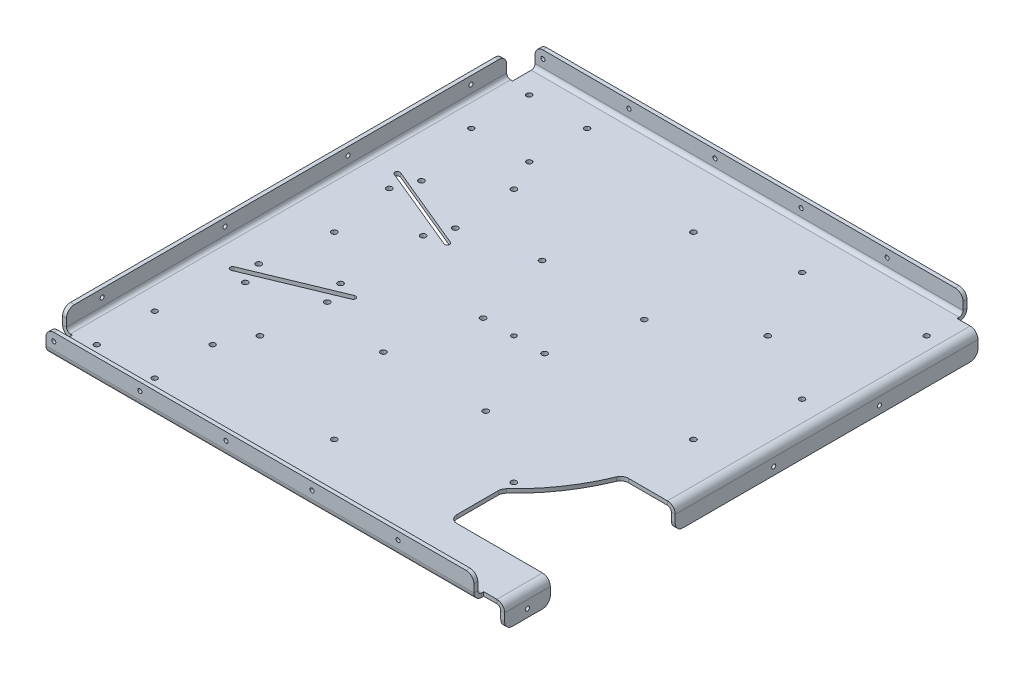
ISO-10303-21;
HEADER;
FILE_DESCRIPTION(('STEP AP214'),'2;1');
FILE_NAME('part.step','',(''),(''),'','','');
FILE_SCHEMA(('AUTOMOTIVE_DESIGN { 1 0 10303 214 1 1 1 1 }'));
ENDSEC;
DATA;
#1=APPLICATION_CONTEXT('core data for automotive mechanical design processes');
#2=APPLICATION_PROTOCOL_DEFINITION('international standard','automotive_design',2000,#1);
#3=PRODUCT_CONTEXT('',#1,'mechanical');
#4=PRODUCT('Part','Part','',(#3));
#5=PRODUCT_RELATED_PRODUCT_CATEGORY('part','',(#4));
#6=PRODUCT_DEFINITION_FORMATION('','',#4);
#7=PRODUCT_DEFINITION_CONTEXT('part definition',#1,'design');
#8=PRODUCT_DEFINITION('design','',#6,#7);
#9=PRODUCT_DEFINITION_SHAPE('','',#8);
#10=(LENGTH_UNIT() NAMED_UNIT(*) SI_UNIT(.MILLI.,.METRE.));
#11=(NAMED_UNIT(*) PLANE_ANGLE_UNIT() SI_UNIT($,.RADIAN.));
#12=(NAMED_UNIT(*) SI_UNIT($,.STERADIAN.) SOLID_ANGLE_UNIT());
#13=UNCERTAINTY_MEASURE_WITH_UNIT(LENGTH_MEASURE(1.E-05),#10,'distance_accuracy_value','');
#14=(GEOMETRIC_REPRESENTATION_CONTEXT(3) GLOBAL_UNCERTAINTY_ASSIGNED_CONTEXT((#13)) GLOBAL_UNIT_ASSIGNED_CONTEXT((#10,
#11,#12)) REPRESENTATION_CONTEXT('',''));
#15=CARTESIAN_POINT('',(0.,0.,0.));
#16=DIRECTION('',(0.,0.,1.));
#17=DIRECTION('',(1.,0.,0.));
#18=AXIS2_PLACEMENT_3D('',#15,#16,#17);
#19=CARTESIAN_POINT('',(0.,-3.175,0.));
#20=DIRECTION('',(0.,1.,0.));
#21=DIRECTION('',(0.,0.,1.));
#22=AXIS2_PLACEMENT_3D('',#19,#20,#21);
#23=PLANE('',#22);
#24=CARTESIAN_POINT('',(347.843609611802,-3.175,-368.3436095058));
#25=DIRECTION('',(0.,1.,0.));
#26=DIRECTION('',(0.,0.,1.));
#27=AXIS2_PLACEMENT_3D('',#24,#25,#26);
#28=CIRCLE('',#27,2.14999999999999);
#29=CARTESIAN_POINT('',(347.843609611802,-3.175,-366.1936095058));
#30=VERTEX_POINT('',#29);
#31=EDGE_CURVE('E2646',#30,#30,#28,.T.);
#32=ORIENTED_EDGE('',*,*,#31,.T.);
#33=EDGE_LOOP('',(#32));
#34=FACE_BOUND('',#33,.T.);
#35=CARTESIAN_POINT('',(252.593609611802,-3.175,-362.3436095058));
#36=DIRECTION('',(0.,1.,0.));
#37=DIRECTION('',(0.,0.,1.));
#38=AXIS2_PLACEMENT_3D('',#35,#36,#37);
#39=CIRCLE('',#38,2.14999999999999);
#40=CARTESIAN_POINT('',(252.593609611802,-3.175,-360.1936095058));
#41=VERTEX_POINT('',#40);
#42=EDGE_CURVE('E2651',#41,#41,#39,.T.);
#43=ORIENTED_EDGE('',*,*,#42,.T.);
#44=EDGE_LOOP('',(#43));
#45=FACE_BOUND('',#44,.T.);
#46=CARTESIAN_POINT('',(341.843609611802,-3.175,-273.0936095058));
#47=DIRECTION('',(0.,1.,0.));
#48=DIRECTION('',(0.,0.,1.));
#49=AXIS2_PLACEMENT_3D('',#46,#47,#48);
#50=CIRCLE('',#49,2.14999999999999);
#51=CARTESIAN_POINT('',(341.843609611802,-3.175,-270.9436095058));
#52=VERTEX_POINT('',#51);
#53=EDGE_CURVE('E2657',#52,#52,#50,.T.);
#54=ORIENTED_EDGE('',*,*,#53,.T.);
#55=EDGE_LOOP('',(#54));
#56=FACE_BOUND('',#55,.T.);
#57=CARTESIAN_POINT('',(16.6038118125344,-3.175,-329.253811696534));
#58=DIRECTION('',(0.,1.,0.));
#59=DIRECTION('',(0.,0.,1.));
#60=AXIS2_PLACEMENT_3D('',#57,#58,#59);
#61=CIRCLE('',#60,2.14999999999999);
#62=CARTESIAN_POINT('',(16.6038118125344,-3.175,-327.103811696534));
#63=VERTEX_POINT('',#62);
#64=EDGE_CURVE('E2663',#63,#63,#61,.T.);
#65=ORIENTED_EDGE('',*,*,#64,.T.);
#66=EDGE_LOOP('',(#65));
#67=FACE_BOUND('',#66,.T.);
#68=CARTESIAN_POINT('',(16.6038118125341,-3.175,-376.396188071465));
#69=DIRECTION('',(0.,1.,0.));
#70=DIRECTION('',(0.,0.,1.));
#71=AXIS2_PLACEMENT_3D('',#68,#69,#70);
#72=CIRCLE('',#71,2.14999999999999);
#73=CARTESIAN_POINT('',(16.6038118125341,-3.175,-374.246188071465));
#74=VERTEX_POINT('',#73);
#75=EDGE_CURVE('E2669',#74,#74,#72,.T.);
#76=ORIENTED_EDGE('',*,*,#75,.T.);
#77=EDGE_LOOP('',(#76));
#78=FACE_BOUND('',#77,.T.);
#79=CARTESIAN_POINT('',(63.7461881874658,-3.175,-329.253811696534));
#80=DIRECTION('',(0.,1.,0.));
#81=DIRECTION('',(0.,0.,1.));
#82=AXIS2_PLACEMENT_3D('',#79,#80,#81);
#83=CIRCLE('',#82,2.14999999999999);
#84=CARTESIAN_POINT('',(63.7461881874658,-3.175,-327.103811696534));
#85=VERTEX_POINT('',#84);
#86=EDGE_CURVE('E2675',#85,#85,#83,.T.);
#87=ORIENTED_EDGE('',*,*,#86,.T.);
#88=EDGE_LOOP('',(#87));
#89=FACE_BOUND('',#88,.T.);
#90=CARTESIAN_POINT('',(63.7461881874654,-3.175,-376.396188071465));
#91=DIRECTION('',(0.,1.,0.));
#92=DIRECTION('',(0.,0.,1.));
#93=AXIS2_PLACEMENT_3D('',#90,#91,#92);
#94=CIRCLE('',#93,2.14999999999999);
#95=CARTESIAN_POINT('',(63.7461881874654,-3.175,-374.246188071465));
#96=VERTEX_POINT('',#95);
#97=EDGE_CURVE('E2681',#96,#96,#94,.T.);
#98=ORIENTED_EDGE('',*,*,#97,.T.);
#99=EDGE_LOOP('',(#98));
#100=FACE_BOUND('',#99,.T.);
#101=CARTESIAN_POINT('',(16.6038308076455,-3.175,-71.7462071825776));
#102=DIRECTION('',(0.,1.,0.));
#103=DIRECTION('',(0.,0.,1.));
#104=AXIS2_PLACEMENT_3D('',#101,#102,#103);
#105=CIRCLE('',#104,2.14999999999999);
#106=CARTESIAN_POINT('',(16.6038308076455,-3.175,-69.5962071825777));
#107=VERTEX_POINT('',#106);
#108=EDGE_CURVE('E2687',#107,#107,#105,.T.);
#109=ORIENTED_EDGE('',*,*,#108,.T.);
#110=EDGE_LOOP('',(#109));
#111=FACE_BOUND('',#110,.T.);
#112=CARTESIAN_POINT('',(63.7462071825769,-3.175,-71.7462074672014));
#113=DIRECTION('',(0.,1.,0.));
#114=DIRECTION('',(0.,0.,1.));
#115=AXIS2_PLACEMENT_3D('',#112,#113,#114);
#116=CIRCLE('',#115,2.14999999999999);
#117=CARTESIAN_POINT('',(63.7462071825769,-3.175,-69.5962074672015));
#118=VERTEX_POINT('',#117);
#119=EDGE_CURVE('E2693',#118,#118,#116,.T.);
#120=ORIENTED_EDGE('',*,*,#119,.T.);
#121=EDGE_LOOP('',(#120));
#122=FACE_BOUND('',#121,.T.);
#123=CARTESIAN_POINT('',(16.6038310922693,-3.175,-24.6038308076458));
#124=DIRECTION('',(0.,1.,0.));
#125=DIRECTION('',(0.,0.,1.));
#126=AXIS2_PLACEMENT_3D('',#123,#124,#125);
#127=CIRCLE('',#126,2.14999999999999);
#128=CARTESIAN_POINT('',(16.6038310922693,-3.175,-22.4538308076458));
#129=VERTEX_POINT('',#128);
#130=EDGE_CURVE('E2699',#129,#129,#127,.T.);
#131=ORIENTED_EDGE('',*,*,#130,.T.);
#132=EDGE_LOOP('',(#131));
#133=FACE_BOUND('',#132,.T.);
#134=CARTESIAN_POINT('',(63.7462074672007,-3.175,-24.6038310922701));
#135=DIRECTION('',(0.,1.,0.));
#136=DIRECTION('',(0.,0.,1.));
#137=AXIS2_PLACEMENT_3D('',#134,#135,#136);
#138=CIRCLE('',#137,2.14999999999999);
#139=CARTESIAN_POINT('',(63.7462074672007,-3.175,-22.4538310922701));
#140=VERTEX_POINT('',#139);
#141=EDGE_CURVE('E2705',#140,#140,#138,.T.);
#142=ORIENTED_EDGE('',*,*,#141,.T.);
#143=EDGE_LOOP('',(#142));
#144=FACE_BOUND('',#143,.T.);
#145=CARTESIAN_POINT('',(25.5808019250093,-3.175,-253.638604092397));
#146=DIRECTION('',(0.,1.,0.));
#147=DIRECTION('',(0.,0.,1.));
#148=AXIS2_PLACEMENT_3D('',#145,#146,#147);
#149=CIRCLE('',#148,2.24999999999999);
#150=CARTESIAN_POINT('',(25.5808019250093,-3.175,-251.388604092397));
#151=VERTEX_POINT('',#150);
#152=EDGE_CURVE('E2711',#151,#151,#149,.T.);
#153=ORIENTED_EDGE('',*,*,#152,.T.);
#154=EDGE_LOOP('',(#153));
#155=FACE_BOUND('',#154,.T.);
#156=CARTESIAN_POINT('',(33.2344705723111,-3.175,-272.116194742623));
#157=DIRECTION('',(0.,1.,0.));
#158=DIRECTION('',(0.,0.,1.));
#159=AXIS2_PLACEMENT_3D('',#156,#157,#158);
#160=CIRCLE('',#159,2.25);
#161=CARTESIAN_POINT('',(33.2344705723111,-3.175,-269.866194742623));
#162=VERTEX_POINT('',#161);
#163=EDGE_CURVE('E2717',#162,#162,#160,.T.);
#164=ORIENTED_EDGE('',*,*,#163,.T.);
#165=EDGE_LOOP('',(#164));
#166=FACE_BOUND('',#165,.T.);
#167=CARTESIAN_POINT('',(80.3523267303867,-3.175,-252.599339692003));
#168=DIRECTION('',(0.,1.,0.));
#169=DIRECTION('',(0.,0.,1.));
#170=AXIS2_PLACEMENT_3D('',#167,#168,#169);
#171=CIRCLE('',#170,2.25);
#172=CARTESIAN_POINT('',(80.3523267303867,-3.175,-250.349339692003));
#173=VERTEX_POINT('',#172);
#174=EDGE_CURVE('E2723',#173,#173,#171,.T.);
#175=ORIENTED_EDGE('',*,*,#174,.T.);
#176=EDGE_LOOP('',(#175));
#177=FACE_BOUND('',#176,.T.);
#178=CARTESIAN_POINT('',(72.6986580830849,-3.175,-234.121749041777));
#179=DIRECTION('',(0.,1.,0.));
#180=DIRECTION('',(0.,0.,1.));
#181=AXIS2_PLACEMENT_3D('',#178,#179,#180);
#182=CIRCLE('',#181,2.25);
#183=CARTESIAN_POINT('',(72.6986580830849,-3.175,-231.871749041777));
#184=VERTEX_POINT('',#183);
#185=EDGE_CURVE('E2729',#184,#184,#182,.T.);
#186=ORIENTED_EDGE('',*,*,#185,.T.);
#187=EDGE_LOOP('',(#186));
#188=FACE_BOUND('',#187,.T.);
#189=CARTESIAN_POINT('',(80.3523267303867,-3.175,-148.400660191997));
#190=DIRECTION('',(0.,1.,0.));
#191=DIRECTION('',(0.,0.,1.));
#192=AXIS2_PLACEMENT_3D('',#189,#190,#191);
#193=CIRCLE('',#192,2.25);
#194=CARTESIAN_POINT('',(80.3523267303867,-3.175,-146.150660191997));
#195=VERTEX_POINT('',#194);
#196=EDGE_CURVE('E2735',#195,#195,#193,.T.);
#197=ORIENTED_EDGE('',*,*,#196,.T.);
#198=EDGE_LOOP('',(#197));
#199=FACE_BOUND('',#198,.T.);
#200=CARTESIAN_POINT('',(72.6986580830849,-3.175,-166.878250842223));
#201=DIRECTION('',(0.,1.,0.));
#202=DIRECTION('',(0.,0.,1.));
#203=AXIS2_PLACEMENT_3D('',#200,#201,#202);
#204=CIRCLE('',#203,2.25);
#205=CARTESIAN_POINT('',(72.6986580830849,-3.175,-164.628250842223));
#206=VERTEX_POINT('',#205);
#207=EDGE_CURVE('E2741',#206,#206,#204,.T.);
#208=ORIENTED_EDGE('',*,*,#207,.T.);
#209=EDGE_LOOP('',(#208));
#210=FACE_BOUND('',#209,.T.);
#211=CARTESIAN_POINT('',(25.5808019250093,-3.175,-147.361395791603));
#212=DIRECTION('',(0.,1.,0.));
#213=DIRECTION('',(0.,0.,1.));
#214=AXIS2_PLACEMENT_3D('',#211,#212,#213);
#215=CIRCLE('',#214,2.24999999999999);
#216=CARTESIAN_POINT('',(25.5808019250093,-3.175,-145.111395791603));
#217=VERTEX_POINT('',#216);
#218=EDGE_CURVE('E2747',#217,#217,#215,.T.);
#219=ORIENTED_EDGE('',*,*,#218,.T.);
#220=EDGE_LOOP('',(#219));
#221=FACE_BOUND('',#220,.T.);
#222=CARTESIAN_POINT('',(33.2344705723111,-3.175,-128.883805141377));
#223=DIRECTION('',(0.,1.,0.));
#224=DIRECTION('',(0.,0.,1.));
#225=AXIS2_PLACEMENT_3D('',#222,#223,#224);
#226=CIRCLE('',#225,2.25);
#227=CARTESIAN_POINT('',(33.2344705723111,-3.175,-126.633805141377));
#228=VERTEX_POINT('',#227);
#229=EDGE_CURVE('E539',#228,#228,#226,.T.);
#230=ORIENTED_EDGE('',*,*,#229,.T.);
#231=EDGE_LOOP('',(#230));
#232=FACE_BOUND('',#231,.T.);
#233=DIRECTION('',(-0.923879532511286,0.,-0.382683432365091));
#234=VECTOR('',#233,1.);
#235=CARTESIAN_POINT('',(86.846679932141,-3.175,-236.920584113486));
#236=LINE('',#235,#234);
#237=CARTESIAN_POINT('',(86.846679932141,-3.175,-236.920584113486));
#238=VERTEX_POINT('',#237);
#239=CARTESIAN_POINT('',(17.5557149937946,-3.175,-265.621841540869));
#240=VERTEX_POINT('',#239);
#241=EDGE_CURVE('E545',#238,#240,#236,.T.);
#242=ORIENTED_EDGE('',*,*,#241,.F.);
#243=CARTESIAN_POINT('',(87.6120467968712,-3.175,-238.768343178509));
#244=DIRECTION('',(0.,-1.,0.));
#245=DIRECTION('',(0.,0.,-1.));
#246=AXIS2_PLACEMENT_3D('',#243,#244,#245);
#247=CIRCLE('',#246,2.00000000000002);
#248=CARTESIAN_POINT('',(88.3774136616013,-3.175,-240.616102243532));
#249=VERTEX_POINT('',#248);
#250=EDGE_CURVE('E162',#249,#238,#247,.T.);
#251=ORIENTED_EDGE('',*,*,#250,.F.);
#252=DIRECTION('',(0.923879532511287,0.,0.38268343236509));
#253=VECTOR('',#252,1.);
#254=CARTESIAN_POINT('',(88.3774136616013,-3.175,-240.616102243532));
#255=LINE('',#254,#253);
#256=CARTESIAN_POINT('',(19.0864487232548,-3.175,-269.317359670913));
#257=VERTEX_POINT('',#256);
#258=EDGE_CURVE('E533',#257,#249,#255,.T.);
#259=ORIENTED_EDGE('',*,*,#258,.F.);
#260=CARTESIAN_POINT('',(18.3210818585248,-3.175,-267.469600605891));
#261=DIRECTION('',(0.,-1.,0.));
#262=DIRECTION('',(0.,0.,-1.));
#263=AXIS2_PLACEMENT_3D('',#260,#261,#262);
#264=CIRCLE('',#263,1.99999999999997);
#265=EDGE_CURVE('E536',#240,#257,#264,.T.);
#266=ORIENTED_EDGE('',*,*,#265,.F.);
#267=EDGE_LOOP('',(#242,#251,#259,#266));
#268=FACE_BOUND('',#267,.T.);
#269=DIRECTION('',(-0.923879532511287,0.,0.38268343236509));
#270=VECTOR('',#269,1.);
#271=CARTESIAN_POINT('',(88.3774136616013,-3.175,-160.383897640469));
#272=LINE('',#271,#270);
#273=CARTESIAN_POINT('',(88.3774136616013,-3.175,-160.383897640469));
#274=VERTEX_POINT('',#273);
#275=CARTESIAN_POINT('',(19.0864487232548,-3.175,-131.682640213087));
#276=VERTEX_POINT('',#275);
#277=EDGE_CURVE('E571',#274,#276,#272,.T.);
#278=ORIENTED_EDGE('',*,*,#277,.F.);
#279=CARTESIAN_POINT('',(87.6120467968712,-3.175,-162.231656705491));
#280=DIRECTION('',(0.,-1.,0.));
#281=DIRECTION('',(0.,0.,1.));
#282=AXIS2_PLACEMENT_3D('',#279,#280,#281);
#283=CIRCLE('',#282,2.00000000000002);
#284=CARTESIAN_POINT('',(86.846679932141,-3.175,-164.079415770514));
#285=VERTEX_POINT('',#284);
#286=EDGE_CURVE('E170',#285,#274,#283,.T.);
#287=ORIENTED_EDGE('',*,*,#286,.F.);
#288=DIRECTION('',(0.923879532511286,0.,-0.382683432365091));
#289=VECTOR('',#288,1.);
#290=CARTESIAN_POINT('',(86.846679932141,-3.175,-164.079415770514));
#291=LINE('',#290,#289);
#292=CARTESIAN_POINT('',(17.5557149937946,-3.175,-135.378158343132));
#293=VERTEX_POINT('',#292);
#294=EDGE_CURVE('E564',#293,#285,#291,.T.);
#295=ORIENTED_EDGE('',*,*,#294,.F.);
#296=CARTESIAN_POINT('',(18.3210818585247,-3.175,-133.530399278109));
#297=DIRECTION('',(0.,-1.,0.));
#298=DIRECTION('',(0.,0.,1.));
#299=AXIS2_PLACEMENT_3D('',#296,#297,#298);
#300=CIRCLE('',#299,1.99999999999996);
#301=EDGE_CURVE('E567',#276,#293,#300,.T.);
#302=ORIENTED_EDGE('',*,*,#301,.F.);
#303=EDGE_LOOP('',(#278,#287,#295,#302));
#304=FACE_BOUND('',#303,.T.);
#305=CARTESIAN_POINT('',(283.272945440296,-3.175,-97.227054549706));
#306=DIRECTION('',(0.,1.,0.));
#307=DIRECTION('',(0.,0.,1.));
#308=AXIS2_PLACEMENT_3D('',#305,#306,#307);
#309=CIRCLE('',#308,2.24999999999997);
#310=CARTESIAN_POINT('',(283.272945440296,-3.175,-94.977054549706));
#311=VERTEX_POINT('',#310);
#312=EDGE_CURVE('E587',#311,#311,#309,.T.);
#313=ORIENTED_EDGE('',*,*,#312,.T.);
#314=EDGE_LOOP('',(#313));
#315=FACE_BOUND('',#314,.T.);
#316=CARTESIAN_POINT('',(180.000000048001,-3.175,-54.449999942));
#317=DIRECTION('',(0.,1.,0.));
#318=DIRECTION('',(0.,0.,1.));
#319=AXIS2_PLACEMENT_3D('',#316,#317,#318);
#320=CIRCLE('',#319,2.25);
#321=CARTESIAN_POINT('',(180.000000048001,-3.175,-52.199999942));
#322=VERTEX_POINT('',#321);
#323=EDGE_CURVE('E593',#322,#322,#320,.T.);
#324=ORIENTED_EDGE('',*,*,#323,.T.);
#325=EDGE_LOOP('',(#324));
#326=FACE_BOUND('',#325,.T.);
#327=CARTESIAN_POINT('',(76.7270546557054,-3.175,-97.2270545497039));
#328=DIRECTION('',(0.,1.,0.));
#329=DIRECTION('',(0.,0.,1.));
#330=AXIS2_PLACEMENT_3D('',#327,#328,#329);
#331=CIRCLE('',#330,2.25);
#332=CARTESIAN_POINT('',(76.7270546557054,-3.175,-94.9770545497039));
#333=VERTEX_POINT('',#332);
#334=EDGE_CURVE('E599',#333,#333,#331,.T.);
#335=ORIENTED_EDGE('',*,*,#334,.T.);
#336=EDGE_LOOP('',(#335));
#337=FACE_BOUND('',#336,.T.);
#338=CARTESIAN_POINT('',(33.9500000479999,-3.175,-200.499999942));
#339=DIRECTION('',(0.,1.,0.));
#340=DIRECTION('',(0.,0.,1.));
#341=AXIS2_PLACEMENT_3D('',#338,#339,#340);
#342=CIRCLE('',#341,2.25);
#343=CARTESIAN_POINT('',(33.9500000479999,-3.175,-198.249999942));
#344=VERTEX_POINT('',#343);
#345=EDGE_CURVE('E605',#344,#344,#342,.T.);
#346=ORIENTED_EDGE('',*,*,#345,.T.);
#347=EDGE_LOOP('',(#346));
#348=FACE_BOUND('',#347,.T.);
#349=CARTESIAN_POINT('',(76.7270546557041,-3.175,-303.772945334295));
#350=DIRECTION('',(0.,1.,0.));
#351=DIRECTION('',(0.,0.,1.));
#352=AXIS2_PLACEMENT_3D('',#349,#350,#351);
#353=CIRCLE('',#352,2.25);
#354=CARTESIAN_POINT('',(76.7270546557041,-3.175,-301.522945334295));
#355=VERTEX_POINT('',#354);
#356=EDGE_CURVE('E611',#355,#355,#353,.T.);
#357=ORIENTED_EDGE('',*,*,#356,.T.);
#358=EDGE_LOOP('',(#357));
#359=FACE_BOUND('',#358,.T.);
#360=CARTESIAN_POINT('',(180.000000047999,-3.175,-346.549999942));
#361=DIRECTION('',(0.,1.,0.));
#362=DIRECTION('',(0.,0.,1.));
#363=AXIS2_PLACEMENT_3D('',#360,#361,#362);
#364=CIRCLE('',#363,2.25);
#365=CARTESIAN_POINT('',(180.000000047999,-3.175,-344.299999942));
#366=VERTEX_POINT('',#365);
#367=EDGE_CURVE('E617',#366,#366,#364,.T.);
#368=ORIENTED_EDGE('',*,*,#367,.T.);
#369=EDGE_LOOP('',(#368));
#370=FACE_BOUND('',#369,.T.);
#371=CARTESIAN_POINT('',(283.272945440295,-3.175,-303.772945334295));
#372=DIRECTION('',(0.,1.,0.));
#373=DIRECTION('',(0.,0.,1.));
#374=AXIS2_PLACEMENT_3D('',#371,#372,#373);
#375=CIRCLE('',#374,2.24999999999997);
#376=CARTESIAN_POINT('',(283.272945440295,-3.175,-301.522945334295));
#377=VERTEX_POINT('',#376);
#378=EDGE_CURVE('E623',#377,#377,#375,.T.);
#379=ORIENTED_EDGE('',*,*,#378,.T.);
#380=EDGE_LOOP('',(#379));
#381=FACE_BOUND('',#380,.T.);
#382=CARTESIAN_POINT('',(326.050000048,-3.175,-200.499999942));
#383=DIRECTION('',(0.,1.,0.));
#384=DIRECTION('',(0.,0.,1.));
#385=AXIS2_PLACEMENT_3D('',#382,#383,#384);
#386=CIRCLE('',#385,2.24999999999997);
#387=CARTESIAN_POINT('',(326.050000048,-3.175,-198.249999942));
#388=VERTEX_POINT('',#387);
#389=EDGE_CURVE('E629',#388,#388,#386,.T.);
#390=ORIENTED_EDGE('',*,*,#389,.T.);
#391=EDGE_LOOP('',(#390));
#392=FACE_BOUND('',#391,.T.);
#393=CARTESIAN_POINT('',(180.000000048,-3.175,-200.499999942));
#394=DIRECTION('',(0.,1.,0.));
#395=DIRECTION('',(0.,0.,1.));
#396=AXIS2_PLACEMENT_3D('',#393,#394,#395);
#397=CIRCLE('',#396,2.);
#398=CARTESIAN_POINT('',(180.000000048,-3.175,-198.499999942));
#399=VERTEX_POINT('',#398);
#400=EDGE_CURVE('E839',#399,#399,#397,.T.);
#401=ORIENTED_EDGE('',*,*,#400,.T.);
#402=EDGE_LOOP('',(#401));
#403=FACE_BOUND('',#402,.T.);
#404=DIRECTION('',(0.,0.,1.));
#405=VECTOR('',#404,1.);
#406=CARTESIAN_POINT('',(358.690000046,-3.17499999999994,-146.737092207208));
#407=LINE('',#406,#405);
#408=CARTESIAN_POINT('',(358.690000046,-3.17499999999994,-146.737092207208));
#409=VERTEX_POINT('',#408);
#410=CARTESIAN_POINT('',(358.690000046,-3.17499999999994,-392.999999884));
#411=VERTEX_POINT('',#410);
#412=EDGE_CURVE('E691',#409,#411,#407,.F.);
#413=ORIENTED_EDGE('',*,*,#412,.F.);
#414=DIRECTION('',(-1.,0.,0.));
#415=VECTOR('',#414,1.);
#416=CARTESIAN_POINT('',(365.040000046,-3.175,-146.737092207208));
#417=LINE('',#416,#415);
#418=CARTESIAN_POINT('',(326.928556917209,-3.175,-146.737092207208));
#419=VERTEX_POINT('',#418);
#420=EDGE_CURVE('E851',#409,#419,#417,.T.);
#421=ORIENTED_EDGE('',*,*,#420,.T.);
#422=CARTESIAN_POINT('',(326.928556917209,-3.175,-140.387092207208));
#423=DIRECTION('',(0.,1.,0.));
#424=DIRECTION('',(0.,0.,1.));
#425=AXIS2_PLACEMENT_3D('',#422,#423,#424);
#426=CIRCLE('',#425,6.35);
#427=CARTESIAN_POINT('',(321.05141464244,-3.175,-142.7916085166));
#428=VERTEX_POINT('',#427);
#429=EDGE_CURVE('E1119',#419,#428,#426,.T.);
#430=ORIENTED_EDGE('',*,*,#429,.T.);
#431=CARTESIAN_POINT('',(180.000000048,-3.175,-200.499999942));
#432=DIRECTION('',(0.,-1.,0.));
#433=DIRECTION('',(0.,0.,1.));
#434=AXIS2_PLACEMENT_3D('',#431,#432,#433);
#435=CIRCLE('',#434,152.4);
#436=CARTESIAN_POINT('',(284.741402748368,-3.175,-89.797702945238));
#437=VERTEX_POINT('',#436);
#438=EDGE_CURVE('E863',#428,#437,#435,.T.);
#439=ORIENTED_EDGE('',*,*,#438,.T.);
#440=CARTESIAN_POINT('',(289.105627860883,-3.175,-85.1851072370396));
#441=DIRECTION('',(0.,1.,0.));
#442=DIRECTION('',(0.,0.,1.));
#443=AXIS2_PLACEMENT_3D('',#440,#441,#442);
#444=CIRCLE('',#443,6.35);
#445=CARTESIAN_POINT('',(282.755627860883,-3.175,-85.1851072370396));
#446=VERTEX_POINT('',#445);
#447=EDGE_CURVE('E1123',#437,#446,#444,.T.);
#448=ORIENTED_EDGE('',*,*,#447,.T.);
#449=DIRECTION('',(0.,0.,1.));
#450=VECTOR('',#449,1.);
#451=CARTESIAN_POINT('',(282.755627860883,-3.175,-87.9520503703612));
#452=LINE('',#451,#450);
#453=CARTESIAN_POINT('',(282.755627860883,-3.175,-51.487092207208));
#454=VERTEX_POINT('',#453);
#455=EDGE_CURVE('E860',#446,#454,#452,.T.);
#456=ORIENTED_EDGE('',*,*,#455,.T.);
#457=CARTESIAN_POINT('',(289.105627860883,-3.175,-51.487092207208));
#458=DIRECTION('',(0.,1.,0.));
#459=DIRECTION('',(0.,0.,1.));
#460=AXIS2_PLACEMENT_3D('',#457,#458,#459);
#461=CIRCLE('',#460,6.35);
#462=CARTESIAN_POINT('',(289.105627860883,-3.175,-45.137092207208));
#463=VERTEX_POINT('',#462);
#464=EDGE_CURVE('E1114',#454,#463,#461,.T.);
#465=ORIENTED_EDGE('',*,*,#464,.T.);
#466=DIRECTION('',(1.,0.,0.));
#467=VECTOR('',#466,1.);
#468=CARTESIAN_POINT('',(282.755627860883,-3.175,-45.137092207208));
#469=LINE('',#468,#467);
#470=CARTESIAN_POINT('',(358.690000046,-3.17499999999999,-45.137092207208));
#471=VERTEX_POINT('',#470);
#472=EDGE_CURVE('E837',#463,#471,#469,.T.);
#473=ORIENTED_EDGE('',*,*,#472,.T.);
#474=DIRECTION('',(0.,0.,1.));
#475=VECTOR('',#474,1.);
#476=CARTESIAN_POINT('',(358.690000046,-3.17499999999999,-8.));
#477=LINE('',#476,#475);
#478=CARTESIAN_POINT('',(358.690000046,-3.17499999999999,-8.));
#479=VERTEX_POINT('',#478);
#480=EDGE_CURVE('E741',#479,#471,#477,.F.);
#481=ORIENTED_EDGE('',*,*,#480,.F.);
#482=DIRECTION('',(-1.,0.,0.));
#483=VECTOR('',#482,1.);
#484=CARTESIAN_POINT('',(365.040000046,-3.175,-8.));
#485=LINE('',#484,#483);
#486=CARTESIAN_POINT('',(348.040000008,-3.175,-8.));
#487=VERTEX_POINT('',#486);
#488=EDGE_CURVE('E1029',#479,#487,#485,.T.);
#489=ORIENTED_EDGE('',*,*,#488,.T.);
#490=DIRECTION('',(0.,0.,1.));
#491=VECTOR('',#490,1.);
#492=CARTESIAN_POINT('',(348.040000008,-3.175,0.));
#493=LINE('',#492,#491);
#494=CARTESIAN_POINT('',(348.040000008,-3.17500000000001,-6.35));
#495=VERTEX_POINT('',#494);
#496=EDGE_CURVE('E1031',#487,#495,#493,.T.);
#497=ORIENTED_EDGE('',*,*,#496,.T.);
#498=DIRECTION('',(1.,0.,0.));
#499=VECTOR('',#498,1.);
#500=CARTESIAN_POINT('',(348.040000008,-3.17500000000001,-6.35));
#501=LINE('',#500,#499);
#502=CARTESIAN_POINT('',(0.,-3.175,-6.35000000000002));
#503=VERTEX_POINT('',#502);
#504=EDGE_CURVE('E1005',#495,#503,#501,.F.);
#505=ORIENTED_EDGE('',*,*,#504,.T.);
#506=DIRECTION('',(0.,0.,1.));
#507=VECTOR('',#506,1.);
#508=CARTESIAN_POINT('',(-1.31838984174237E-13,-3.175,-400.999999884));
#509=LINE('',#508,#507);
#510=CARTESIAN_POINT('',(0.,-3.175,-21.4999999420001));
#511=VERTEX_POINT('',#510);
#512=EDGE_CURVE('E1057',#511,#503,#509,.T.);
#513=ORIENTED_EDGE('',*,*,#512,.F.);
#514=DIRECTION('',(1.,0.,0.));
#515=VECTOR('',#514,1.);
#516=CARTESIAN_POINT('',(-1.65000000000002,-3.17500000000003,-21.4999999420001));
#517=LINE('',#516,#515);
#518=CARTESIAN_POINT('',(-1.65000000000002,-3.17500000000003,-21.4999999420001));
#519=VERTEX_POINT('',#518);
#520=EDGE_CURVE('E833',#519,#511,#517,.T.);
#521=ORIENTED_EDGE('',*,*,#520,.F.);
#522=DIRECTION('',(0.,0.,1.));
#523=VECTOR('',#522,1.);
#524=CARTESIAN_POINT('',(-1.65000000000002,-3.17500000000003,-21.4999999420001));
#525=LINE('',#524,#523);
#526=CARTESIAN_POINT('',(-1.65000000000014,-3.1750000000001,-379.499999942));
#527=VERTEX_POINT('',#526);
#528=EDGE_CURVE('E802',#519,#527,#525,.F.);
#529=ORIENTED_EDGE('',*,*,#528,.T.);
#530=DIRECTION('',(1.,0.,0.));
#531=VECTOR('',#530,1.);
#532=CARTESIAN_POINT('',(-1.65000000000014,-3.1750000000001,-379.499999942));
#533=LINE('',#532,#531);
#534=CARTESIAN_POINT('',(-1.29646676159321E-13,-3.1750000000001,-379.499999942));
#535=VERTEX_POINT('',#534);
#536=EDGE_CURVE('E831',#527,#535,#533,.T.);
#537=ORIENTED_EDGE('',*,*,#536,.T.);
#538=CARTESIAN_POINT('',(0.,-3.17500000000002,-394.649999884));
#539=VERTEX_POINT('',#538);
#540=EDGE_CURVE('E1053',#539,#535,#509,.T.);
#541=ORIENTED_EDGE('',*,*,#540,.F.);
#542=DIRECTION('',(-1.,0.,0.));
#543=VECTOR('',#542,1.);
#544=CARTESIAN_POINT('',(-1.11022302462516E-13,-3.17500000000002,-394.649999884));
#545=LINE('',#544,#543);
#546=CARTESIAN_POINT('',(348.040000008,-3.175,-394.649999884));
#547=VERTEX_POINT('',#546);
#548=EDGE_CURVE('E954',#539,#547,#545,.F.);
#549=ORIENTED_EDGE('',*,*,#548,.T.);
#550=DIRECTION('',(0.,0.,1.));
#551=VECTOR('',#550,1.);
#552=CARTESIAN_POINT('',(348.040000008,-3.175,-400.999999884));
#553=LINE('',#552,#551);
#554=CARTESIAN_POINT('',(348.040000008,-3.175,-392.999999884));
#555=VERTEX_POINT('',#554);
#556=EDGE_CURVE('E1048',#547,#555,#553,.T.);
#557=ORIENTED_EDGE('',*,*,#556,.T.);
#558=DIRECTION('',(1.,0.,0.));
#559=VECTOR('',#558,1.);
#560=CARTESIAN_POINT('',(365.040000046,-3.175,-392.999999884));
#561=LINE('',#560,#559);
#562=EDGE_CURVE('E1044',#555,#411,#561,.T.);
#563=ORIENTED_EDGE('',*,*,#562,.T.);
#564=EDGE_LOOP('',(#413,#421,#430,#439,#448,#456,#465,#473,#481,#489,#497,#505,#513,#521,#529,
#537,#541,#549,#557,#563));
#565=FACE_BOUND('',#564,.T.);
#566=CARTESIAN_POINT('',(221.569219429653,-3.175,-135.999999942));
#567=DIRECTION('',(0.,-1.,0.));
#568=DIRECTION('',(0.,0.,-1.));
#569=AXIS2_PLACEMENT_3D('',#566,#567,#568);
#570=CIRCLE('',#569,2.25);
#571=CARTESIAN_POINT('',(221.569219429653,-3.175,-138.249999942));
#572=VERTEX_POINT('',#571);
#573=EDGE_CURVE('E2637',#572,#572,#570,.T.);
#574=ORIENTED_EDGE('',*,*,#573,.F.);
#575=EDGE_LOOP('',(#574));
#576=FACE_BOUND('',#575,.T.);
#577=CARTESIAN_POINT('',(138.430780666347,-3.175,-135.999999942));
#578=DIRECTION('',(0.,-1.,0.));
#579=DIRECTION('',(0.,0.,-1.));
#580=AXIS2_PLACEMENT_3D('',#577,#578,#579);
#581=CIRCLE('',#580,2.25);
#582=CARTESIAN_POINT('',(138.430780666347,-3.175,-138.249999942));
#583=VERTEX_POINT('',#582);
#584=EDGE_CURVE('E2631',#583,#583,#581,.T.);
#585=ORIENTED_EDGE('',*,*,#584,.F.);
#586=EDGE_LOOP('',(#585));
#587=FACE_BOUND('',#586,.T.);
#588=CARTESIAN_POINT('',(155.000000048,-3.175,-200.499999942));
#589=DIRECTION('',(0.,-1.,0.));
#590=DIRECTION('',(0.,0.,-1.));
#591=AXIS2_PLACEMENT_3D('',#588,#589,#590);
#592=CIRCLE('',#591,2.25);
#593=CARTESIAN_POINT('',(155.000000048,-3.175,-202.749999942));
#594=VERTEX_POINT('',#593);
#595=EDGE_CURVE('E2625',#594,#594,#592,.T.);
#596=ORIENTED_EDGE('',*,*,#595,.F.);
#597=EDGE_LOOP('',(#596));
#598=FACE_BOUND('',#597,.T.);
#599=CARTESIAN_POINT('',(205.000000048,-3.175,-200.499999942));
#600=DIRECTION('',(0.,-1.,0.));
#601=DIRECTION('',(0.,0.,-1.));
#602=AXIS2_PLACEMENT_3D('',#599,#600,#601);
#603=CIRCLE('',#602,2.25);
#604=CARTESIAN_POINT('',(205.000000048,-3.175,-202.749999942));
#605=VERTEX_POINT('',#604);
#606=EDGE_CURVE('E2619',#605,#605,#603,.T.);
#607=ORIENTED_EDGE('',*,*,#606,.F.);
#608=EDGE_LOOP('',(#607));
#609=FACE_BOUND('',#608,.T.);
#610=CARTESIAN_POINT('',(221.569219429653,-3.175,-264.999999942));
#611=DIRECTION('',(0.,-1.,0.));
#612=DIRECTION('',(0.,0.,-1.));
#613=AXIS2_PLACEMENT_3D('',#610,#611,#612);
#614=CIRCLE('',#613,2.25);
#615=CARTESIAN_POINT('',(221.569219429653,-3.175,-267.249999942));
#616=VERTEX_POINT('',#615);
#617=EDGE_CURVE('E2610',#616,#616,#614,.T.);
#618=ORIENTED_EDGE('',*,*,#617,.F.);
#619=EDGE_LOOP('',(#618));
#620=FACE_BOUND('',#619,.T.);
#621=CARTESIAN_POINT('',(138.430780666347,-3.175,-264.999999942));
#622=DIRECTION('',(0.,-1.,0.));
#623=DIRECTION('',(0.,0.,-1.));
#624=AXIS2_PLACEMENT_3D('',#621,#622,#623);
#625=CIRCLE('',#624,2.25);
#626=CARTESIAN_POINT('',(138.430780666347,-3.175,-267.249999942));
#627=VERTEX_POINT('',#626);
#628=EDGE_CURVE('E2606',#627,#627,#625,.T.);
#629=ORIENTED_EDGE('',*,*,#628,.F.);
#630=EDGE_LOOP('',(#629));
#631=FACE_BOUND('',#630,.T.);
#632=ADVANCED_FACE('F147',(#34,#45,#56,#67,#78,#89,#100,#111,#122,#133,#144,#155,#166,#177,#188,
#199,#210,#221,#232,#268,#304,#315,#326,#337,#348,#359,#370,#381,#392,#403,#565,#576,#587,#598,
#609,#620,#631),#23,.F.);
#633=CARTESIAN_POINT('',(365.040000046,1.2875447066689E-12,0.));
#634=DIRECTION('',(-1.,0.,0.));
#635=DIRECTION('',(0.,-1.,0.));
#636=AXIS2_PLACEMENT_3D('',#633,#634,#635);
#637=PLANE('',#636);
#638=DIRECTION('',(0.,-1.,0.));
#639=VECTOR('',#638,1.);
#640=CARTESIAN_POINT('',(365.040000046,-19.05,-8.));
#641=LINE('',#640,#639);
#642=CARTESIAN_POINT('',(365.040000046,-12.7,-8.));
#643=VERTEX_POINT('',#642);
#644=CARTESIAN_POINT('',(365.040000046,-6.34999999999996,-8.));
#645=VERTEX_POINT('',#644);
#646=EDGE_CURVE('E701',#643,#645,#641,.F.);
#647=ORIENTED_EDGE('',*,*,#646,.F.);
#648=CARTESIAN_POINT('',(365.040000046,-12.7,-14.35));
#649=DIRECTION('',(-1.,0.,0.));
#650=DIRECTION('',(0.,-1.,0.));
#651=AXIS2_PLACEMENT_3D('',#648,#649,#650);
#652=CIRCLE('',#651,6.35);
#653=CARTESIAN_POINT('',(365.040000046,-19.05,-14.35));
#654=VERTEX_POINT('',#653);
#655=EDGE_CURVE('E155',#643,#654,#652,.F.);
#656=ORIENTED_EDGE('',*,*,#655,.T.);
#657=DIRECTION('',(0.,0.,-1.));
#658=VECTOR('',#657,1.);
#659=CARTESIAN_POINT('',(365.040000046,-19.05,-45.137092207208));
#660=LINE('',#659,#658);
#661=CARTESIAN_POINT('',(365.040000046,-19.05,-38.787092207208));
#662=VERTEX_POINT('',#661);
#663=EDGE_CURVE('E704',#662,#654,#660,.F.);
#664=ORIENTED_EDGE('',*,*,#663,.F.);
#665=CARTESIAN_POINT('',(365.040000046,-12.7,-38.787092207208));
#666=DIRECTION('',(-1.,0.,0.));
#667=DIRECTION('',(0.,-1.,0.));
#668=AXIS2_PLACEMENT_3D('',#665,#666,#667);
#669=CIRCLE('',#668,6.35);
#670=CARTESIAN_POINT('',(365.040000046,-12.7,-45.137092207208));
#671=VERTEX_POINT('',#670);
#672=EDGE_CURVE('E1172',#662,#671,#669,.F.);
#673=ORIENTED_EDGE('',*,*,#672,.T.);
#674=DIRECTION('',(0.,1.,0.));
#675=VECTOR('',#674,1.);
#676=CARTESIAN_POINT('',(365.040000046,-3.17499999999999,-45.137092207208));
#677=LINE('',#676,#675);
#678=CARTESIAN_POINT('',(365.040000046,-6.34999999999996,-45.137092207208));
#679=VERTEX_POINT('',#678);
#680=EDGE_CURVE('E707',#679,#671,#677,.F.);
#681=ORIENTED_EDGE('',*,*,#680,.F.);
#682=DIRECTION('',(0.,0.,1.));
#683=VECTOR('',#682,1.);
#684=CARTESIAN_POINT('',(365.040000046,-6.34999999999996,-45.137092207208));
#685=LINE('',#684,#683);
#686=EDGE_CURVE('E718',#645,#679,#685,.F.);
#687=ORIENTED_EDGE('',*,*,#686,.F.);
#688=EDGE_LOOP('',(#647,#656,#664,#673,#681,#687));
#689=FACE_BOUND('',#688,.T.);
#690=CARTESIAN_POINT('',(365.040000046,-12.7,-26.568546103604));
#691=DIRECTION('',(1.,0.,0.));
#692=DIRECTION('',(0.,0.,-1.));
#693=AXIS2_PLACEMENT_3D('',#690,#691,#692);
#694=CIRCLE('',#693,1.64999999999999);
#695=CARTESIAN_POINT('',(365.040000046,-12.7,-28.218546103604));
#696=VERTEX_POINT('',#695);
#697=EDGE_CURVE('E632',#696,#696,#694,.T.);
#698=ORIENTED_EDGE('',*,*,#697,.F.);
#699=EDGE_LOOP('',(#698));
#700=FACE_BOUND('',#699,.T.);
#701=ADVANCED_FACE('F1177',(#689,#700),#637,.F.);
#702=CARTESIAN_POINT('',(365.040000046,1.2875447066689E-12,0.));
#703=DIRECTION('',(-1.,0.,0.));
#704=DIRECTION('',(0.,-1.,0.));
#705=AXIS2_PLACEMENT_3D('',#702,#703,#704);
#706=PLANE('',#705);
#707=DIRECTION('',(0.,-1.,0.));
#708=VECTOR('',#707,1.);
#709=CARTESIAN_POINT('',(365.040000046,-19.05,-146.737092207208));
#710=LINE('',#709,#708);
#711=CARTESIAN_POINT('',(365.040000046,-12.7,-146.737092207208));
#712=VERTEX_POINT('',#711);
#713=CARTESIAN_POINT('',(365.040000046,-6.34999999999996,-146.737092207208));
#714=VERTEX_POINT('',#713);
#715=EDGE_CURVE('E651',#712,#714,#710,.F.);
#716=ORIENTED_EDGE('',*,*,#715,.F.);
#717=CARTESIAN_POINT('',(365.040000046,-12.7,-153.087092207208));
#718=DIRECTION('',(-1.,0.,0.));
#719=DIRECTION('',(0.,-1.,0.));
#720=AXIS2_PLACEMENT_3D('',#717,#718,#719);
#721=CIRCLE('',#720,6.35);
#722=CARTESIAN_POINT('',(365.040000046,-19.05,-153.087092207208));
#723=VERTEX_POINT('',#722);
#724=EDGE_CURVE('E1156',#712,#723,#721,.F.);
#725=ORIENTED_EDGE('',*,*,#724,.T.);
#726=DIRECTION('',(0.,0.,-1.));
#727=VECTOR('',#726,1.);
#728=CARTESIAN_POINT('',(365.040000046,-19.05,-392.999999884));
#729=LINE('',#728,#727);
#730=CARTESIAN_POINT('',(365.040000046,-19.05,-386.649999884));
#731=VERTEX_POINT('',#730);
#732=EDGE_CURVE('E654',#731,#723,#729,.F.);
#733=ORIENTED_EDGE('',*,*,#732,.F.);
#734=CARTESIAN_POINT('',(365.040000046,-12.7,-386.649999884));
#735=DIRECTION('',(-1.,0.,0.));
#736=DIRECTION('',(0.,-1.,0.));
#737=AXIS2_PLACEMENT_3D('',#734,#735,#736);
#738=CIRCLE('',#737,6.35);
#739=CARTESIAN_POINT('',(365.040000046,-12.7,-392.999999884));
#740=VERTEX_POINT('',#739);
#741=EDGE_CURVE('E1154',#731,#740,#738,.F.);
#742=ORIENTED_EDGE('',*,*,#741,.T.);
#743=DIRECTION('',(0.,1.,0.));
#744=VECTOR('',#743,1.);
#745=CARTESIAN_POINT('',(365.040000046,-3.17499999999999,-392.999999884));
#746=LINE('',#745,#744);
#747=CARTESIAN_POINT('',(365.040000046,-6.34999999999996,-392.999999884));
#748=VERTEX_POINT('',#747);
#749=EDGE_CURVE('E657',#748,#740,#746,.F.);
#750=ORIENTED_EDGE('',*,*,#749,.F.);
#751=DIRECTION('',(0.,0.,1.));
#752=VECTOR('',#751,1.);
#753=CARTESIAN_POINT('',(365.040000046,-6.34999999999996,-392.999999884));
#754=LINE('',#753,#752);
#755=EDGE_CURVE('E668',#714,#748,#754,.F.);
#756=ORIENTED_EDGE('',*,*,#755,.F.);
#757=EDGE_LOOP('',(#716,#725,#733,#742,#750,#756));
#758=FACE_BOUND('',#757,.T.);
#759=CARTESIAN_POINT('',(365.040000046,-12.7,-226.868546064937));
#760=DIRECTION('',(1.,0.,0.));
#761=DIRECTION('',(0.,0.,-1.));
#762=AXIS2_PLACEMENT_3D('',#759,#760,#761);
#763=CIRCLE('',#762,1.64999999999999);
#764=CARTESIAN_POINT('',(365.040000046,-12.7,-228.518546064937));
#765=VERTEX_POINT('',#764);
#766=EDGE_CURVE('E644',#765,#765,#763,.T.);
#767=ORIENTED_EDGE('',*,*,#766,.F.);
#768=EDGE_LOOP('',(#767));
#769=FACE_BOUND('',#768,.T.);
#770=CARTESIAN_POINT('',(365.040000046,-12.7,-312.868546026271));
#771=DIRECTION('',(1.,0.,0.));
#772=DIRECTION('',(0.,0.,-1.));
#773=AXIS2_PLACEMENT_3D('',#770,#771,#772);
#774=CIRCLE('',#773,1.64999999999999);
#775=CARTESIAN_POINT('',(365.040000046,-12.7,-314.518546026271));
#776=VERTEX_POINT('',#775);
#777=EDGE_CURVE('E638',#776,#776,#774,.T.);
#778=ORIENTED_EDGE('',*,*,#777,.F.);
#779=EDGE_LOOP('',(#778));
#780=FACE_BOUND('',#779,.T.);
#781=ADVANCED_FACE('F1310',(#758,#769,#780),#706,.F.);
#782=CARTESIAN_POINT('',(0.,0.,0.));
#783=DIRECTION('',(0.,1.,0.));
#784=DIRECTION('',(0.,0.,1.));
#785=AXIS2_PLACEMENT_3D('',#782,#783,#784);
#786=PLANE('',#785);
#787=CARTESIAN_POINT('',(138.430780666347,0.,-264.999999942));
#788=DIRECTION('',(0.,1.,0.));
#789=DIRECTION('',(0.,0.,1.));
#790=AXIS2_PLACEMENT_3D('',#787,#788,#789);
#791=CIRCLE('',#790,2.25);
#792=CARTESIAN_POINT('',(138.430780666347,0.,-262.749999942));
#793=VERTEX_POINT('',#792);
#794=EDGE_CURVE('E2609',#793,#793,#791,.T.);
#795=ORIENTED_EDGE('',*,*,#794,.F.);
#796=EDGE_LOOP('',(#795));
#797=FACE_BOUND('',#796,.T.);
#798=CARTESIAN_POINT('',(221.569219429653,0.,-264.999999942));
#799=DIRECTION('',(0.,1.,0.));
#800=DIRECTION('',(0.,0.,1.));
#801=AXIS2_PLACEMENT_3D('',#798,#799,#800);
#802=CIRCLE('',#801,2.25);
#803=CARTESIAN_POINT('',(221.569219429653,0.,-262.749999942));
#804=VERTEX_POINT('',#803);
#805=EDGE_CURVE('E2613',#804,#804,#802,.T.);
#806=ORIENTED_EDGE('',*,*,#805,.F.);
#807=EDGE_LOOP('',(#806));
#808=FACE_BOUND('',#807,.T.);
#809=CARTESIAN_POINT('',(205.000000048,0.,-200.499999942));
#810=DIRECTION('',(0.,1.,0.));
#811=DIRECTION('',(0.,0.,1.));
#812=AXIS2_PLACEMENT_3D('',#809,#810,#811);
#813=CIRCLE('',#812,2.25);
#814=CARTESIAN_POINT('',(205.000000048,0.,-198.249999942));
#815=VERTEX_POINT('',#814);
#816=EDGE_CURVE('E2622',#815,#815,#813,.T.);
#817=ORIENTED_EDGE('',*,*,#816,.F.);
#818=EDGE_LOOP('',(#817));
#819=FACE_BOUND('',#818,.T.);
#820=CARTESIAN_POINT('',(155.000000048,0.,-200.499999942));
#821=DIRECTION('',(0.,1.,0.));
#822=DIRECTION('',(0.,0.,1.));
#823=AXIS2_PLACEMENT_3D('',#820,#821,#822);
#824=CIRCLE('',#823,2.25);
#825=CARTESIAN_POINT('',(155.000000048,0.,-198.249999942));
#826=VERTEX_POINT('',#825);
#827=EDGE_CURVE('E2628',#826,#826,#824,.T.);
#828=ORIENTED_EDGE('',*,*,#827,.F.);
#829=EDGE_LOOP('',(#828));
#830=FACE_BOUND('',#829,.T.);
#831=CARTESIAN_POINT('',(138.430780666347,0.,-135.999999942));
#832=DIRECTION('',(0.,1.,0.));
#833=DIRECTION('',(0.,0.,1.));
#834=AXIS2_PLACEMENT_3D('',#831,#832,#833);
#835=CIRCLE('',#834,2.25);
#836=CARTESIAN_POINT('',(138.430780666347,0.,-133.749999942));
#837=VERTEX_POINT('',#836);
#838=EDGE_CURVE('E2634',#837,#837,#835,.T.);
#839=ORIENTED_EDGE('',*,*,#838,.F.);
#840=EDGE_LOOP('',(#839));
#841=FACE_BOUND('',#840,.T.);
#842=CARTESIAN_POINT('',(221.569219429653,0.,-135.999999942));
#843=DIRECTION('',(0.,1.,0.));
#844=DIRECTION('',(0.,0.,1.));
#845=AXIS2_PLACEMENT_3D('',#842,#843,#844);
#846=CIRCLE('',#845,2.25);
#847=CARTESIAN_POINT('',(221.569219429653,0.,-133.749999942));
#848=VERTEX_POINT('',#847);
#849=EDGE_CURVE('E2640',#848,#848,#846,.T.);
#850=ORIENTED_EDGE('',*,*,#849,.F.);
#851=EDGE_LOOP('',(#850));
#852=FACE_BOUND('',#851,.T.);
#853=CARTESIAN_POINT('',(347.843609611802,0.,-368.3436095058));
#854=DIRECTION('',(0.,1.,0.));
#855=DIRECTION('',(0.,0.,1.));
#856=AXIS2_PLACEMENT_3D('',#853,#854,#855);
#857=CIRCLE('',#856,2.14999999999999);
#858=CARTESIAN_POINT('',(347.843609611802,0.,-366.1936095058));
#859=VERTEX_POINT('',#858);
#860=EDGE_CURVE('E2643',#859,#859,#857,.T.);
#861=ORIENTED_EDGE('',*,*,#860,.F.);
#862=EDGE_LOOP('',(#861));
#863=FACE_BOUND('',#862,.T.);
#864=CARTESIAN_POINT('',(252.593609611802,0.,-362.3436095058));
#865=DIRECTION('',(0.,1.,0.));
#866=DIRECTION('',(0.,0.,1.));
#867=AXIS2_PLACEMENT_3D('',#864,#865,#866);
#868=CIRCLE('',#867,2.14999999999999);
#869=CARTESIAN_POINT('',(252.593609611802,0.,-360.1936095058));
#870=VERTEX_POINT('',#869);
#871=EDGE_CURVE('E2648',#870,#870,#868,.T.);
#872=ORIENTED_EDGE('',*,*,#871,.F.);
#873=EDGE_LOOP('',(#872));
#874=FACE_BOUND('',#873,.T.);
#875=CARTESIAN_POINT('',(341.843609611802,0.,-273.0936095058));
#876=DIRECTION('',(0.,1.,0.));
#877=DIRECTION('',(0.,0.,1.));
#878=AXIS2_PLACEMENT_3D('',#875,#876,#877);
#879=CIRCLE('',#878,2.14999999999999);
#880=CARTESIAN_POINT('',(341.843609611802,0.,-270.9436095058));
#881=VERTEX_POINT('',#880);
#882=EDGE_CURVE('E2654',#881,#881,#879,.T.);
#883=ORIENTED_EDGE('',*,*,#882,.F.);
#884=EDGE_LOOP('',(#883));
#885=FACE_BOUND('',#884,.T.);
#886=CARTESIAN_POINT('',(16.6038118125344,0.,-329.253811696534));
#887=DIRECTION('',(0.,1.,0.));
#888=DIRECTION('',(0.,0.,1.));
#889=AXIS2_PLACEMENT_3D('',#886,#887,#888);
#890=CIRCLE('',#889,2.14999999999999);
#891=CARTESIAN_POINT('',(16.6038118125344,0.,-327.103811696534));
#892=VERTEX_POINT('',#891);
#893=EDGE_CURVE('E2660',#892,#892,#890,.T.);
#894=ORIENTED_EDGE('',*,*,#893,.F.);
#895=EDGE_LOOP('',(#894));
#896=FACE_BOUND('',#895,.T.);
#897=CARTESIAN_POINT('',(16.6038118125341,0.,-376.396188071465));
#898=DIRECTION('',(0.,1.,0.));
#899=DIRECTION('',(0.,0.,1.));
#900=AXIS2_PLACEMENT_3D('',#897,#898,#899);
#901=CIRCLE('',#900,2.14999999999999);
#902=CARTESIAN_POINT('',(16.6038118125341,0.,-374.246188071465));
#903=VERTEX_POINT('',#902);
#904=EDGE_CURVE('E2666',#903,#903,#901,.T.);
#905=ORIENTED_EDGE('',*,*,#904,.F.);
#906=EDGE_LOOP('',(#905));
#907=FACE_BOUND('',#906,.T.);
#908=CARTESIAN_POINT('',(63.7461881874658,0.,-329.253811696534));
#909=DIRECTION('',(0.,1.,0.));
#910=DIRECTION('',(0.,0.,1.));
#911=AXIS2_PLACEMENT_3D('',#908,#909,#910);
#912=CIRCLE('',#911,2.14999999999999);
#913=CARTESIAN_POINT('',(63.7461881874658,0.,-327.103811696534));
#914=VERTEX_POINT('',#913);
#915=EDGE_CURVE('E2672',#914,#914,#912,.T.);
#916=ORIENTED_EDGE('',*,*,#915,.F.);
#917=EDGE_LOOP('',(#916));
#918=FACE_BOUND('',#917,.T.);
#919=CARTESIAN_POINT('',(63.7461881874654,0.,-376.396188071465));
#920=DIRECTION('',(0.,1.,0.));
#921=DIRECTION('',(0.,0.,1.));
#922=AXIS2_PLACEMENT_3D('',#919,#920,#921);
#923=CIRCLE('',#922,2.14999999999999);
#924=CARTESIAN_POINT('',(63.7461881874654,0.,-374.246188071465));
#925=VERTEX_POINT('',#924);
#926=EDGE_CURVE('E2678',#925,#925,#923,.T.);
#927=ORIENTED_EDGE('',*,*,#926,.F.);
#928=EDGE_LOOP('',(#927));
#929=FACE_BOUND('',#928,.T.);
#930=CARTESIAN_POINT('',(16.6038308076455,0.,-71.7462071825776));
#931=DIRECTION('',(0.,1.,0.));
#932=DIRECTION('',(0.,0.,1.));
#933=AXIS2_PLACEMENT_3D('',#930,#931,#932);
#934=CIRCLE('',#933,2.14999999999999);
#935=CARTESIAN_POINT('',(16.6038308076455,0.,-69.5962071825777));
#936=VERTEX_POINT('',#935);
#937=EDGE_CURVE('E2684',#936,#936,#934,.T.);
#938=ORIENTED_EDGE('',*,*,#937,.F.);
#939=EDGE_LOOP('',(#938));
#940=FACE_BOUND('',#939,.T.);
#941=CARTESIAN_POINT('',(63.7462071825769,0.,-71.7462074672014));
#942=DIRECTION('',(0.,1.,0.));
#943=DIRECTION('',(0.,0.,1.));
#944=AXIS2_PLACEMENT_3D('',#941,#942,#943);
#945=CIRCLE('',#944,2.14999999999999);
#946=CARTESIAN_POINT('',(63.7462071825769,0.,-69.5962074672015));
#947=VERTEX_POINT('',#946);
#948=EDGE_CURVE('E2690',#947,#947,#945,.T.);
#949=ORIENTED_EDGE('',*,*,#948,.F.);
#950=EDGE_LOOP('',(#949));
#951=FACE_BOUND('',#950,.T.);
#952=CARTESIAN_POINT('',(16.6038310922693,0.,-24.6038308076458));
#953=DIRECTION('',(0.,1.,0.));
#954=DIRECTION('',(0.,0.,1.));
#955=AXIS2_PLACEMENT_3D('',#952,#953,#954);
#956=CIRCLE('',#955,2.14999999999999);
#957=CARTESIAN_POINT('',(16.6038310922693,0.,-22.4538308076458));
#958=VERTEX_POINT('',#957);
#959=EDGE_CURVE('E2696',#958,#958,#956,.T.);
#960=ORIENTED_EDGE('',*,*,#959,.F.);
#961=EDGE_LOOP('',(#960));
#962=FACE_BOUND('',#961,.T.);
#963=CARTESIAN_POINT('',(63.7462074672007,0.,-24.6038310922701));
#964=DIRECTION('',(0.,1.,0.));
#965=DIRECTION('',(0.,0.,1.));
#966=AXIS2_PLACEMENT_3D('',#963,#964,#965);
#967=CIRCLE('',#966,2.14999999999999);
#968=CARTESIAN_POINT('',(63.7462074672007,0.,-22.4538310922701));
#969=VERTEX_POINT('',#968);
#970=EDGE_CURVE('E2702',#969,#969,#967,.T.);
#971=ORIENTED_EDGE('',*,*,#970,.F.);
#972=EDGE_LOOP('',(#971));
#973=FACE_BOUND('',#972,.T.);
#974=CARTESIAN_POINT('',(25.5808019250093,0.,-253.638604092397));
#975=DIRECTION('',(0.,1.,0.));
#976=DIRECTION('',(0.,0.,1.));
#977=AXIS2_PLACEMENT_3D('',#974,#975,#976);
#978=CIRCLE('',#977,2.24999999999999);
#979=CARTESIAN_POINT('',(25.5808019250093,0.,-251.388604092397));
#980=VERTEX_POINT('',#979);
#981=EDGE_CURVE('E2708',#980,#980,#978,.T.);
#982=ORIENTED_EDGE('',*,*,#981,.F.);
#983=EDGE_LOOP('',(#982));
#984=FACE_BOUND('',#983,.T.);
#985=CARTESIAN_POINT('',(33.2344705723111,0.,-272.116194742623));
#986=DIRECTION('',(0.,1.,0.));
#987=DIRECTION('',(0.,0.,1.));
#988=AXIS2_PLACEMENT_3D('',#985,#986,#987);
#989=CIRCLE('',#988,2.24999999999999);
#990=CARTESIAN_POINT('',(33.2344705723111,0.,-269.866194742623));
#991=VERTEX_POINT('',#990);
#992=EDGE_CURVE('E2714',#991,#991,#989,.T.);
#993=ORIENTED_EDGE('',*,*,#992,.F.);
#994=EDGE_LOOP('',(#993));
#995=FACE_BOUND('',#994,.T.);
#996=CARTESIAN_POINT('',(80.3523267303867,0.,-252.599339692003));
#997=DIRECTION('',(0.,1.,0.));
#998=DIRECTION('',(0.,0.,1.));
#999=AXIS2_PLACEMENT_3D('',#996,#997,#998);
#1000=CIRCLE('',#999,2.24999999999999);
#1001=CARTESIAN_POINT('',(80.3523267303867,0.,-250.349339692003));
#1002=VERTEX_POINT('',#1001);
#1003=EDGE_CURVE('E2720',#1002,#1002,#1000,.T.);
#1004=ORIENTED_EDGE('',*,*,#1003,.F.);
#1005=EDGE_LOOP('',(#1004));
#1006=FACE_BOUND('',#1005,.T.);
#1007=CARTESIAN_POINT('',(72.6986580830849,0.,-234.121749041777));
#1008=DIRECTION('',(0.,1.,0.));
#1009=DIRECTION('',(0.,0.,1.));
#1010=AXIS2_PLACEMENT_3D('',#1007,#1008,#1009);
#1011=CIRCLE('',#1010,2.24999999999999);
#1012=CARTESIAN_POINT('',(72.6986580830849,0.,-231.871749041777));
#1013=VERTEX_POINT('',#1012);
#1014=EDGE_CURVE('E2726',#1013,#1013,#1011,.T.);
#1015=ORIENTED_EDGE('',*,*,#1014,.F.);
#1016=EDGE_LOOP('',(#1015));
#1017=FACE_BOUND('',#1016,.T.);
#1018=CARTESIAN_POINT('',(80.3523267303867,0.,-148.400660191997));
#1019=DIRECTION('',(0.,1.,0.));
#1020=DIRECTION('',(0.,0.,1.));
#1021=AXIS2_PLACEMENT_3D('',#1018,#1019,#1020);
#1022=CIRCLE('',#1021,2.24999999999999);
#1023=CARTESIAN_POINT('',(80.3523267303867,0.,-146.150660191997));
#1024=VERTEX_POINT('',#1023);
#1025=EDGE_CURVE('E2732',#1024,#1024,#1022,.T.);
#1026=ORIENTED_EDGE('',*,*,#1025,.F.);
#1027=EDGE_LOOP('',(#1026));
#1028=FACE_BOUND('',#1027,.T.);
#1029=CARTESIAN_POINT('',(72.6986580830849,0.,-166.878250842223));
#1030=DIRECTION('',(0.,1.,0.));
#1031=DIRECTION('',(0.,0.,1.));
#1032=AXIS2_PLACEMENT_3D('',#1029,#1030,#1031);
#1033=CIRCLE('',#1032,2.24999999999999);
#1034=CARTESIAN_POINT('',(72.6986580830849,0.,-164.628250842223));
#1035=VERTEX_POINT('',#1034);
#1036=EDGE_CURVE('E2738',#1035,#1035,#1033,.T.);
#1037=ORIENTED_EDGE('',*,*,#1036,.F.);
#1038=EDGE_LOOP('',(#1037));
#1039=FACE_BOUND('',#1038,.T.);
#1040=CARTESIAN_POINT('',(25.5808019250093,0.,-147.361395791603));
#1041=DIRECTION('',(0.,1.,0.));
#1042=DIRECTION('',(0.,0.,1.));
#1043=AXIS2_PLACEMENT_3D('',#1040,#1041,#1042);
#1044=CIRCLE('',#1043,2.24999999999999);
#1045=CARTESIAN_POINT('',(25.5808019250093,0.,-145.111395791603));
#1046=VERTEX_POINT('',#1045);
#1047=EDGE_CURVE('E2744',#1046,#1046,#1044,.T.);
#1048=ORIENTED_EDGE('',*,*,#1047,.F.);
#1049=EDGE_LOOP('',(#1048));
#1050=FACE_BOUND('',#1049,.T.);
#1051=CARTESIAN_POINT('',(33.2344705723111,0.,-128.883805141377));
#1052=DIRECTION('',(0.,1.,0.));
#1053=DIRECTION('',(0.,0.,1.));
#1054=AXIS2_PLACEMENT_3D('',#1051,#1052,#1053);
#1055=CIRCLE('',#1054,2.24999999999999);
#1056=CARTESIAN_POINT('',(33.2344705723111,0.,-126.633805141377));
#1057=VERTEX_POINT('',#1056);
#1058=EDGE_CURVE('E2749',#1057,#1057,#1055,.T.);
#1059=ORIENTED_EDGE('',*,*,#1058,.F.);
#1060=EDGE_LOOP('',(#1059));
#1061=FACE_BOUND('',#1060,.T.);
#1062=CARTESIAN_POINT('',(87.6120467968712,0.,-238.768343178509));
#1063=DIRECTION('',(0.,-1.,0.));
#1064=DIRECTION('',(0.,0.,-1.));
#1065=AXIS2_PLACEMENT_3D('',#1062,#1063,#1064);
#1066=CIRCLE('',#1065,2.00000000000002);
#1067=CARTESIAN_POINT('',(88.3774136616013,0.,-240.616102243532));
#1068=VERTEX_POINT('',#1067);
#1069=CARTESIAN_POINT('',(86.846679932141,0.,-236.920584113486));
#1070=VERTEX_POINT('',#1069);
#1071=EDGE_CURVE('E514',#1068,#1070,#1066,.T.);
#1072=ORIENTED_EDGE('',*,*,#1071,.T.);
#1073=DIRECTION('',(-0.923879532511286,0.,-0.382683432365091));
#1074=VECTOR('',#1073,1.);
#1075=CARTESIAN_POINT('',(86.846679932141,0.,-236.920584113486));
#1076=LINE('',#1075,#1074);
#1077=CARTESIAN_POINT('',(17.5557149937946,0.,-265.621841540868));
#1078=VERTEX_POINT('',#1077);
#1079=EDGE_CURVE('E524',#1070,#1078,#1076,.T.);
#1080=ORIENTED_EDGE('',*,*,#1079,.T.);
#1081=CARTESIAN_POINT('',(18.3210818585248,0.,-267.469600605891));
#1082=DIRECTION('',(0.,-1.,0.));
#1083=DIRECTION('',(0.,0.,-1.));
#1084=AXIS2_PLACEMENT_3D('',#1081,#1082,#1083);
#1085=CIRCLE('',#1084,1.99999999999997);
#1086=CARTESIAN_POINT('',(19.0864487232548,0.,-269.317359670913));
#1087=VERTEX_POINT('',#1086);
#1088=EDGE_CURVE('E528',#1078,#1087,#1085,.T.);
#1089=ORIENTED_EDGE('',*,*,#1088,.T.);
#1090=DIRECTION('',(0.923879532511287,0.,0.38268343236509));
#1091=VECTOR('',#1090,1.);
#1092=CARTESIAN_POINT('',(88.3774136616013,0.,-240.616102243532));
#1093=LINE('',#1092,#1091);
#1094=EDGE_CURVE('E520',#1087,#1068,#1093,.T.);
#1095=ORIENTED_EDGE('',*,*,#1094,.T.);
#1096=EDGE_LOOP('',(#1072,#1080,#1089,#1095));
#1097=FACE_BOUND('',#1096,.T.);
#1098=CARTESIAN_POINT('',(87.6120467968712,0.,-162.231656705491));
#1099=DIRECTION('',(0.,-1.,0.));
#1100=DIRECTION('',(0.,0.,1.));
#1101=AXIS2_PLACEMENT_3D('',#1098,#1099,#1100);
#1102=CIRCLE('',#1101,2.00000000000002);
#1103=CARTESIAN_POINT('',(86.846679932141,0.,-164.079415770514));
#1104=VERTEX_POINT('',#1103);
#1105=CARTESIAN_POINT('',(88.3774136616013,0.,-160.383897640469));
#1106=VERTEX_POINT('',#1105);
#1107=EDGE_CURVE('E568',#1104,#1106,#1102,.T.);
#1108=ORIENTED_EDGE('',*,*,#1107,.T.);
#1109=DIRECTION('',(-0.923879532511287,0.,0.38268343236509));
#1110=VECTOR('',#1109,1.);
#1111=CARTESIAN_POINT('',(88.3774136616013,0.,-160.383897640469));
#1112=LINE('',#1111,#1110);
#1113=CARTESIAN_POINT('',(19.0864487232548,0.,-131.682640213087));
#1114=VERTEX_POINT('',#1113);
#1115=EDGE_CURVE('E580',#1106,#1114,#1112,.T.);
#1116=ORIENTED_EDGE('',*,*,#1115,.T.);
#1117=CARTESIAN_POINT('',(18.3210818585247,0.,-133.530399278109));
#1118=DIRECTION('',(0.,-1.,0.));
#1119=DIRECTION('',(0.,0.,1.));
#1120=AXIS2_PLACEMENT_3D('',#1117,#1118,#1119);
#1121=CIRCLE('',#1120,1.99999999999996);
#1122=CARTESIAN_POINT('',(17.5557149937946,0.,-135.378158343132));
#1123=VERTEX_POINT('',#1122);
#1124=EDGE_CURVE('E577',#1114,#1123,#1121,.T.);
#1125=ORIENTED_EDGE('',*,*,#1124,.T.);
#1126=DIRECTION('',(0.923879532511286,0.,-0.382683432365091));
#1127=VECTOR('',#1126,1.);
#1128=CARTESIAN_POINT('',(86.846679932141,0.,-164.079415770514));
#1129=LINE('',#1128,#1127);
#1130=EDGE_CURVE('E557',#1123,#1104,#1129,.T.);
#1131=ORIENTED_EDGE('',*,*,#1130,.T.);
#1132=EDGE_LOOP('',(#1108,#1116,#1125,#1131));
#1133=FACE_BOUND('',#1132,.T.);
#1134=CARTESIAN_POINT('',(283.272945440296,0.,-97.227054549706));
#1135=DIRECTION('',(0.,1.,0.));
#1136=DIRECTION('',(0.,0.,1.));
#1137=AXIS2_PLACEMENT_3D('',#1134,#1135,#1136);
#1138=CIRCLE('',#1137,2.24999999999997);
#1139=CARTESIAN_POINT('',(283.272945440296,0.,-94.977054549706));
#1140=VERTEX_POINT('',#1139);
#1141=EDGE_CURVE('E551',#1140,#1140,#1138,.T.);
#1142=ORIENTED_EDGE('',*,*,#1141,.F.);
#1143=EDGE_LOOP('',(#1142));
#1144=FACE_BOUND('',#1143,.T.);
#1145=CARTESIAN_POINT('',(180.000000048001,0.,-54.449999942));
#1146=DIRECTION('',(0.,1.,0.));
#1147=DIRECTION('',(0.,0.,1.));
#1148=AXIS2_PLACEMENT_3D('',#1145,#1146,#1147);
#1149=CIRCLE('',#1148,2.25);
#1150=CARTESIAN_POINT('',(180.000000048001,0.,-52.199999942));
#1151=VERTEX_POINT('',#1150);
#1152=EDGE_CURVE('E590',#1151,#1151,#1149,.T.);
#1153=ORIENTED_EDGE('',*,*,#1152,.F.);
#1154=EDGE_LOOP('',(#1153));
#1155=FACE_BOUND('',#1154,.T.);
#1156=CARTESIAN_POINT('',(76.7270546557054,0.,-97.2270545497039));
#1157=DIRECTION('',(0.,1.,0.));
#1158=DIRECTION('',(0.,0.,1.));
#1159=AXIS2_PLACEMENT_3D('',#1156,#1157,#1158);
#1160=CIRCLE('',#1159,2.25);
#1161=CARTESIAN_POINT('',(76.7270546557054,0.,-94.9770545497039));
#1162=VERTEX_POINT('',#1161);
#1163=EDGE_CURVE('E596',#1162,#1162,#1160,.T.);
#1164=ORIENTED_EDGE('',*,*,#1163,.F.);
#1165=EDGE_LOOP('',(#1164));
#1166=FACE_BOUND('',#1165,.T.);
#1167=CARTESIAN_POINT('',(33.9500000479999,0.,-200.499999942));
#1168=DIRECTION('',(0.,1.,0.));
#1169=DIRECTION('',(0.,0.,1.));
#1170=AXIS2_PLACEMENT_3D('',#1167,#1168,#1169);
#1171=CIRCLE('',#1170,2.25);
#1172=CARTESIAN_POINT('',(33.9500000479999,0.,-198.249999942));
#1173=VERTEX_POINT('',#1172);
#1174=EDGE_CURVE('E602',#1173,#1173,#1171,.T.);
#1175=ORIENTED_EDGE('',*,*,#1174,.F.);
#1176=EDGE_LOOP('',(#1175));
#1177=FACE_BOUND('',#1176,.T.);
#1178=CARTESIAN_POINT('',(76.7270546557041,0.,-303.772945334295));
#1179=DIRECTION('',(0.,1.,0.));
#1180=DIRECTION('',(0.,0.,1.));
#1181=AXIS2_PLACEMENT_3D('',#1178,#1179,#1180);
#1182=CIRCLE('',#1181,2.25);
#1183=CARTESIAN_POINT('',(76.7270546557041,0.,-301.522945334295));
#1184=VERTEX_POINT('',#1183);
#1185=EDGE_CURVE('E608',#1184,#1184,#1182,.T.);
#1186=ORIENTED_EDGE('',*,*,#1185,.F.);
#1187=EDGE_LOOP('',(#1186));
#1188=FACE_BOUND('',#1187,.T.);
#1189=CARTESIAN_POINT('',(180.000000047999,0.,-346.549999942));
#1190=DIRECTION('',(0.,1.,0.));
#1191=DIRECTION('',(0.,0.,1.));
#1192=AXIS2_PLACEMENT_3D('',#1189,#1190,#1191);
#1193=CIRCLE('',#1192,2.25);
#1194=CARTESIAN_POINT('',(180.000000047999,0.,-344.299999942));
#1195=VERTEX_POINT('',#1194);
#1196=EDGE_CURVE('E614',#1195,#1195,#1193,.T.);
#1197=ORIENTED_EDGE('',*,*,#1196,.F.);
#1198=EDGE_LOOP('',(#1197));
#1199=FACE_BOUND('',#1198,.T.);
#1200=CARTESIAN_POINT('',(283.272945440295,0.,-303.772945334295));
#1201=DIRECTION('',(0.,1.,0.));
#1202=DIRECTION('',(0.,0.,1.));
#1203=AXIS2_PLACEMENT_3D('',#1200,#1201,#1202);
#1204=CIRCLE('',#1203,2.24999999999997);
#1205=CARTESIAN_POINT('',(283.272945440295,0.,-301.522945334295));
#1206=VERTEX_POINT('',#1205);
#1207=EDGE_CURVE('E620',#1206,#1206,#1204,.T.);
#1208=ORIENTED_EDGE('',*,*,#1207,.F.);
#1209=EDGE_LOOP('',(#1208));
#1210=FACE_BOUND('',#1209,.T.);
#1211=CARTESIAN_POINT('',(326.050000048,0.,-200.499999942));
#1212=DIRECTION('',(0.,1.,0.));
#1213=DIRECTION('',(0.,0.,1.));
#1214=AXIS2_PLACEMENT_3D('',#1211,#1212,#1213);
#1215=CIRCLE('',#1214,2.24999999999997);
#1216=CARTESIAN_POINT('',(326.050000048,0.,-198.249999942));
#1217=VERTEX_POINT('',#1216);
#1218=EDGE_CURVE('E626',#1217,#1217,#1215,.T.);
#1219=ORIENTED_EDGE('',*,*,#1218,.F.);
#1220=EDGE_LOOP('',(#1219));
#1221=FACE_BOUND('',#1220,.T.);
#1222=CARTESIAN_POINT('',(180.000000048,0.,-200.499999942));
#1223=DIRECTION('',(0.,1.,0.));
#1224=DIRECTION('',(0.,0.,1.));
#1225=AXIS2_PLACEMENT_3D('',#1222,#1223,#1224);
#1226=CIRCLE('',#1225,2.);
#1227=CARTESIAN_POINT('',(180.000000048,0.,-198.499999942));
#1228=VERTEX_POINT('',#1227);
#1229=EDGE_CURVE('E843',#1228,#1228,#1226,.T.);
#1230=ORIENTED_EDGE('',*,*,#1229,.F.);
#1231=EDGE_LOOP('',(#1230));
#1232=FACE_BOUND('',#1231,.T.);
#1233=DIRECTION('',(-1.,0.,0.));
#1234=VECTOR('',#1233,1.);
#1235=CARTESIAN_POINT('',(365.040000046,0.,-146.737092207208));
#1236=LINE('',#1235,#1234);
#1237=CARTESIAN_POINT('',(358.690000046,0.,-146.737092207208));
#1238=VERTEX_POINT('',#1237);
#1239=CARTESIAN_POINT('',(326.928556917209,0.,-146.737092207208));
#1240=VERTEX_POINT('',#1239);
#1241=EDGE_CURVE('E846',#1238,#1240,#1236,.T.);
#1242=ORIENTED_EDGE('',*,*,#1241,.F.);
#1243=DIRECTION('',(0.,0.,1.));
#1244=VECTOR('',#1243,1.);
#1245=CARTESIAN_POINT('',(358.690000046,0.,-146.737092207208));
#1246=LINE('',#1245,#1244);
#1247=CARTESIAN_POINT('',(358.690000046,0.,-392.999999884));
#1248=VERTEX_POINT('',#1247);
#1249=EDGE_CURVE('E678',#1238,#1248,#1246,.F.);
#1250=ORIENTED_EDGE('',*,*,#1249,.T.);
#1251=DIRECTION('',(1.,0.,0.));
#1252=VECTOR('',#1251,1.);
#1253=CARTESIAN_POINT('',(365.040000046,0.,-392.999999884));
#1254=LINE('',#1253,#1252);
#1255=CARTESIAN_POINT('',(348.040000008,0.,-392.999999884));
#1256=VERTEX_POINT('',#1255);
#1257=EDGE_CURVE('E1045',#1256,#1248,#1254,.T.);
#1258=ORIENTED_EDGE('',*,*,#1257,.F.);
#1259=DIRECTION('',(0.,0.,1.));
#1260=VECTOR('',#1259,1.);
#1261=CARTESIAN_POINT('',(348.040000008,0.,-400.999999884));
#1262=LINE('',#1261,#1260);
#1263=CARTESIAN_POINT('',(348.040000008,0.,-394.649999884));
#1264=VERTEX_POINT('',#1263);
#1265=EDGE_CURVE('E1037',#1264,#1256,#1262,.T.);
#1266=ORIENTED_EDGE('',*,*,#1265,.F.);
#1267=DIRECTION('',(-1.,0.,0.));
#1268=VECTOR('',#1267,1.);
#1269=CARTESIAN_POINT('',(-1.11022302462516E-13,0.,-394.649999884));
#1270=LINE('',#1269,#1268);
#1271=CARTESIAN_POINT('',(-1.29751259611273E-13,0.,-394.649999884));
#1272=VERTEX_POINT('',#1271);
#1273=EDGE_CURVE('E967',#1272,#1264,#1270,.F.);
#1274=ORIENTED_EDGE('',*,*,#1273,.F.);
#1275=DIRECTION('',(0.,0.,1.));
#1276=VECTOR('',#1275,1.);
#1277=CARTESIAN_POINT('',(-1.31838984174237E-13,0.,-400.999999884));
#1278=LINE('',#1277,#1276);
#1279=CARTESIAN_POINT('',(-1.27044590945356E-13,-1.00231502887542E-13,-379.499999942));
#1280=VERTEX_POINT('',#1279);
#1281=EDGE_CURVE('E1058',#1272,#1280,#1278,.T.);
#1282=ORIENTED_EDGE('',*,*,#1281,.T.);
#1283=DIRECTION('',(1.,0.,0.));
#1284=VECTOR('',#1283,1.);
#1285=CARTESIAN_POINT('',(-1.65000000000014,0.,-379.499999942));
#1286=LINE('',#1285,#1284);
#1287=CARTESIAN_POINT('',(-1.65000000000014,0.,-379.499999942));
#1288=VERTEX_POINT('',#1287);
#1289=EDGE_CURVE('E830',#1288,#1280,#1286,.T.);
#1290=ORIENTED_EDGE('',*,*,#1289,.F.);
#1291=DIRECTION('',(0.,0.,1.));
#1292=VECTOR('',#1291,1.);
#1293=CARTESIAN_POINT('',(-1.65000000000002,0.,-21.4999999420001));
#1294=LINE('',#1293,#1292);
#1295=CARTESIAN_POINT('',(-1.65000000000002,0.,-21.4999999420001));
#1296=VERTEX_POINT('',#1295);
#1297=EDGE_CURVE('E815',#1296,#1288,#1294,.F.);
#1298=ORIENTED_EDGE('',*,*,#1297,.F.);
#1299=DIRECTION('',(1.,0.,0.));
#1300=VECTOR('',#1299,1.);
#1301=CARTESIAN_POINT('',(-1.65000000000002,0.,-21.4999999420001));
#1302=LINE('',#1301,#1300);
#1303=CARTESIAN_POINT('',(0.,0.,-21.4999999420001));
#1304=VERTEX_POINT('',#1303);
#1305=EDGE_CURVE('E835',#1296,#1304,#1302,.T.);
#1306=ORIENTED_EDGE('',*,*,#1305,.T.);
#1307=CARTESIAN_POINT('',(0.,0.,-6.35000000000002));
#1308=VERTEX_POINT('',#1307);
#1309=EDGE_CURVE('E1041',#1304,#1308,#1278,.T.);
#1310=ORIENTED_EDGE('',*,*,#1309,.T.);
#1311=DIRECTION('',(1.,0.,0.));
#1312=VECTOR('',#1311,1.);
#1313=CARTESIAN_POINT('',(348.040000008,0.,-6.35));
#1314=LINE('',#1313,#1312);
#1315=CARTESIAN_POINT('',(348.040000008,0.,-6.35));
#1316=VERTEX_POINT('',#1315);
#1317=EDGE_CURVE('E1018',#1316,#1308,#1314,.F.);
#1318=ORIENTED_EDGE('',*,*,#1317,.F.);
#1319=DIRECTION('',(0.,0.,1.));
#1320=VECTOR('',#1319,1.);
#1321=CARTESIAN_POINT('',(348.040000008,0.,0.));
#1322=LINE('',#1321,#1320);
#1323=CARTESIAN_POINT('',(348.040000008,0.,-8.));
#1324=VERTEX_POINT('',#1323);
#1325=EDGE_CURVE('E1032',#1324,#1316,#1322,.T.);
#1326=ORIENTED_EDGE('',*,*,#1325,.F.);
#1327=DIRECTION('',(-1.,0.,0.));
#1328=VECTOR('',#1327,1.);
#1329=CARTESIAN_POINT('',(365.040000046,0.,-8.));
#1330=LINE('',#1329,#1328);
#1331=CARTESIAN_POINT('',(358.690000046,0.,-8.));
#1332=VERTEX_POINT('',#1331);
#1333=EDGE_CURVE('E1035',#1332,#1324,#1330,.T.);
#1334=ORIENTED_EDGE('',*,*,#1333,.F.);
#1335=DIRECTION('',(0.,0.,1.));
#1336=VECTOR('',#1335,1.);
#1337=CARTESIAN_POINT('',(358.690000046,0.,-8.));
#1338=LINE('',#1337,#1336);
#1339=CARTESIAN_POINT('',(358.690000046,0.,-45.137092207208));
#1340=VERTEX_POINT('',#1339);
#1341=EDGE_CURVE('E728',#1332,#1340,#1338,.F.);
#1342=ORIENTED_EDGE('',*,*,#1341,.T.);
#1343=DIRECTION('',(1.,0.,0.));
#1344=VECTOR('',#1343,1.);
#1345=CARTESIAN_POINT('',(352.340000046,0.,-45.137092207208));
#1346=LINE('',#1345,#1344);
#1347=CARTESIAN_POINT('',(289.105627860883,0.,-45.137092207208));
#1348=VERTEX_POINT('',#1347);
#1349=EDGE_CURVE('E847',#1348,#1340,#1346,.T.);
#1350=ORIENTED_EDGE('',*,*,#1349,.F.);
#1351=CARTESIAN_POINT('',(289.105627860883,0.,-51.487092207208));
#1352=DIRECTION('',(0.,1.,0.));
#1353=DIRECTION('',(0.,0.,1.));
#1354=AXIS2_PLACEMENT_3D('',#1351,#1352,#1353);
#1355=CIRCLE('',#1354,6.35);
#1356=CARTESIAN_POINT('',(282.755627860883,0.,-51.487092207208));
#1357=VERTEX_POINT('',#1356);
#1358=EDGE_CURVE('E1112',#1348,#1357,#1355,.F.);
#1359=ORIENTED_EDGE('',*,*,#1358,.T.);
#1360=DIRECTION('',(0.,0.,1.));
#1361=VECTOR('',#1360,1.);
#1362=CARTESIAN_POINT('',(282.755627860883,0.,-87.9520503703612));
#1363=LINE('',#1362,#1361);
#1364=CARTESIAN_POINT('',(282.755627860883,0.,-85.1851072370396));
#1365=VERTEX_POINT('',#1364);
#1366=EDGE_CURVE('E850',#1365,#1357,#1363,.T.);
#1367=ORIENTED_EDGE('',*,*,#1366,.F.);
#1368=CARTESIAN_POINT('',(289.105627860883,0.,-85.1851072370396));
#1369=DIRECTION('',(0.,1.,0.));
#1370=DIRECTION('',(0.,0.,1.));
#1371=AXIS2_PLACEMENT_3D('',#1368,#1369,#1370);
#1372=CIRCLE('',#1371,6.35);
#1373=CARTESIAN_POINT('',(284.741402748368,0.,-89.797702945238));
#1374=VERTEX_POINT('',#1373);
#1375=EDGE_CURVE('E1121',#1365,#1374,#1372,.F.);
#1376=ORIENTED_EDGE('',*,*,#1375,.T.);
#1377=CARTESIAN_POINT('',(180.000000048,0.,-200.499999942));
#1378=DIRECTION('',(0.,-1.,0.));
#1379=DIRECTION('',(0.,0.,1.));
#1380=AXIS2_PLACEMENT_3D('',#1377,#1378,#1379);
#1381=CIRCLE('',#1380,152.4);
#1382=CARTESIAN_POINT('',(321.05141464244,0.,-142.7916085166));
#1383=VERTEX_POINT('',#1382);
#1384=EDGE_CURVE('E854',#1383,#1374,#1381,.T.);
#1385=ORIENTED_EDGE('',*,*,#1384,.F.);
#1386=CARTESIAN_POINT('',(326.928556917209,0.,-140.387092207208));
#1387=DIRECTION('',(0.,1.,0.));
#1388=DIRECTION('',(0.,0.,1.));
#1389=AXIS2_PLACEMENT_3D('',#1386,#1387,#1388);
#1390=CIRCLE('',#1389,6.35);
#1391=EDGE_CURVE('E1116',#1383,#1240,#1390,.F.);
#1392=ORIENTED_EDGE('',*,*,#1391,.T.);
#1393=EDGE_LOOP('',(#1242,#1250,#1258,#1266,#1274,#1282,#1290,#1298,#1306,#1310,#1318,#1326,
#1334,#1342,#1350,#1359,#1367,#1376,#1385,#1392));
#1394=FACE_BOUND('',#1393,.T.);
#1395=ADVANCED_FACE('F530',(#797,#808,#819,#830,#841,#852,#863,#874,#885,#896,#907,#918,#929,
#940,#951,#962,#973,#984,#995,#1006,#1017,#1028,#1039,#1050,#1061,#1097,#1133,#1144,#1155,#1166,
#1177,#1188,#1199,#1210,#1221,#1232,#1394),#786,.T.);
#1396=CARTESIAN_POINT('',(365.040000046,-3.175,-392.999999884));
#1397=DIRECTION('',(0.,0.,1.));
#1398=DIRECTION('',(1.,0.,0.));
#1399=AXIS2_PLACEMENT_3D('',#1396,#1397,#1398);
#1400=PLANE('',#1399);
#1401=DIRECTION('',(0.,1.,0.));
#1402=VECTOR('',#1401,1.);
#1403=CARTESIAN_POINT('',(358.690000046,-3.17499999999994,-392.999999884));
#1404=LINE('',#1403,#1402);
#1405=EDGE_CURVE('E695',#411,#1248,#1404,.T.);
#1406=ORIENTED_EDGE('',*,*,#1405,.F.);
#1407=ORIENTED_EDGE('',*,*,#562,.F.);
#1408=DIRECTION('',(0.,1.,0.));
#1409=VECTOR('',#1408,1.);
#1410=CARTESIAN_POINT('',(348.040000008,-3.175,-392.999999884));
#1411=LINE('',#1410,#1409);
#1412=EDGE_CURVE('E1026',#555,#1256,#1411,.T.);
#1413=ORIENTED_EDGE('',*,*,#1412,.T.);
#1414=ORIENTED_EDGE('',*,*,#1257,.T.);
#1415=EDGE_LOOP('',(#1406,#1407,#1413,#1414));
#1416=FACE_BOUND('',#1415,.T.);
#1417=ADVANCED_FACE('F1316',(#1416),#1400,.F.);
#1418=CARTESIAN_POINT('',(365.040000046,-3.175,-146.737092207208));
#1419=DIRECTION('',(0.,0.,-1.));
#1420=DIRECTION('',(-1.,0.,0.));
#1421=AXIS2_PLACEMENT_3D('',#1418,#1419,#1420);
#1422=PLANE('',#1421);
#1423=DIRECTION('',(0.,1.,0.));
#1424=VECTOR('',#1423,1.);
#1425=CARTESIAN_POINT('',(358.690000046,-3.17499999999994,-146.737092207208));
#1426=LINE('',#1425,#1424);
#1427=EDGE_CURVE('E685',#409,#1238,#1426,.T.);
#1428=ORIENTED_EDGE('',*,*,#1427,.T.);
#1429=ORIENTED_EDGE('',*,*,#1241,.T.);
#1430=DIRECTION('',(0.,-1.,0.));
#1431=VECTOR('',#1430,1.);
#1432=CARTESIAN_POINT('',(326.928556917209,-3.175,-146.737092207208));
#1433=LINE('',#1432,#1431);
#1434=EDGE_CURVE('E1109',#1240,#419,#1433,.T.);
#1435=ORIENTED_EDGE('',*,*,#1434,.T.);
#1436=ORIENTED_EDGE('',*,*,#420,.F.);
#1437=EDGE_LOOP('',(#1428,#1429,#1435,#1436));
#1438=FACE_BOUND('',#1437,.T.);
#1439=ADVANCED_FACE('F1503',(#1438),#1422,.F.);
#1440=CARTESIAN_POINT('',(365.040000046,-3.175,-8.));
#1441=DIRECTION('',(0.,0.,-1.));
#1442=DIRECTION('',(-1.,0.,0.));
#1443=AXIS2_PLACEMENT_3D('',#1440,#1441,#1442);
#1444=PLANE('',#1443);
#1445=DIRECTION('',(0.,1.,0.));
#1446=VECTOR('',#1445,1.);
#1447=CARTESIAN_POINT('',(358.690000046,-3.17499999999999,-8.));
#1448=LINE('',#1447,#1446);
#1449=EDGE_CURVE('E735',#479,#1332,#1448,.T.);
#1450=ORIENTED_EDGE('',*,*,#1449,.T.);
#1451=ORIENTED_EDGE('',*,*,#1333,.T.);
#1452=DIRECTION('',(0.,1.,0.));
#1453=VECTOR('',#1452,1.);
#1454=CARTESIAN_POINT('',(348.040000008,-3.175,-8.));
#1455=LINE('',#1454,#1453);
#1456=EDGE_CURVE('E1034',#487,#1324,#1455,.T.);
#1457=ORIENTED_EDGE('',*,*,#1456,.F.);
#1458=ORIENTED_EDGE('',*,*,#488,.F.);
#1459=EDGE_LOOP('',(#1450,#1451,#1457,#1458));
#1460=FACE_BOUND('',#1459,.T.);
#1461=ADVANCED_FACE('F1236',(#1460),#1444,.F.);
#1462=CARTESIAN_POINT('',(352.340000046,-3.175,-45.137092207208));
#1463=DIRECTION('',(0.,0.,1.));
#1464=DIRECTION('',(1.,0.,0.));
#1465=AXIS2_PLACEMENT_3D('',#1462,#1463,#1464);
#1466=PLANE('',#1465);
#1467=DIRECTION('',(0.,1.,0.));
#1468=VECTOR('',#1467,1.);
#1469=CARTESIAN_POINT('',(358.690000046,-3.17499999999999,-45.137092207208));
#1470=LINE('',#1469,#1468);
#1471=EDGE_CURVE('E745',#471,#1340,#1470,.T.);
#1472=ORIENTED_EDGE('',*,*,#1471,.F.);
#1473=ORIENTED_EDGE('',*,*,#472,.F.);
#1474=DIRECTION('',(0.,1.,0.));
#1475=VECTOR('',#1474,1.);
#1476=CARTESIAN_POINT('',(289.105627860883,0.,-45.137092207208));
#1477=LINE('',#1476,#1475);
#1478=EDGE_CURVE('E1096',#463,#1348,#1477,.T.);
#1479=ORIENTED_EDGE('',*,*,#1478,.T.);
#1480=ORIENTED_EDGE('',*,*,#1349,.T.);
#1481=EDGE_LOOP('',(#1472,#1473,#1479,#1480));
#1482=FACE_BOUND('',#1481,.T.);
#1483=ADVANCED_FACE('F1216',(#1482),#1466,.F.);
#1484=CARTESIAN_POINT('',(-8.,0.,0.));
#1485=DIRECTION('',(1.,0.,0.));
#1486=DIRECTION('',(0.,1.,0.));
#1487=AXIS2_PLACEMENT_3D('',#1484,#1485,#1486);
#1488=PLANE('',#1487);
#1489=DIRECTION('',(0.,1.,0.));
#1490=VECTOR('',#1489,1.);
#1491=CARTESIAN_POINT('',(-8.00000000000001,0.,-21.4999999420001));
#1492=LINE('',#1491,#1490);
#1493=CARTESIAN_POINT('',(-8.00000000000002,3.17499999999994,-21.4999999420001));
#1494=VERTEX_POINT('',#1493);
#1495=CARTESIAN_POINT('',(-8.00000000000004,9.52500000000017,-21.4999999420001));
#1496=VERTEX_POINT('',#1495);
#1497=EDGE_CURVE('E779',#1494,#1496,#1492,.T.);
#1498=ORIENTED_EDGE('',*,*,#1497,.T.);
#1499=CARTESIAN_POINT('',(-8.00000000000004,9.52500000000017,-27.8499999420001));
#1500=DIRECTION('',(1.,0.,0.));
#1501=DIRECTION('',(0.,1.,0.));
#1502=AXIS2_PLACEMENT_3D('',#1499,#1500,#1501);
#1503=CIRCLE('',#1502,6.35);
#1504=CARTESIAN_POINT('',(-8.00000000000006,15.8750000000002,-27.8499999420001));
#1505=VERTEX_POINT('',#1504);
#1506=EDGE_CURVE('E1138',#1496,#1505,#1503,.F.);
#1507=ORIENTED_EDGE('',*,*,#1506,.T.);
#1508=DIRECTION('',(0.,0.,-1.));
#1509=VECTOR('',#1508,1.);
#1510=CARTESIAN_POINT('',(-8.00000000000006,15.8750000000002,0.));
#1511=LINE('',#1510,#1509);
#1512=CARTESIAN_POINT('',(-8.00000000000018,15.8750000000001,-373.149999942));
#1513=VERTEX_POINT('',#1512);
#1514=EDGE_CURVE('E775',#1505,#1513,#1511,.T.);
#1515=ORIENTED_EDGE('',*,*,#1514,.T.);
#1516=CARTESIAN_POINT('',(-8.00000000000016,9.52500000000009,-373.149999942));
#1517=DIRECTION('',(1.,0.,0.));
#1518=DIRECTION('',(0.,1.,0.));
#1519=AXIS2_PLACEMENT_3D('',#1516,#1517,#1518);
#1520=CIRCLE('',#1519,6.35);
#1521=CARTESIAN_POINT('',(-8.00000000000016,9.52500000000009,-379.499999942));
#1522=VERTEX_POINT('',#1521);
#1523=EDGE_CURVE('E1136',#1513,#1522,#1520,.F.);
#1524=ORIENTED_EDGE('',*,*,#1523,.T.);
#1525=DIRECTION('',(0.,-1.,0.));
#1526=VECTOR('',#1525,1.);
#1527=CARTESIAN_POINT('',(-8.00000000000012,0.,-379.499999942));
#1528=LINE('',#1527,#1526);
#1529=CARTESIAN_POINT('',(-8.00000000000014,3.17499999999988,-379.499999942));
#1530=VERTEX_POINT('',#1529);
#1531=EDGE_CURVE('E782',#1522,#1530,#1528,.T.);
#1532=ORIENTED_EDGE('',*,*,#1531,.T.);
#1533=DIRECTION('',(0.,0.,1.));
#1534=VECTOR('',#1533,1.);
#1535=CARTESIAN_POINT('',(-8.00000000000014,3.17499999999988,-379.499999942));
#1536=LINE('',#1535,#1534);
#1537=EDGE_CURVE('E792',#1494,#1530,#1536,.F.);
#1538=ORIENTED_EDGE('',*,*,#1537,.F.);
#1539=EDGE_LOOP('',(#1498,#1507,#1515,#1524,#1532,#1538));
#1540=FACE_BOUND('',#1539,.T.);
#1541=CARTESIAN_POINT('',(-8.00000000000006,9.52500000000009,-50.499999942));
#1542=DIRECTION('',(-1.,0.,0.));
#1543=DIRECTION('',(0.,0.,1.));
#1544=AXIS2_PLACEMENT_3D('',#1541,#1542,#1543);
#1545=CIRCLE('',#1544,1.64999999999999);
#1546=CARTESIAN_POINT('',(-8.00000000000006,9.52500000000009,-48.849999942));
#1547=VERTEX_POINT('',#1546);
#1548=EDGE_CURVE('E768',#1547,#1547,#1545,.T.);
#1549=ORIENTED_EDGE('',*,*,#1548,.F.);
#1550=EDGE_LOOP('',(#1549));
#1551=FACE_BOUND('',#1550,.T.);
#1552=CARTESIAN_POINT('',(-8.0000000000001,9.52500000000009,-150.499999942));
#1553=DIRECTION('',(-1.,0.,0.));
#1554=DIRECTION('',(0.,0.,1.));
#1555=AXIS2_PLACEMENT_3D('',#1552,#1553,#1554);
#1556=CIRCLE('',#1555,1.64999999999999);
#1557=CARTESIAN_POINT('',(-8.0000000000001,9.52500000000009,-148.849999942));
#1558=VERTEX_POINT('',#1557);
#1559=EDGE_CURVE('E762',#1558,#1558,#1556,.T.);
#1560=ORIENTED_EDGE('',*,*,#1559,.F.);
#1561=EDGE_LOOP('',(#1560));
#1562=FACE_BOUND('',#1561,.T.);
#1563=CARTESIAN_POINT('',(-8.00000000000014,9.52500000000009,-250.499999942));
#1564=DIRECTION('',(-1.,0.,0.));
#1565=DIRECTION('',(0.,0.,1.));
#1566=AXIS2_PLACEMENT_3D('',#1563,#1564,#1565);
#1567=CIRCLE('',#1566,1.64999999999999);
#1568=CARTESIAN_POINT('',(-8.00000000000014,9.52500000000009,-248.849999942));
#1569=VERTEX_POINT('',#1568);
#1570=EDGE_CURVE('E756',#1569,#1569,#1567,.T.);
#1571=ORIENTED_EDGE('',*,*,#1570,.F.);
#1572=EDGE_LOOP('',(#1571));
#1573=FACE_BOUND('',#1572,.T.);
#1574=CARTESIAN_POINT('',(-8.00000000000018,9.52500000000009,-350.499999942));
#1575=DIRECTION('',(-1.,0.,0.));
#1576=DIRECTION('',(0.,0.,1.));
#1577=AXIS2_PLACEMENT_3D('',#1574,#1575,#1576);
#1578=CIRCLE('',#1577,1.64999999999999);
#1579=CARTESIAN_POINT('',(-8.00000000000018,9.52500000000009,-348.849999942));
#1580=VERTEX_POINT('',#1579);
#1581=EDGE_CURVE('E748',#1580,#1580,#1578,.T.);
#1582=ORIENTED_EDGE('',*,*,#1581,.F.);
#1583=EDGE_LOOP('',(#1582));
#1584=FACE_BOUND('',#1583,.T.);
#1585=ADVANCED_FACE('F1457',(#1540,#1551,#1562,#1573,#1584),#1488,.F.);
#1586=CARTESIAN_POINT('',(-1.31838984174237E-13,-3.175,-400.999999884));
#1587=DIRECTION('',(-1.,0.,0.));
#1588=DIRECTION('',(0.,0.,1.));
#1589=AXIS2_PLACEMENT_3D('',#1586,#1587,#1588);
#1590=PLANE('',#1589);
#1591=ORIENTED_EDGE('',*,*,#1309,.F.);
#1592=DIRECTION('',(0.,-1.,0.));
#1593=VECTOR('',#1592,1.);
#1594=CARTESIAN_POINT('',(0.,0.,-21.4999999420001));
#1595=LINE('',#1594,#1593);
#1596=EDGE_CURVE('E827',#1304,#511,#1595,.T.);
#1597=ORIENTED_EDGE('',*,*,#1596,.T.);
#1598=ORIENTED_EDGE('',*,*,#512,.T.);
#1599=DIRECTION('',(0.,-1.,0.));
#1600=VECTOR('',#1599,1.);
#1601=CARTESIAN_POINT('',(1.66533453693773E-13,0.,-6.35));
#1602=LINE('',#1601,#1600);
#1603=EDGE_CURVE('E1023',#1308,#503,#1602,.T.);
#1604=ORIENTED_EDGE('',*,*,#1603,.F.);
#1605=EDGE_LOOP('',(#1591,#1597,#1598,#1604));
#1606=FACE_BOUND('',#1605,.T.);
#1607=ADVANCED_FACE('F1325',(#1606),#1590,.T.);
#1608=CARTESIAN_POINT('',(0.,-1.41328839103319E-12,-400.999999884));
#1609=DIRECTION('',(0.,0.,1.));
#1610=DIRECTION('',(0.,-1.,0.));
#1611=AXIS2_PLACEMENT_3D('',#1608,#1609,#1610);
#1612=PLANE('',#1611);
#1613=DIRECTION('',(0.,1.,0.));
#1614=VECTOR('',#1613,1.);
#1615=CARTESIAN_POINT('',(-1.31838984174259E-13,-1.41328839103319E-12,-400.999999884));
#1616=LINE('',#1615,#1614);
#1617=CARTESIAN_POINT('',(0.,3.17500000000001,-400.999999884));
#1618=VERTEX_POINT('',#1617);
#1619=CARTESIAN_POINT('',(0.,9.5250000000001,-400.999999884));
#1620=VERTEX_POINT('',#1619);
#1621=EDGE_CURVE('E931',#1618,#1620,#1616,.T.);
#1622=ORIENTED_EDGE('',*,*,#1621,.T.);
#1623=CARTESIAN_POINT('',(6.35000000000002,9.525,-400.999999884));
#1624=DIRECTION('',(0.,0.,1.));
#1625=DIRECTION('',(0.,-1.,0.));
#1626=AXIS2_PLACEMENT_3D('',#1623,#1624,#1625);
#1627=CIRCLE('',#1626,6.35);
#1628=CARTESIAN_POINT('',(6.35000000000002,15.875,-400.999999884));
#1629=VERTEX_POINT('',#1628);
#1630=EDGE_CURVE('E1073',#1620,#1629,#1627,.F.);
#1631=ORIENTED_EDGE('',*,*,#1630,.T.);
#1632=DIRECTION('',(1.,0.,0.));
#1633=VECTOR('',#1632,1.);
#1634=CARTESIAN_POINT('',(0.,15.875,-400.999999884));
#1635=LINE('',#1634,#1633);
#1636=CARTESIAN_POINT('',(341.690000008,15.875,-400.999999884));
#1637=VERTEX_POINT('',#1636);
#1638=EDGE_CURVE('E927',#1629,#1637,#1635,.T.);
#1639=ORIENTED_EDGE('',*,*,#1638,.T.);
#1640=CARTESIAN_POINT('',(341.690000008,9.525,-400.999999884));
#1641=DIRECTION('',(0.,0.,1.));
#1642=DIRECTION('',(0.,-1.,0.));
#1643=AXIS2_PLACEMENT_3D('',#1640,#1641,#1642);
#1644=CIRCLE('',#1643,6.35);
#1645=CARTESIAN_POINT('',(348.040000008,9.525,-400.999999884));
#1646=VERTEX_POINT('',#1645);
#1647=EDGE_CURVE('E1071',#1637,#1646,#1644,.F.);
#1648=ORIENTED_EDGE('',*,*,#1647,.T.);
#1649=DIRECTION('',(0.,-1.,0.));
#1650=VECTOR('',#1649,1.);
#1651=CARTESIAN_POINT('',(348.040000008,-1.41328839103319E-12,-400.999999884));
#1652=LINE('',#1651,#1650);
#1653=CARTESIAN_POINT('',(348.040000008,3.17499999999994,-400.999999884));
#1654=VERTEX_POINT('',#1653);
#1655=EDGE_CURVE('E934',#1646,#1654,#1652,.T.);
#1656=ORIENTED_EDGE('',*,*,#1655,.T.);
#1657=DIRECTION('',(-1.,0.,0.));
#1658=VECTOR('',#1657,1.);
#1659=CARTESIAN_POINT('',(348.040000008,3.17500000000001,-400.999999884));
#1660=LINE('',#1659,#1658);
#1661=EDGE_CURVE('E944',#1618,#1654,#1660,.F.);
#1662=ORIENTED_EDGE('',*,*,#1661,.F.);
#1663=EDGE_LOOP('',(#1622,#1631,#1639,#1648,#1656,#1662));
#1664=FACE_BOUND('',#1663,.T.);
#1665=CARTESIAN_POINT('',(6.35000000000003,9.52500000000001,-400.999999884));
#1666=DIRECTION('',(0.,0.,-1.));
#1667=DIRECTION('',(-1.,0.,0.));
#1668=AXIS2_PLACEMENT_3D('',#1665,#1666,#1667);
#1669=CIRCLE('',#1668,1.64999999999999);
#1670=CARTESIAN_POINT('',(4.70000000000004,9.52500000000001,-400.999999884));
#1671=VERTEX_POINT('',#1670);
#1672=EDGE_CURVE('E890',#1671,#1671,#1669,.T.);
#1673=ORIENTED_EDGE('',*,*,#1672,.F.);
#1674=EDGE_LOOP('',(#1673));
#1675=FACE_BOUND('',#1674,.T.);
#1676=CARTESIAN_POINT('',(76.35,9.52499999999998,-400.999999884));
#1677=DIRECTION('',(0.,0.,-1.));
#1678=DIRECTION('',(-1.,0.,0.));
#1679=AXIS2_PLACEMENT_3D('',#1676,#1677,#1678);
#1680=CIRCLE('',#1679,1.64999999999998);
#1681=CARTESIAN_POINT('',(74.7000000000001,9.52499999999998,-400.999999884));
#1682=VERTEX_POINT('',#1681);
#1683=EDGE_CURVE('E884',#1682,#1682,#1680,.T.);
#1684=ORIENTED_EDGE('',*,*,#1683,.F.);
#1685=EDGE_LOOP('',(#1684));
#1686=FACE_BOUND('',#1685,.T.);
#1687=CARTESIAN_POINT('',(146.35,9.52499999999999,-400.999999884));
#1688=DIRECTION('',(0.,0.,-1.));
#1689=DIRECTION('',(-1.,0.,0.));
#1690=AXIS2_PLACEMENT_3D('',#1687,#1688,#1689);
#1691=CIRCLE('',#1690,1.64999999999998);
#1692=CARTESIAN_POINT('',(144.7,9.52499999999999,-400.999999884));
#1693=VERTEX_POINT('',#1692);
#1694=EDGE_CURVE('E878',#1693,#1693,#1691,.T.);
#1695=ORIENTED_EDGE('',*,*,#1694,.F.);
#1696=EDGE_LOOP('',(#1695));
#1697=FACE_BOUND('',#1696,.T.);
#1698=CARTESIAN_POINT('',(216.35,9.525,-400.999999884));
#1699=DIRECTION('',(0.,0.,-1.));
#1700=DIRECTION('',(-1.,0.,0.));
#1701=AXIS2_PLACEMENT_3D('',#1698,#1699,#1700);
#1702=CIRCLE('',#1701,1.64999999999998);
#1703=CARTESIAN_POINT('',(214.7,9.525,-400.999999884));
#1704=VERTEX_POINT('',#1703);
#1705=EDGE_CURVE('E872',#1704,#1704,#1702,.T.);
#1706=ORIENTED_EDGE('',*,*,#1705,.F.);
#1707=EDGE_LOOP('',(#1706));
#1708=FACE_BOUND('',#1707,.T.);
#1709=CARTESIAN_POINT('',(286.35,9.52500000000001,-400.999999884));
#1710=DIRECTION('',(0.,0.,-1.));
#1711=DIRECTION('',(-1.,0.,0.));
#1712=AXIS2_PLACEMENT_3D('',#1709,#1710,#1711);
#1713=CIRCLE('',#1712,1.64999999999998);
#1714=CARTESIAN_POINT('',(284.7,9.52500000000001,-400.999999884));
#1715=VERTEX_POINT('',#1714);
#1716=EDGE_CURVE('E842',#1715,#1715,#1713,.T.);
#1717=ORIENTED_EDGE('',*,*,#1716,.F.);
#1718=EDGE_LOOP('',(#1717));
#1719=FACE_BOUND('',#1718,.T.);
#1720=ADVANCED_FACE('F1555',(#1664,#1675,#1686,#1697,#1708,#1719),#1612,.F.);
#1721=CARTESIAN_POINT('',(0.,0.,0.));
#1722=DIRECTION('',(0.,0.,-1.));
#1723=DIRECTION('',(-1.,0.,0.));
#1724=AXIS2_PLACEMENT_3D('',#1721,#1722,#1723);
#1725=PLANE('',#1724);
#1726=CARTESIAN_POINT('',(146.35,9.52499999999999,0.));
#1727=DIRECTION('',(0.,0.,1.));
#1728=DIRECTION('',(1.,0.,0.));
#1729=AXIS2_PLACEMENT_3D('',#1726,#1727,#1728);
#1730=CIRCLE('',#1729,1.64999999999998);
#1731=CARTESIAN_POINT('',(148.,9.52499999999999,0.));
#1732=VERTEX_POINT('',#1731);
#1733=EDGE_CURVE('E908',#1732,#1732,#1730,.T.);
#1734=ORIENTED_EDGE('',*,*,#1733,.F.);
#1735=EDGE_LOOP('',(#1734));
#1736=FACE_BOUND('',#1735,.T.);
#1737=CARTESIAN_POINT('',(6.35000000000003,9.52500000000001,0.));
#1738=DIRECTION('',(0.,0.,1.));
#1739=DIRECTION('',(1.,0.,0.));
#1740=AXIS2_PLACEMENT_3D('',#1737,#1738,#1739);
#1741=CIRCLE('',#1740,1.64999999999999);
#1742=CARTESIAN_POINT('',(8.00000000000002,9.52500000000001,0.));
#1743=VERTEX_POINT('',#1742);
#1744=EDGE_CURVE('E920',#1743,#1743,#1741,.T.);
#1745=ORIENTED_EDGE('',*,*,#1744,.F.);
#1746=EDGE_LOOP('',(#1745));
#1747=FACE_BOUND('',#1746,.T.);
#1748=DIRECTION('',(-1.,0.,0.));
#1749=VECTOR('',#1748,1.);
#1750=CARTESIAN_POINT('',(0.,15.875,0.));
#1751=LINE('',#1750,#1749);
#1752=CARTESIAN_POINT('',(341.690000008,15.875,0.));
#1753=VERTEX_POINT('',#1752);
#1754=CARTESIAN_POINT('',(6.35000000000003,15.875,0.));
#1755=VERTEX_POINT('',#1754);
#1756=EDGE_CURVE('E978',#1753,#1755,#1751,.T.);
#1757=ORIENTED_EDGE('',*,*,#1756,.T.);
#1758=CARTESIAN_POINT('',(6.35000000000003,9.52500000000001,0.));
#1759=DIRECTION('',(0.,0.,-1.));
#1760=DIRECTION('',(-1.,0.,0.));
#1761=AXIS2_PLACEMENT_3D('',#1758,#1759,#1760);
#1762=CIRCLE('',#1761,6.35);
#1763=CARTESIAN_POINT('',(0.,9.52500000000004,0.));
#1764=VERTEX_POINT('',#1763);
#1765=EDGE_CURVE('E1092',#1755,#1764,#1762,.F.);
#1766=ORIENTED_EDGE('',*,*,#1765,.T.);
#1767=DIRECTION('',(0.,-1.,0.));
#1768=VECTOR('',#1767,1.);
#1769=CARTESIAN_POINT('',(0.,0.,0.));
#1770=LINE('',#1769,#1768);
#1771=CARTESIAN_POINT('',(2.77555756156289E-13,3.17499999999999,0.));
#1772=VERTEX_POINT('',#1771);
#1773=EDGE_CURVE('E985',#1764,#1772,#1770,.T.);
#1774=ORIENTED_EDGE('',*,*,#1773,.T.);
#1775=DIRECTION('',(1.,0.,0.));
#1776=VECTOR('',#1775,1.);
#1777=CARTESIAN_POINT('',(0.,3.17499999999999,0.));
#1778=LINE('',#1777,#1776);
#1779=CARTESIAN_POINT('',(348.040000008,3.17499999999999,0.));
#1780=VERTEX_POINT('',#1779);
#1781=EDGE_CURVE('E995',#1780,#1772,#1778,.F.);
#1782=ORIENTED_EDGE('',*,*,#1781,.F.);
#1783=DIRECTION('',(0.,1.,0.));
#1784=VECTOR('',#1783,1.);
#1785=CARTESIAN_POINT('',(348.040000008,0.,0.));
#1786=LINE('',#1785,#1784);
#1787=CARTESIAN_POINT('',(348.040000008,9.52500000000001,0.));
#1788=VERTEX_POINT('',#1787);
#1789=EDGE_CURVE('E982',#1780,#1788,#1786,.T.);
#1790=ORIENTED_EDGE('',*,*,#1789,.T.);
#1791=CARTESIAN_POINT('',(341.690000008,9.52500000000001,0.));
#1792=DIRECTION('',(0.,0.,-1.));
#1793=DIRECTION('',(-1.,0.,0.));
#1794=AXIS2_PLACEMENT_3D('',#1791,#1792,#1793);
#1795=CIRCLE('',#1794,6.35);
#1796=EDGE_CURVE('E1090',#1788,#1753,#1795,.F.);
#1797=ORIENTED_EDGE('',*,*,#1796,.T.);
#1798=EDGE_LOOP('',(#1757,#1766,#1774,#1782,#1790,#1797));
#1799=FACE_BOUND('',#1798,.T.);
#1800=CARTESIAN_POINT('',(76.35,9.52499999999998,0.));
#1801=DIRECTION('',(0.,0.,1.));
#1802=DIRECTION('',(1.,0.,0.));
#1803=AXIS2_PLACEMENT_3D('',#1800,#1801,#1802);
#1804=CIRCLE('',#1803,1.64999999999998);
#1805=CARTESIAN_POINT('',(78.,9.52499999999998,0.));
#1806=VERTEX_POINT('',#1805);
#1807=EDGE_CURVE('E914',#1806,#1806,#1804,.T.);
#1808=ORIENTED_EDGE('',*,*,#1807,.F.);
#1809=EDGE_LOOP('',(#1808));
#1810=FACE_BOUND('',#1809,.T.);
#1811=CARTESIAN_POINT('',(216.35,9.525,0.));
#1812=DIRECTION('',(0.,0.,1.));
#1813=DIRECTION('',(1.,0.,0.));
#1814=AXIS2_PLACEMENT_3D('',#1811,#1812,#1813);
#1815=CIRCLE('',#1814,1.64999999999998);
#1816=CARTESIAN_POINT('',(218.,9.525,0.));
#1817=VERTEX_POINT('',#1816);
#1818=EDGE_CURVE('E902',#1817,#1817,#1815,.T.);
#1819=ORIENTED_EDGE('',*,*,#1818,.F.);
#1820=EDGE_LOOP('',(#1819));
#1821=FACE_BOUND('',#1820,.T.);
#1822=CARTESIAN_POINT('',(286.35,9.52500000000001,0.));
#1823=DIRECTION('',(0.,0.,1.));
#1824=DIRECTION('',(1.,0.,0.));
#1825=AXIS2_PLACEMENT_3D('',#1822,#1823,#1824);
#1826=CIRCLE('',#1825,1.64999999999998);
#1827=CARTESIAN_POINT('',(288.,9.52500000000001,0.));
#1828=VERTEX_POINT('',#1827);
#1829=EDGE_CURVE('E896',#1828,#1828,#1826,.T.);
#1830=ORIENTED_EDGE('',*,*,#1829,.F.);
#1831=EDGE_LOOP('',(#1830));
#1832=FACE_BOUND('',#1831,.T.);
#1833=ADVANCED_FACE('F1257',(#1736,#1747,#1799,#1810,#1821,#1832),#1725,.F.);
#1834=DIRECTION('',(0.,-1.,0.));
#1835=VECTOR('',#1834,1.);
#1836=CARTESIAN_POINT('',(-1.27044590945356E-13,-1.00289554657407E-13,-379.499999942));
#1837=LINE('',#1836,#1835);
#1838=EDGE_CURVE('E822',#1280,#535,#1837,.T.);
#1839=ORIENTED_EDGE('',*,*,#1838,.F.);
#1840=ORIENTED_EDGE('',*,*,#1281,.F.);
#1841=DIRECTION('',(0.,-1.,0.));
#1842=VECTOR('',#1841,1.);
#1843=CARTESIAN_POINT('',(0.,0.,-394.649999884));
#1844=LINE('',#1843,#1842);
#1845=EDGE_CURVE('E961',#1272,#539,#1844,.T.);
#1846=ORIENTED_EDGE('',*,*,#1845,.T.);
#1847=ORIENTED_EDGE('',*,*,#540,.T.);
#1848=EDGE_LOOP('',(#1839,#1840,#1846,#1847));
#1849=FACE_BOUND('',#1848,.T.);
#1850=ADVANCED_FACE('F1320',(#1849),#1590,.T.);
#1851=CARTESIAN_POINT('',(348.040000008,-3.175,-400.999999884));
#1852=DIRECTION('',(-1.,0.,0.));
#1853=DIRECTION('',(0.,0.,1.));
#1854=AXIS2_PLACEMENT_3D('',#1851,#1852,#1853);
#1855=PLANE('',#1854);
#1856=DIRECTION('',(0.,-1.,0.));
#1857=VECTOR('',#1856,1.);
#1858=CARTESIAN_POINT('',(348.040000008,0.,-394.649999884));
#1859=LINE('',#1858,#1857);
#1860=EDGE_CURVE('E972',#1264,#547,#1859,.T.);
#1861=ORIENTED_EDGE('',*,*,#1860,.F.);
#1862=ORIENTED_EDGE('',*,*,#1265,.T.);
#1863=ORIENTED_EDGE('',*,*,#1412,.F.);
#1864=ORIENTED_EDGE('',*,*,#556,.F.);
#1865=EDGE_LOOP('',(#1861,#1862,#1863,#1864));
#1866=FACE_BOUND('',#1865,.T.);
#1867=ADVANCED_FACE('F1323',(#1866),#1855,.F.);
#1868=CARTESIAN_POINT('',(348.040000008,-3.175,0.));
#1869=DIRECTION('',(-1.,0.,0.));
#1870=DIRECTION('',(0.,0.,1.));
#1871=AXIS2_PLACEMENT_3D('',#1868,#1869,#1870);
#1872=PLANE('',#1871);
#1873=DIRECTION('',(0.,-1.,0.));
#1874=VECTOR('',#1873,1.);
#1875=CARTESIAN_POINT('',(348.040000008,0.,-6.35));
#1876=LINE('',#1875,#1874);
#1877=EDGE_CURVE('E1012',#1316,#495,#1876,.T.);
#1878=ORIENTED_EDGE('',*,*,#1877,.T.);
#1879=ORIENTED_EDGE('',*,*,#496,.F.);
#1880=ORIENTED_EDGE('',*,*,#1456,.T.);
#1881=ORIENTED_EDGE('',*,*,#1325,.T.);
#1882=EDGE_LOOP('',(#1878,#1879,#1880,#1881));
#1883=FACE_BOUND('',#1882,.T.);
#1884=ADVANCED_FACE('F1239',(#1883),#1872,.F.);
#1885=CARTESIAN_POINT('',(1.11022302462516E-13,3.17499999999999,-6.35));
#1886=DIRECTION('',(-1.,0.,0.));
#1887=DIRECTION('',(0.,0.,1.));
#1888=AXIS2_PLACEMENT_3D('',#1885,#1886,#1887);
#1889=PLANE('',#1888);
#1890=DIRECTION('',(0.,0.,-1.));
#1891=VECTOR('',#1890,1.);
#1892=CARTESIAN_POINT('',(0.,3.17499999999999,0.));
#1893=LINE('',#1892,#1891);
#1894=CARTESIAN_POINT('',(1.66533453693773E-13,3.17499999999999,-3.175));
#1895=VERTEX_POINT('',#1894);
#1896=EDGE_CURVE('E975',#1895,#1772,#1893,.F.);
#1897=ORIENTED_EDGE('',*,*,#1896,.F.);
#1898=CARTESIAN_POINT('',(1.11022302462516E-13,3.17499999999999,-6.35));
#1899=DIRECTION('',(1.,0.,0.));
#1900=DIRECTION('',(0.,0.,-1.));
#1901=AXIS2_PLACEMENT_3D('',#1898,#1899,#1900);
#1902=CIRCLE('',#1901,3.175);
#1903=EDGE_CURVE('E1015',#1308,#1895,#1902,.F.);
#1904=ORIENTED_EDGE('',*,*,#1903,.F.);
#1905=ORIENTED_EDGE('',*,*,#1603,.T.);
#1906=CARTESIAN_POINT('',(2.77555756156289E-13,3.17499999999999,-6.35));
#1907=DIRECTION('',(1.,0.,0.));
#1908=DIRECTION('',(0.,0.,-1.));
#1909=AXIS2_PLACEMENT_3D('',#1906,#1907,#1908);
#1910=CIRCLE('',#1909,6.35);
#1911=EDGE_CURVE('E1008',#503,#1772,#1910,.F.);
#1912=ORIENTED_EDGE('',*,*,#1911,.T.);
#1913=EDGE_LOOP('',(#1897,#1904,#1905,#1912));
#1914=FACE_BOUND('',#1913,.T.);
#1915=ADVANCED_FACE('F1250',(#1914),#1889,.T.);
#1916=CARTESIAN_POINT('',(348.040000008,3.17499999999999,-6.35));
#1917=DIRECTION('',(-1.,0.,0.));
#1918=DIRECTION('',(0.,0.,1.));
#1919=AXIS2_PLACEMENT_3D('',#1916,#1917,#1918);
#1920=PLANE('',#1919);
#1921=CARTESIAN_POINT('',(348.040000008,3.17499999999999,-6.35));
#1922=DIRECTION('',(1.,0.,0.));
#1923=DIRECTION('',(0.,0.,-1.));
#1924=AXIS2_PLACEMENT_3D('',#1921,#1922,#1923);
#1925=CIRCLE('',#1924,3.175);
#1926=CARTESIAN_POINT('',(348.040000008,3.17499999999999,-3.175));
#1927=VERTEX_POINT('',#1926);
#1928=EDGE_CURVE('E981',#1927,#1316,#1925,.T.);
#1929=ORIENTED_EDGE('',*,*,#1928,.F.);
#1930=DIRECTION('',(0.,0.,-1.));
#1931=VECTOR('',#1930,1.);
#1932=CARTESIAN_POINT('',(348.040000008,3.17499999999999,-3.17499999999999));
#1933=LINE('',#1932,#1931);
#1934=EDGE_CURVE('E998',#1927,#1780,#1933,.F.);
#1935=ORIENTED_EDGE('',*,*,#1934,.T.);
#1936=CARTESIAN_POINT('',(348.040000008,3.17499999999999,-6.35));
#1937=DIRECTION('',(1.,0.,0.));
#1938=DIRECTION('',(0.,0.,-1.));
#1939=AXIS2_PLACEMENT_3D('',#1936,#1937,#1938);
#1940=CIRCLE('',#1939,6.35);
#1941=EDGE_CURVE('E1009',#1780,#495,#1940,.T.);
#1942=ORIENTED_EDGE('',*,*,#1941,.T.);
#1943=ORIENTED_EDGE('',*,*,#1877,.F.);
#1944=EDGE_LOOP('',(#1929,#1935,#1942,#1943));
#1945=FACE_BOUND('',#1944,.T.);
#1946=ADVANCED_FACE('F1692',(#1945),#1920,.F.);
#1947=CARTESIAN_POINT('',(348.040000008,3.17499999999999,-6.35));
#1948=DIRECTION('',(1.,0.,0.));
#1949=DIRECTION('',(0.,0.,1.));
#1950=AXIS2_PLACEMENT_3D('',#1947,#1948,#1949);
#1951=CYLINDRICAL_SURFACE('',#1950,6.35);
#1952=ORIENTED_EDGE('',*,*,#504,.F.);
#1953=ORIENTED_EDGE('',*,*,#1941,.F.);
#1954=ORIENTED_EDGE('',*,*,#1781,.T.);
#1955=ORIENTED_EDGE('',*,*,#1911,.F.);
#1956=EDGE_LOOP('',(#1952,#1953,#1954,#1955));
#1957=FACE_BOUND('',#1956,.T.);
#1958=ADVANCED_FACE('F1253',(#1957),#1951,.T.);
#1959=CARTESIAN_POINT('',(348.040000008,3.17499999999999,-6.35));
#1960=DIRECTION('',(1.,0.,0.));
#1961=DIRECTION('',(0.,0.,1.));
#1962=AXIS2_PLACEMENT_3D('',#1959,#1960,#1961);
#1963=CYLINDRICAL_SURFACE('',#1962,3.175);
#1964=ORIENTED_EDGE('',*,*,#1317,.T.);
#1965=ORIENTED_EDGE('',*,*,#1903,.T.);
#1966=DIRECTION('',(1.,0.,0.));
#1967=VECTOR('',#1966,1.);
#1968=CARTESIAN_POINT('',(0.,3.17499999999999,-3.175));
#1969=LINE('',#1968,#1967);
#1970=EDGE_CURVE('E1001',#1895,#1927,#1969,.T.);
#1971=ORIENTED_EDGE('',*,*,#1970,.T.);
#1972=ORIENTED_EDGE('',*,*,#1928,.T.);
#1973=EDGE_LOOP('',(#1964,#1965,#1971,#1972));
#1974=FACE_BOUND('',#1973,.T.);
#1975=ADVANCED_FACE('F1283',(#1974),#1963,.F.);
#1976=CARTESIAN_POINT('',(0.,0.,0.));
#1977=DIRECTION('',(1.,0.,0.));
#1978=DIRECTION('',(0.,1.,0.));
#1979=AXIS2_PLACEMENT_3D('',#1976,#1977,#1978);
#1980=PLANE('',#1979);
#1981=ORIENTED_EDGE('',*,*,#1773,.F.);
#1982=DIRECTION('',(0.,0.,-1.));
#1983=VECTOR('',#1982,1.);
#1984=CARTESIAN_POINT('',(0.,9.52500000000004,0.));
#1985=LINE('',#1984,#1983);
#1986=CARTESIAN_POINT('',(0.,9.52500000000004,-3.175));
#1987=VERTEX_POINT('',#1986);
#1988=EDGE_CURVE('E1078',#1764,#1987,#1985,.T.);
#1989=ORIENTED_EDGE('',*,*,#1988,.T.);
#1990=DIRECTION('',(0.,1.,0.));
#1991=VECTOR('',#1990,1.);
#1992=CARTESIAN_POINT('',(0.,0.,-3.175));
#1993=LINE('',#1992,#1991);
#1994=EDGE_CURVE('E993',#1987,#1895,#1993,.F.);
#1995=ORIENTED_EDGE('',*,*,#1994,.T.);
#1996=ORIENTED_EDGE('',*,*,#1896,.T.);
#1997=EDGE_LOOP('',(#1981,#1989,#1995,#1996));
#1998=FACE_BOUND('',#1997,.T.);
#1999=ADVANCED_FACE('F1279',(#1998),#1980,.F.);
#2000=CARTESIAN_POINT('',(348.040000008,15.875,0.));
#2001=DIRECTION('',(-1.,0.,0.));
#2002=DIRECTION('',(0.,0.,1.));
#2003=AXIS2_PLACEMENT_3D('',#2000,#2001,#2002);
#2004=PLANE('',#2003);
#2005=DIRECTION('',(0.,-1.,0.));
#2006=VECTOR('',#2005,1.);
#2007=CARTESIAN_POINT('',(348.040000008,15.875,-3.175));
#2008=LINE('',#2007,#2006);
#2009=CARTESIAN_POINT('',(348.040000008,9.52500000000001,-3.175));
#2010=VERTEX_POINT('',#2009);
#2011=EDGE_CURVE('E990',#1927,#2010,#2008,.F.);
#2012=ORIENTED_EDGE('',*,*,#2011,.T.);
#2013=DIRECTION('',(0.,0.,-1.));
#2014=VECTOR('',#2013,1.);
#2015=CARTESIAN_POINT('',(348.040000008,9.52500000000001,0.));
#2016=LINE('',#2015,#2014);
#2017=EDGE_CURVE('E1094',#2010,#1788,#2016,.F.);
#2018=ORIENTED_EDGE('',*,*,#2017,.T.);
#2019=ORIENTED_EDGE('',*,*,#1789,.F.);
#2020=ORIENTED_EDGE('',*,*,#1934,.F.);
#2021=EDGE_LOOP('',(#2012,#2018,#2019,#2020));
#2022=FACE_BOUND('',#2021,.T.);
#2023=ADVANCED_FACE('F1263',(#2022),#2004,.F.);
#2024=CARTESIAN_POINT('',(0.,0.,-3.175));
#2025=DIRECTION('',(0.,0.,-1.));
#2026=DIRECTION('',(-1.,0.,0.));
#2027=AXIS2_PLACEMENT_3D('',#2024,#2025,#2026);
#2028=PLANE('',#2027);
#2029=CARTESIAN_POINT('',(286.35,9.52500000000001,-3.175));
#2030=DIRECTION('',(0.,0.,-1.));
#2031=DIRECTION('',(-1.,0.,0.));
#2032=AXIS2_PLACEMENT_3D('',#2029,#2030,#2031);
#2033=CIRCLE('',#2032,1.64999999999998);
#2034=CARTESIAN_POINT('',(284.7,9.52500000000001,-3.175));
#2035=VERTEX_POINT('',#2034);
#2036=EDGE_CURVE('E899',#2035,#2035,#2033,.T.);
#2037=ORIENTED_EDGE('',*,*,#2036,.F.);
#2038=EDGE_LOOP('',(#2037));
#2039=FACE_BOUND('',#2038,.T.);
#2040=CARTESIAN_POINT('',(216.35,9.525,-3.175));
#2041=DIRECTION('',(0.,0.,-1.));
#2042=DIRECTION('',(-1.,0.,0.));
#2043=AXIS2_PLACEMENT_3D('',#2040,#2041,#2042);
#2044=CIRCLE('',#2043,1.65);
#2045=CARTESIAN_POINT('',(214.7,9.525,-3.175));
#2046=VERTEX_POINT('',#2045);
#2047=EDGE_CURVE('E905',#2046,#2046,#2044,.T.);
#2048=ORIENTED_EDGE('',*,*,#2047,.F.);
#2049=EDGE_LOOP('',(#2048));
#2050=FACE_BOUND('',#2049,.T.);
#2051=CARTESIAN_POINT('',(146.35,9.52499999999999,-3.175));
#2052=DIRECTION('',(0.,0.,-1.));
#2053=DIRECTION('',(-1.,0.,0.));
#2054=AXIS2_PLACEMENT_3D('',#2051,#2052,#2053);
#2055=CIRCLE('',#2054,1.65);
#2056=CARTESIAN_POINT('',(144.7,9.52499999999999,-3.175));
#2057=VERTEX_POINT('',#2056);
#2058=EDGE_CURVE('E911',#2057,#2057,#2055,.T.);
#2059=ORIENTED_EDGE('',*,*,#2058,.F.);
#2060=EDGE_LOOP('',(#2059));
#2061=FACE_BOUND('',#2060,.T.);
#2062=CARTESIAN_POINT('',(76.35,9.52499999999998,-3.175));
#2063=DIRECTION('',(0.,0.,-1.));
#2064=DIRECTION('',(-1.,0.,0.));
#2065=AXIS2_PLACEMENT_3D('',#2062,#2063,#2064);
#2066=CIRCLE('',#2065,1.64999999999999);
#2067=CARTESIAN_POINT('',(74.7,9.52499999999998,-3.175));
#2068=VERTEX_POINT('',#2067);
#2069=EDGE_CURVE('E917',#2068,#2068,#2066,.T.);
#2070=ORIENTED_EDGE('',*,*,#2069,.F.);
#2071=EDGE_LOOP('',(#2070));
#2072=FACE_BOUND('',#2071,.T.);
#2073=CARTESIAN_POINT('',(6.35000000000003,9.52500000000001,-3.175));
#2074=DIRECTION('',(0.,0.,-1.));
#2075=DIRECTION('',(-1.,0.,0.));
#2076=AXIS2_PLACEMENT_3D('',#2073,#2074,#2075);
#2077=CIRCLE('',#2076,1.64999999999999);
#2078=CARTESIAN_POINT('',(4.70000000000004,9.52500000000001,-3.175));
#2079=VERTEX_POINT('',#2078);
#2080=EDGE_CURVE('E923',#2079,#2079,#2077,.T.);
#2081=ORIENTED_EDGE('',*,*,#2080,.F.);
#2082=EDGE_LOOP('',(#2081));
#2083=FACE_BOUND('',#2082,.T.);
#2084=ORIENTED_EDGE('',*,*,#1994,.F.);
#2085=CARTESIAN_POINT('',(6.35000000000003,9.52500000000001,-3.175));
#2086=DIRECTION('',(0.,0.,-1.));
#2087=DIRECTION('',(-1.,0.,0.));
#2088=AXIS2_PLACEMENT_3D('',#2085,#2086,#2087);
#2089=CIRCLE('',#2088,6.35);
#2090=CARTESIAN_POINT('',(6.35000000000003,15.875,-3.175));
#2091=VERTEX_POINT('',#2090);
#2092=EDGE_CURVE('E1083',#1987,#2091,#2089,.T.);
#2093=ORIENTED_EDGE('',*,*,#2092,.T.);
#2094=DIRECTION('',(1.,0.,0.));
#2095=VECTOR('',#2094,1.);
#2096=CARTESIAN_POINT('',(0.,15.875,-3.175));
#2097=LINE('',#2096,#2095);
#2098=CARTESIAN_POINT('',(341.690000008,15.875,-3.175));
#2099=VERTEX_POINT('',#2098);
#2100=EDGE_CURVE('E987',#2099,#2091,#2097,.F.);
#2101=ORIENTED_EDGE('',*,*,#2100,.F.);
#2102=CARTESIAN_POINT('',(341.690000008,9.52500000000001,-3.175));
#2103=DIRECTION('',(0.,0.,-1.));
#2104=DIRECTION('',(-1.,0.,0.));
#2105=AXIS2_PLACEMENT_3D('',#2102,#2103,#2104);
#2106=CIRCLE('',#2105,6.35);
#2107=EDGE_CURVE('E1081',#2099,#2010,#2106,.T.);
#2108=ORIENTED_EDGE('',*,*,#2107,.T.);
#2109=ORIENTED_EDGE('',*,*,#2011,.F.);
#2110=ORIENTED_EDGE('',*,*,#1970,.F.);
#2111=EDGE_LOOP('',(#2084,#2093,#2101,#2108,#2109,#2110));
#2112=FACE_BOUND('',#2111,.T.);
#2113=ADVANCED_FACE('F1286',(#2039,#2050,#2061,#2072,#2083,#2112),#2028,.T.);
#2114=CARTESIAN_POINT('',(0.,15.875,0.));
#2115=DIRECTION('',(0.,-1.,0.));
#2116=DIRECTION('',(0.,0.,-1.));
#2117=AXIS2_PLACEMENT_3D('',#2114,#2115,#2116);
#2118=PLANE('',#2117);
#2119=ORIENTED_EDGE('',*,*,#2100,.T.);
#2120=DIRECTION('',(0.,0.,-1.));
#2121=VECTOR('',#2120,1.);
#2122=CARTESIAN_POINT('',(6.35000000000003,15.875,0.));
#2123=LINE('',#2122,#2121);
#2124=EDGE_CURVE('E1088',#2091,#1755,#2123,.F.);
#2125=ORIENTED_EDGE('',*,*,#2124,.T.);
#2126=ORIENTED_EDGE('',*,*,#1756,.F.);
#2127=DIRECTION('',(0.,0.,-1.));
#2128=VECTOR('',#2127,1.);
#2129=CARTESIAN_POINT('',(341.690000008,15.875,0.));
#2130=LINE('',#2129,#2128);
#2131=EDGE_CURVE('E1085',#1753,#2099,#2130,.T.);
#2132=ORIENTED_EDGE('',*,*,#2131,.T.);
#2133=EDGE_LOOP('',(#2119,#2125,#2126,#2132));
#2134=FACE_BOUND('',#2133,.T.);
#2135=ADVANCED_FACE('F1272',(#2134),#2118,.F.);
#2136=CARTESIAN_POINT('',(348.040000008,3.17499999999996,-394.649999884));
#2137=DIRECTION('',(1.,0.,0.));
#2138=DIRECTION('',(0.,0.,-1.));
#2139=AXIS2_PLACEMENT_3D('',#2136,#2137,#2138);
#2140=PLANE('',#2139);
#2141=DIRECTION('',(0.,0.,1.));
#2142=VECTOR('',#2141,1.);
#2143=CARTESIAN_POINT('',(348.040000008,3.17500000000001,-400.999999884));
#2144=LINE('',#2143,#2142);
#2145=CARTESIAN_POINT('',(348.040000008,3.17499999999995,-397.824999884));
#2146=VERTEX_POINT('',#2145);
#2147=EDGE_CURVE('E926',#2146,#1654,#2144,.F.);
#2148=ORIENTED_EDGE('',*,*,#2147,.F.);
#2149=CARTESIAN_POINT('',(348.040000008,3.17499999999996,-394.649999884));
#2150=DIRECTION('',(-1.,0.,0.));
#2151=DIRECTION('',(0.,0.,1.));
#2152=AXIS2_PLACEMENT_3D('',#2149,#2150,#2151);
#2153=CIRCLE('',#2152,3.17499999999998);
#2154=EDGE_CURVE('E964',#1264,#2146,#2153,.F.);
#2155=ORIENTED_EDGE('',*,*,#2154,.F.);
#2156=ORIENTED_EDGE('',*,*,#1860,.T.);
#2157=CARTESIAN_POINT('',(348.040000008,3.17499999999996,-394.649999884));
#2158=DIRECTION('',(-1.,0.,0.));
#2159=DIRECTION('',(0.,0.,1.));
#2160=AXIS2_PLACEMENT_3D('',#2157,#2158,#2159);
#2161=CIRCLE('',#2160,6.34999999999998);
#2162=EDGE_CURVE('E957',#547,#1654,#2161,.F.);
#2163=ORIENTED_EDGE('',*,*,#2162,.T.);
#2164=EDGE_LOOP('',(#2148,#2155,#2156,#2163));
#2165=FACE_BOUND('',#2164,.T.);
#2166=ADVANCED_FACE('F1295',(#2165),#2140,.T.);
#2167=CARTESIAN_POINT('',(0.,3.17499999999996,-394.649999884));
#2168=DIRECTION('',(1.,0.,0.));
#2169=DIRECTION('',(0.,0.,-1.));
#2170=AXIS2_PLACEMENT_3D('',#2167,#2168,#2169);
#2171=PLANE('',#2170);
#2172=CARTESIAN_POINT('',(0.,3.17499999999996,-394.649999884));
#2173=DIRECTION('',(-1.,0.,0.));
#2174=DIRECTION('',(0.,0.,1.));
#2175=AXIS2_PLACEMENT_3D('',#2172,#2173,#2174);
#2176=CIRCLE('',#2175,3.17499999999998);
#2177=CARTESIAN_POINT('',(0.,3.17499999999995,-397.824999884));
#2178=VERTEX_POINT('',#2177);
#2179=EDGE_CURVE('E930',#2178,#1272,#2176,.T.);
#2180=ORIENTED_EDGE('',*,*,#2179,.F.);
#2181=DIRECTION('',(0.,0.,1.));
#2182=VECTOR('',#2181,1.);
#2183=CARTESIAN_POINT('',(-1.11022302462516E-13,3.17499999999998,-397.824999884));
#2184=LINE('',#2183,#2182);
#2185=EDGE_CURVE('E947',#2178,#1618,#2184,.F.);
#2186=ORIENTED_EDGE('',*,*,#2185,.T.);
#2187=CARTESIAN_POINT('',(0.,3.17499999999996,-394.649999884));
#2188=DIRECTION('',(-1.,0.,0.));
#2189=DIRECTION('',(0.,0.,1.));
#2190=AXIS2_PLACEMENT_3D('',#2187,#2188,#2189);
#2191=CIRCLE('',#2190,6.34999999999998);
#2192=EDGE_CURVE('E958',#1618,#539,#2191,.T.);
#2193=ORIENTED_EDGE('',*,*,#2192,.T.);
#2194=ORIENTED_EDGE('',*,*,#1845,.F.);
#2195=EDGE_LOOP('',(#2180,#2186,#2193,#2194));
#2196=FACE_BOUND('',#2195,.T.);
#2197=ADVANCED_FACE('F1578',(#2196),#2171,.F.);
#2198=CARTESIAN_POINT('',(-1.11022302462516E-13,3.17499999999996,-394.649999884));
#2199=DIRECTION('',(-1.,0.,0.));
#2200=DIRECTION('',(0.,0.,-1.));
#2201=AXIS2_PLACEMENT_3D('',#2198,#2199,#2200);
#2202=CYLINDRICAL_SURFACE('',#2201,6.34999999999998);
#2203=ORIENTED_EDGE('',*,*,#548,.F.);
#2204=ORIENTED_EDGE('',*,*,#2192,.F.);
#2205=ORIENTED_EDGE('',*,*,#1661,.T.);
#2206=ORIENTED_EDGE('',*,*,#2162,.F.);
#2207=EDGE_LOOP('',(#2203,#2204,#2205,#2206));
#2208=FACE_BOUND('',#2207,.T.);
#2209=ADVANCED_FACE('F1575',(#2208),#2202,.T.);
#2210=CARTESIAN_POINT('',(-1.11022302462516E-13,3.17499999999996,-394.649999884));
#2211=DIRECTION('',(-1.,0.,0.));
#2212=DIRECTION('',(0.,0.,-1.));
#2213=AXIS2_PLACEMENT_3D('',#2210,#2211,#2212);
#2214=CYLINDRICAL_SURFACE('',#2213,3.17499999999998);
#2215=ORIENTED_EDGE('',*,*,#1273,.T.);
#2216=ORIENTED_EDGE('',*,*,#2154,.T.);
#2217=DIRECTION('',(-1.,0.,0.));
#2218=VECTOR('',#2217,1.);
#2219=CARTESIAN_POINT('',(348.040000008,3.17499999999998,-397.824999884));
#2220=LINE('',#2219,#2218);
#2221=EDGE_CURVE('E950',#2146,#2178,#2220,.T.);
#2222=ORIENTED_EDGE('',*,*,#2221,.T.);
#2223=ORIENTED_EDGE('',*,*,#2179,.T.);
#2224=EDGE_LOOP('',(#2215,#2216,#2222,#2223));
#2225=FACE_BOUND('',#2224,.T.);
#2226=ADVANCED_FACE('F1573',(#2225),#2214,.F.);
#2227=CARTESIAN_POINT('',(348.040000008,0.,-400.999999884));
#2228=DIRECTION('',(-1.,0.,0.));
#2229=DIRECTION('',(0.,0.,1.));
#2230=AXIS2_PLACEMENT_3D('',#2227,#2228,#2229);
#2231=PLANE('',#2230);
#2232=ORIENTED_EDGE('',*,*,#1655,.F.);
#2233=DIRECTION('',(0.,0.,1.));
#2234=VECTOR('',#2233,1.);
#2235=CARTESIAN_POINT('',(348.040000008,9.525,-400.999999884));
#2236=LINE('',#2235,#2234);
#2237=CARTESIAN_POINT('',(348.040000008,9.52500000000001,-397.824999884));
#2238=VERTEX_POINT('',#2237);
#2239=EDGE_CURVE('E1075',#1646,#2238,#2236,.T.);
#2240=ORIENTED_EDGE('',*,*,#2239,.T.);
#2241=DIRECTION('',(0.,1.,0.));
#2242=VECTOR('',#2241,1.);
#2243=CARTESIAN_POINT('',(348.040000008,0.,-397.824999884));
#2244=LINE('',#2243,#2242);
#2245=EDGE_CURVE('E942',#2238,#2146,#2244,.F.);
#2246=ORIENTED_EDGE('',*,*,#2245,.T.);
#2247=ORIENTED_EDGE('',*,*,#2147,.T.);
#2248=EDGE_LOOP('',(#2232,#2240,#2246,#2247));
#2249=FACE_BOUND('',#2248,.T.);
#2250=ADVANCED_FACE('F1569',(#2249),#2231,.F.);
#2251=CARTESIAN_POINT('',(1.11022302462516E-13,15.875,-400.999999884));
#2252=DIRECTION('',(1.,0.,0.));
#2253=DIRECTION('',(0.,1.,0.));
#2254=AXIS2_PLACEMENT_3D('',#2251,#2252,#2253);
#2255=PLANE('',#2254);
#2256=DIRECTION('',(0.,-1.,0.));
#2257=VECTOR('',#2256,1.);
#2258=CARTESIAN_POINT('',(1.11022302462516E-13,15.875,-397.824999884));
#2259=LINE('',#2258,#2257);
#2260=CARTESIAN_POINT('',(0.,9.52500000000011,-397.824999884));
#2261=VERTEX_POINT('',#2260);
#2262=EDGE_CURVE('E939',#2178,#2261,#2259,.F.);
#2263=ORIENTED_EDGE('',*,*,#2262,.T.);
#2264=DIRECTION('',(0.,0.,1.));
#2265=VECTOR('',#2264,1.);
#2266=CARTESIAN_POINT('',(0.,9.5250000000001,-400.999999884));
#2267=LINE('',#2266,#2265);
#2268=EDGE_CURVE('E1069',#2261,#1620,#2267,.F.);
#2269=ORIENTED_EDGE('',*,*,#2268,.T.);
#2270=ORIENTED_EDGE('',*,*,#1621,.F.);
#2271=ORIENTED_EDGE('',*,*,#2185,.F.);
#2272=EDGE_LOOP('',(#2263,#2269,#2270,#2271));
#2273=FACE_BOUND('',#2272,.T.);
#2274=ADVANCED_FACE('F1562',(#2273),#2255,.F.);
#2275=CARTESIAN_POINT('',(0.,-1.40220293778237E-12,-397.824999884));
#2276=DIRECTION('',(0.,0.,1.));
#2277=DIRECTION('',(0.,-1.,0.));
#2278=AXIS2_PLACEMENT_3D('',#2275,#2276,#2277);
#2279=PLANE('',#2278);
#2280=CARTESIAN_POINT('',(286.35,9.52500000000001,-397.824999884));
#2281=DIRECTION('',(0.,0.,1.));
#2282=DIRECTION('',(0.,-1.,0.));
#2283=AXIS2_PLACEMENT_3D('',#2280,#2281,#2282);
#2284=CIRCLE('',#2283,1.64999999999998);
#2285=CARTESIAN_POINT('',(286.35,7.87500000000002,-397.824999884));
#2286=VERTEX_POINT('',#2285);
#2287=EDGE_CURVE('E869',#2286,#2286,#2284,.T.);
#2288=ORIENTED_EDGE('',*,*,#2287,.F.);
#2289=EDGE_LOOP('',(#2288));
#2290=FACE_BOUND('',#2289,.T.);
#2291=CARTESIAN_POINT('',(216.35,9.525,-397.824999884));
#2292=DIRECTION('',(0.,0.,1.));
#2293=DIRECTION('',(0.,-1.,0.));
#2294=AXIS2_PLACEMENT_3D('',#2291,#2292,#2293);
#2295=CIRCLE('',#2294,1.65);
#2296=CARTESIAN_POINT('',(216.35,7.875,-397.824999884));
#2297=VERTEX_POINT('',#2296);
#2298=EDGE_CURVE('E875',#2297,#2297,#2295,.T.);
#2299=ORIENTED_EDGE('',*,*,#2298,.F.);
#2300=EDGE_LOOP('',(#2299));
#2301=FACE_BOUND('',#2300,.T.);
#2302=CARTESIAN_POINT('',(146.35,9.52499999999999,-397.824999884));
#2303=DIRECTION('',(0.,0.,1.));
#2304=DIRECTION('',(0.,-1.,0.));
#2305=AXIS2_PLACEMENT_3D('',#2302,#2303,#2304);
#2306=CIRCLE('',#2305,1.65);
#2307=CARTESIAN_POINT('',(146.35,7.87499999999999,-397.824999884));
#2308=VERTEX_POINT('',#2307);
#2309=EDGE_CURVE('E881',#2308,#2308,#2306,.T.);
#2310=ORIENTED_EDGE('',*,*,#2309,.F.);
#2311=EDGE_LOOP('',(#2310));
#2312=FACE_BOUND('',#2311,.T.);
#2313=CARTESIAN_POINT('',(76.35,9.52499999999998,-397.824999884));
#2314=DIRECTION('',(0.,0.,1.));
#2315=DIRECTION('',(0.,-1.,0.));
#2316=AXIS2_PLACEMENT_3D('',#2313,#2314,#2315);
#2317=CIRCLE('',#2316,1.64999999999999);
#2318=CARTESIAN_POINT('',(76.35,7.87499999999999,-397.824999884));
#2319=VERTEX_POINT('',#2318);
#2320=EDGE_CURVE('E887',#2319,#2319,#2317,.T.);
#2321=ORIENTED_EDGE('',*,*,#2320,.F.);
#2322=EDGE_LOOP('',(#2321));
#2323=FACE_BOUND('',#2322,.T.);
#2324=CARTESIAN_POINT('',(6.35000000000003,9.52500000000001,-397.824999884));
#2325=DIRECTION('',(0.,0.,1.));
#2326=DIRECTION('',(0.,-1.,0.));
#2327=AXIS2_PLACEMENT_3D('',#2324,#2325,#2326);
#2328=CIRCLE('',#2327,1.64999999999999);
#2329=CARTESIAN_POINT('',(6.35000000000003,7.87500000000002,-397.824999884));
#2330=VERTEX_POINT('',#2329);
#2331=EDGE_CURVE('E893',#2330,#2330,#2328,.T.);
#2332=ORIENTED_EDGE('',*,*,#2331,.F.);
#2333=EDGE_LOOP('',(#2332));
#2334=FACE_BOUND('',#2333,.T.);
#2335=DIRECTION('',(-1.,0.,0.));
#2336=VECTOR('',#2335,1.);
#2337=CARTESIAN_POINT('',(348.040000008,15.875,-397.824999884));
#2338=LINE('',#2337,#2336);
#2339=CARTESIAN_POINT('',(6.35000000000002,15.875,-397.824999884));
#2340=VERTEX_POINT('',#2339);
#2341=CARTESIAN_POINT('',(341.690000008,15.875,-397.824999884));
#2342=VERTEX_POINT('',#2341);
#2343=EDGE_CURVE('E936',#2340,#2342,#2338,.F.);
#2344=ORIENTED_EDGE('',*,*,#2343,.F.);
#2345=CARTESIAN_POINT('',(6.35000000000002,9.52500000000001,-397.824999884));
#2346=DIRECTION('',(0.,0.,1.));
#2347=DIRECTION('',(0.,-1.,0.));
#2348=AXIS2_PLACEMENT_3D('',#2345,#2346,#2347);
#2349=CIRCLE('',#2348,6.35);
#2350=EDGE_CURVE('E1067',#2340,#2261,#2349,.T.);
#2351=ORIENTED_EDGE('',*,*,#2350,.T.);
#2352=ORIENTED_EDGE('',*,*,#2262,.F.);
#2353=ORIENTED_EDGE('',*,*,#2221,.F.);
#2354=ORIENTED_EDGE('',*,*,#2245,.F.);
#2355=CARTESIAN_POINT('',(341.690000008,9.52500000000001,-397.824999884));
#2356=DIRECTION('',(0.,0.,1.));
#2357=DIRECTION('',(0.,-1.,0.));
#2358=AXIS2_PLACEMENT_3D('',#2355,#2356,#2357);
#2359=CIRCLE('',#2358,6.35);
#2360=EDGE_CURVE('E1065',#2238,#2342,#2359,.T.);
#2361=ORIENTED_EDGE('',*,*,#2360,.T.);
#2362=EDGE_LOOP('',(#2344,#2351,#2352,#2353,#2354,#2361));
#2363=FACE_BOUND('',#2362,.T.);
#2364=ADVANCED_FACE('F1559',(#2290,#2301,#2312,#2323,#2334,#2363),#2279,.T.);
#2365=CARTESIAN_POINT('',(348.040000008,15.875,-400.999999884));
#2366=DIRECTION('',(0.,-1.,0.));
#2367=DIRECTION('',(0.,0.,-1.));
#2368=AXIS2_PLACEMENT_3D('',#2365,#2366,#2367);
#2369=PLANE('',#2368);
#2370=ORIENTED_EDGE('',*,*,#1638,.F.);
#2371=DIRECTION('',(0.,0.,1.));
#2372=VECTOR('',#2371,1.);
#2373=CARTESIAN_POINT('',(6.35000000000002,15.875,-400.999999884));
#2374=LINE('',#2373,#2372);
#2375=EDGE_CURVE('E1062',#1629,#2340,#2374,.T.);
#2376=ORIENTED_EDGE('',*,*,#2375,.T.);
#2377=ORIENTED_EDGE('',*,*,#2343,.T.);
#2378=DIRECTION('',(0.,0.,1.));
#2379=VECTOR('',#2378,1.);
#2380=CARTESIAN_POINT('',(341.690000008,15.875,-400.999999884));
#2381=LINE('',#2380,#2379);
#2382=EDGE_CURVE('E1056',#2342,#1637,#2381,.F.);
#2383=ORIENTED_EDGE('',*,*,#2382,.T.);
#2384=EDGE_LOOP('',(#2370,#2376,#2377,#2383));
#2385=FACE_BOUND('',#2384,.T.);
#2386=ADVANCED_FACE('F1330',(#2385),#2369,.F.);
#2387=CARTESIAN_POINT('',(6.35000000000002,9.525,-400.999999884));
#2388=DIRECTION('',(0.,0.,1.));
#2389=DIRECTION('',(0.,-1.,0.));
#2390=AXIS2_PLACEMENT_3D('',#2387,#2388,#2389);
#2391=CYLINDRICAL_SURFACE('',#2390,6.35);
#2392=ORIENTED_EDGE('',*,*,#1630,.F.);
#2393=ORIENTED_EDGE('',*,*,#2268,.F.);
#2394=ORIENTED_EDGE('',*,*,#2350,.F.);
#2395=ORIENTED_EDGE('',*,*,#2375,.F.);
#2396=EDGE_LOOP('',(#2392,#2393,#2394,#2395));
#2397=FACE_BOUND('',#2396,.T.);
#2398=ADVANCED_FACE('F1326',(#2397),#2391,.T.);
#2399=CARTESIAN_POINT('',(341.690000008,9.525,-400.999999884));
#2400=DIRECTION('',(0.,0.,1.));
#2401=DIRECTION('',(0.,-1.,0.));
#2402=AXIS2_PLACEMENT_3D('',#2399,#2400,#2401);
#2403=CYLINDRICAL_SURFACE('',#2402,6.35);
#2404=ORIENTED_EDGE('',*,*,#1647,.F.);
#2405=ORIENTED_EDGE('',*,*,#2382,.F.);
#2406=ORIENTED_EDGE('',*,*,#2360,.F.);
#2407=ORIENTED_EDGE('',*,*,#2239,.F.);
#2408=EDGE_LOOP('',(#2404,#2405,#2406,#2407));
#2409=FACE_BOUND('',#2408,.T.);
#2410=ADVANCED_FACE('F1329',(#2409),#2403,.T.);
#2411=CARTESIAN_POINT('',(6.35000000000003,9.52500000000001,0.));
#2412=DIRECTION('',(0.,0.,-1.));
#2413=DIRECTION('',(-1.,0.,0.));
#2414=AXIS2_PLACEMENT_3D('',#2411,#2412,#2413);
#2415=CYLINDRICAL_SURFACE('',#2414,6.35);
#2416=ORIENTED_EDGE('',*,*,#1765,.F.);
#2417=ORIENTED_EDGE('',*,*,#2124,.F.);
#2418=ORIENTED_EDGE('',*,*,#2092,.F.);
#2419=ORIENTED_EDGE('',*,*,#1988,.F.);
#2420=EDGE_LOOP('',(#2416,#2417,#2418,#2419));
#2421=FACE_BOUND('',#2420,.T.);
#2422=ADVANCED_FACE('F1276',(#2421),#2415,.T.);
#2423=CARTESIAN_POINT('',(341.690000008,9.52500000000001,0.));
#2424=DIRECTION('',(0.,0.,-1.));
#2425=DIRECTION('',(-1.,0.,0.));
#2426=AXIS2_PLACEMENT_3D('',#2423,#2424,#2425);
#2427=CYLINDRICAL_SURFACE('',#2426,6.35);
#2428=ORIENTED_EDGE('',*,*,#1796,.F.);
#2429=ORIENTED_EDGE('',*,*,#2017,.F.);
#2430=ORIENTED_EDGE('',*,*,#2107,.F.);
#2431=ORIENTED_EDGE('',*,*,#2131,.F.);
#2432=EDGE_LOOP('',(#2428,#2429,#2430,#2431));
#2433=FACE_BOUND('',#2432,.T.);
#2434=ADVANCED_FACE('F1267',(#2433),#2427,.T.);
#2435=CARTESIAN_POINT('',(6.35000000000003,9.52500000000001,0.));
#2436=DIRECTION('',(0.,0.,1.));
#2437=DIRECTION('',(1.,0.,0.));
#2438=AXIS2_PLACEMENT_3D('',#2435,#2436,#2437);
#2439=CYLINDRICAL_SURFACE('',#2438,1.64999999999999);
#2440=ORIENTED_EDGE('',*,*,#1744,.T.);
#2441=EDGE_LOOP('',(#2440));
#2442=FACE_BOUND('',#2441,.T.);
#2443=ORIENTED_EDGE('',*,*,#2080,.T.);
#2444=EDGE_LOOP('',(#2443));
#2445=FACE_BOUND('',#2444,.T.);
#2446=ADVANCED_FACE('F1339',(#2442,#2445),#2439,.F.);
#2447=CARTESIAN_POINT('',(76.35,9.52499999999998,0.));
#2448=DIRECTION('',(0.,0.,1.));
#2449=DIRECTION('',(1.,0.,0.));
#2450=AXIS2_PLACEMENT_3D('',#2447,#2448,#2449);
#2451=CYLINDRICAL_SURFACE('',#2450,1.64999999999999);
#2452=ORIENTED_EDGE('',*,*,#1807,.T.);
#2453=EDGE_LOOP('',(#2452));
#2454=FACE_BOUND('',#2453,.T.);
#2455=ORIENTED_EDGE('',*,*,#2069,.T.);
#2456=EDGE_LOOP('',(#2455));
#2457=FACE_BOUND('',#2456,.T.);
#2458=ADVANCED_FACE('F1547',(#2454,#2457),#2451,.F.);
#2459=CARTESIAN_POINT('',(146.35,9.52499999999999,0.));
#2460=DIRECTION('',(0.,0.,1.));
#2461=DIRECTION('',(1.,0.,0.));
#2462=AXIS2_PLACEMENT_3D('',#2459,#2460,#2461);
#2463=CYLINDRICAL_SURFACE('',#2462,1.65);
#2464=ORIENTED_EDGE('',*,*,#1733,.T.);
#2465=EDGE_LOOP('',(#2464));
#2466=FACE_BOUND('',#2465,.T.);
#2467=ORIENTED_EDGE('',*,*,#2058,.T.);
#2468=EDGE_LOOP('',(#2467));
#2469=FACE_BOUND('',#2468,.T.);
#2470=ADVANCED_FACE('F1543',(#2466,#2469),#2463,.F.);
#2471=CARTESIAN_POINT('',(216.35,9.525,0.));
#2472=DIRECTION('',(0.,0.,1.));
#2473=DIRECTION('',(1.,0.,0.));
#2474=AXIS2_PLACEMENT_3D('',#2471,#2472,#2473);
#2475=CYLINDRICAL_SURFACE('',#2474,1.65);
#2476=ORIENTED_EDGE('',*,*,#1818,.T.);
#2477=EDGE_LOOP('',(#2476));
#2478=FACE_BOUND('',#2477,.T.);
#2479=ORIENTED_EDGE('',*,*,#2047,.T.);
#2480=EDGE_LOOP('',(#2479));
#2481=FACE_BOUND('',#2480,.T.);
#2482=ADVANCED_FACE('F1539',(#2478,#2481),#2475,.F.);
#2483=CARTESIAN_POINT('',(286.35,9.52500000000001,0.));
#2484=DIRECTION('',(0.,0.,1.));
#2485=DIRECTION('',(1.,0.,0.));
#2486=AXIS2_PLACEMENT_3D('',#2483,#2484,#2485);
#2487=CYLINDRICAL_SURFACE('',#2486,1.64999999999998);
#2488=ORIENTED_EDGE('',*,*,#1829,.T.);
#2489=EDGE_LOOP('',(#2488));
#2490=FACE_BOUND('',#2489,.T.);
#2491=ORIENTED_EDGE('',*,*,#2036,.T.);
#2492=EDGE_LOOP('',(#2491));
#2493=FACE_BOUND('',#2492,.T.);
#2494=ADVANCED_FACE('F1535',(#2490,#2493),#2487,.F.);
#2495=CARTESIAN_POINT('',(6.35000000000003,9.52500000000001,-400.999999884));
#2496=DIRECTION('',(0.,0.,-1.));
#2497=DIRECTION('',(-1.,0.,0.));
#2498=AXIS2_PLACEMENT_3D('',#2495,#2496,#2497);
#2499=CYLINDRICAL_SURFACE('',#2498,1.64999999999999);
#2500=ORIENTED_EDGE('',*,*,#1672,.T.);
#2501=EDGE_LOOP('',(#2500));
#2502=FACE_BOUND('',#2501,.T.);
#2503=ORIENTED_EDGE('',*,*,#2331,.T.);
#2504=EDGE_LOOP('',(#2503));
#2505=FACE_BOUND('',#2504,.T.);
#2506=ADVANCED_FACE('F1531',(#2502,#2505),#2499,.F.);
#2507=CARTESIAN_POINT('',(76.35,9.52499999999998,-400.999999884));
#2508=DIRECTION('',(0.,0.,-1.));
#2509=DIRECTION('',(-1.,0.,0.));
#2510=AXIS2_PLACEMENT_3D('',#2507,#2508,#2509);
#2511=CYLINDRICAL_SURFACE('',#2510,1.64999999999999);
#2512=ORIENTED_EDGE('',*,*,#1683,.T.);
#2513=EDGE_LOOP('',(#2512));
#2514=FACE_BOUND('',#2513,.T.);
#2515=ORIENTED_EDGE('',*,*,#2320,.T.);
#2516=EDGE_LOOP('',(#2515));
#2517=FACE_BOUND('',#2516,.T.);
#2518=ADVANCED_FACE('F1527',(#2514,#2517),#2511,.F.);
#2519=CARTESIAN_POINT('',(146.35,9.52499999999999,-400.999999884));
#2520=DIRECTION('',(0.,0.,-1.));
#2521=DIRECTION('',(-1.,0.,0.));
#2522=AXIS2_PLACEMENT_3D('',#2519,#2520,#2521);
#2523=CYLINDRICAL_SURFACE('',#2522,1.65);
#2524=ORIENTED_EDGE('',*,*,#1694,.T.);
#2525=EDGE_LOOP('',(#2524));
#2526=FACE_BOUND('',#2525,.T.);
#2527=ORIENTED_EDGE('',*,*,#2309,.T.);
#2528=EDGE_LOOP('',(#2527));
#2529=FACE_BOUND('',#2528,.T.);
#2530=ADVANCED_FACE('F1523',(#2526,#2529),#2523,.F.);
#2531=CARTESIAN_POINT('',(216.35,9.525,-400.999999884));
#2532=DIRECTION('',(0.,0.,-1.));
#2533=DIRECTION('',(-1.,0.,0.));
#2534=AXIS2_PLACEMENT_3D('',#2531,#2532,#2533);
#2535=CYLINDRICAL_SURFACE('',#2534,1.65);
#2536=ORIENTED_EDGE('',*,*,#1705,.T.);
#2537=EDGE_LOOP('',(#2536));
#2538=FACE_BOUND('',#2537,.T.);
#2539=ORIENTED_EDGE('',*,*,#2298,.T.);
#2540=EDGE_LOOP('',(#2539));
#2541=FACE_BOUND('',#2540,.T.);
#2542=ADVANCED_FACE('F1519',(#2538,#2541),#2535,.F.);
#2543=CARTESIAN_POINT('',(286.35,9.52500000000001,-400.999999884));
#2544=DIRECTION('',(0.,0.,-1.));
#2545=DIRECTION('',(-1.,0.,0.));
#2546=AXIS2_PLACEMENT_3D('',#2543,#2544,#2545);
#2547=CYLINDRICAL_SURFACE('',#2546,1.64999999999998);
#2548=ORIENTED_EDGE('',*,*,#1716,.T.);
#2549=EDGE_LOOP('',(#2548));
#2550=FACE_BOUND('',#2549,.T.);
#2551=ORIENTED_EDGE('',*,*,#2287,.T.);
#2552=EDGE_LOOP('',(#2551));
#2553=FACE_BOUND('',#2552,.T.);
#2554=ADVANCED_FACE('F1513',(#2550,#2553),#2547,.F.);
#2555=CARTESIAN_POINT('',(282.755627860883,-3.175,-87.9520503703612));
#2556=DIRECTION('',(-1.,0.,0.));
#2557=DIRECTION('',(0.,0.,1.));
#2558=AXIS2_PLACEMENT_3D('',#2555,#2556,#2557);
#2559=PLANE('',#2558);
#2560=ORIENTED_EDGE('',*,*,#1366,.T.);
#2561=DIRECTION('',(0.,1.,0.));
#2562=VECTOR('',#2561,1.);
#2563=CARTESIAN_POINT('',(282.755627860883,-3.175,-51.487092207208));
#2564=LINE('',#2563,#2562);
#2565=EDGE_CURVE('E1102',#1357,#454,#2564,.F.);
#2566=ORIENTED_EDGE('',*,*,#2565,.T.);
#2567=ORIENTED_EDGE('',*,*,#455,.F.);
#2568=DIRECTION('',(0.,-1.,0.));
#2569=VECTOR('',#2568,1.);
#2570=CARTESIAN_POINT('',(282.755627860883,0.,-85.1851072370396));
#2571=LINE('',#2570,#2569);
#2572=EDGE_CURVE('E1099',#446,#1365,#2571,.F.);
#2573=ORIENTED_EDGE('',*,*,#2572,.T.);
#2574=EDGE_LOOP('',(#2560,#2566,#2567,#2573));
#2575=FACE_BOUND('',#2574,.T.);
#2576=ADVANCED_FACE('F1509',(#2575),#2559,.F.);
#2577=CARTESIAN_POINT('',(180.000000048,-3.175,-200.499999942));
#2578=DIRECTION('',(0.,1.,0.));
#2579=DIRECTION('',(0.,0.,1.));
#2580=AXIS2_PLACEMENT_3D('',#2577,#2578,#2579);
#2581=CYLINDRICAL_SURFACE('',#2580,152.4);
#2582=ORIENTED_EDGE('',*,*,#438,.F.);
#2583=DIRECTION('',(0.,1.,0.));
#2584=VECTOR('',#2583,1.);
#2585=CARTESIAN_POINT('',(321.05141464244,-3.175,-142.7916085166));
#2586=LINE('',#2585,#2584);
#2587=EDGE_CURVE('E1106',#428,#1383,#2586,.T.);
#2588=ORIENTED_EDGE('',*,*,#2587,.T.);
#2589=ORIENTED_EDGE('',*,*,#1384,.T.);
#2590=DIRECTION('',(0.,1.,0.));
#2591=VECTOR('',#2590,1.);
#2592=CARTESIAN_POINT('',(284.741402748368,-3.175,-89.797702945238));
#2593=LINE('',#2592,#2591);
#2594=EDGE_CURVE('E1104',#1374,#437,#2593,.F.);
#2595=ORIENTED_EDGE('',*,*,#2594,.T.);
#2596=EDGE_LOOP('',(#2582,#2588,#2589,#2595));
#2597=FACE_BOUND('',#2596,.T.);
#2598=ADVANCED_FACE('F1501',(#2597),#2581,.T.);
#2599=CARTESIAN_POINT('',(180.000000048,-3.175,-200.499999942));
#2600=DIRECTION('',(0.,1.,0.));
#2601=DIRECTION('',(0.,0.,1.));
#2602=AXIS2_PLACEMENT_3D('',#2599,#2600,#2601);
#2603=CYLINDRICAL_SURFACE('',#2602,2.);
#2604=ORIENTED_EDGE('',*,*,#400,.F.);
#2605=EDGE_LOOP('',(#2604));
#2606=FACE_BOUND('',#2605,.T.);
#2607=ORIENTED_EDGE('',*,*,#1229,.T.);
#2608=EDGE_LOOP('',(#2607));
#2609=FACE_BOUND('',#2608,.T.);
#2610=ADVANCED_FACE('F1343',(#2606,#2609),#2603,.F.);
#2611=CARTESIAN_POINT('',(289.105627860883,-3.175,-51.487092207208));
#2612=DIRECTION('',(0.,-1.,0.));
#2613=DIRECTION('',(0.,0.,-1.));
#2614=AXIS2_PLACEMENT_3D('',#2611,#2612,#2613);
#2615=CYLINDRICAL_SURFACE('',#2614,6.35);
#2616=ORIENTED_EDGE('',*,*,#464,.F.);
#2617=ORIENTED_EDGE('',*,*,#2565,.F.);
#2618=ORIENTED_EDGE('',*,*,#1358,.F.);
#2619=ORIENTED_EDGE('',*,*,#1478,.F.);
#2620=EDGE_LOOP('',(#2616,#2617,#2618,#2619));
#2621=FACE_BOUND('',#2620,.T.);
#2622=ADVANCED_FACE('F1227',(#2621),#2615,.F.);
#2623=CARTESIAN_POINT('',(326.928556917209,-3.175,-140.387092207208));
#2624=DIRECTION('',(0.,1.,0.));
#2625=DIRECTION('',(0.,0.,1.));
#2626=AXIS2_PLACEMENT_3D('',#2623,#2624,#2625);
#2627=CYLINDRICAL_SURFACE('',#2626,6.35);
#2628=ORIENTED_EDGE('',*,*,#429,.F.);
#2629=ORIENTED_EDGE('',*,*,#1434,.F.);
#2630=ORIENTED_EDGE('',*,*,#1391,.F.);
#2631=ORIENTED_EDGE('',*,*,#2587,.F.);
#2632=EDGE_LOOP('',(#2628,#2629,#2630,#2631));
#2633=FACE_BOUND('',#2632,.T.);
#2634=ADVANCED_FACE('F1342',(#2633),#2627,.F.);
#2635=CARTESIAN_POINT('',(289.105627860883,-3.175,-85.1851072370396));
#2636=DIRECTION('',(0.,1.,0.));
#2637=DIRECTION('',(0.,0.,1.));
#2638=AXIS2_PLACEMENT_3D('',#2635,#2636,#2637);
#2639=CYLINDRICAL_SURFACE('',#2638,6.35);
#2640=ORIENTED_EDGE('',*,*,#447,.F.);
#2641=ORIENTED_EDGE('',*,*,#2594,.F.);
#2642=ORIENTED_EDGE('',*,*,#1375,.F.);
#2643=ORIENTED_EDGE('',*,*,#2572,.F.);
#2644=EDGE_LOOP('',(#2640,#2641,#2642,#2643));
#2645=FACE_BOUND('',#2644,.T.);
#2646=ADVANCED_FACE('F1346',(#2645),#2639,.F.);
#2647=CARTESIAN_POINT('',(-1.65000000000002,0.,-21.4999999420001));
#2648=DIRECTION('',(0.,0.,1.));
#2649=DIRECTION('',(0.,-1.,0.));
#2650=AXIS2_PLACEMENT_3D('',#2647,#2648,#2649);
#2651=PLANE('',#2650);
#2652=ORIENTED_EDGE('',*,*,#1305,.F.);
#2653=DIRECTION('',(0.,-1.,0.));
#2654=VECTOR('',#2653,1.);
#2655=CARTESIAN_POINT('',(-1.65000000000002,0.,-21.4999999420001));
#2656=LINE('',#2655,#2654);
#2657=EDGE_CURVE('E809',#1296,#519,#2656,.T.);
#2658=ORIENTED_EDGE('',*,*,#2657,.T.);
#2659=ORIENTED_EDGE('',*,*,#520,.T.);
#2660=ORIENTED_EDGE('',*,*,#1596,.F.);
#2661=EDGE_LOOP('',(#2652,#2658,#2659,#2660));
#2662=FACE_BOUND('',#2661,.T.);
#2663=ADVANCED_FACE('F1350',(#2662),#2651,.T.);
#2664=CARTESIAN_POINT('',(-1.65000000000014,0.,-379.499999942));
#2665=DIRECTION('',(0.,0.,1.));
#2666=DIRECTION('',(0.,-1.,0.));
#2667=AXIS2_PLACEMENT_3D('',#2664,#2665,#2666);
#2668=PLANE('',#2667);
#2669=ORIENTED_EDGE('',*,*,#536,.F.);
#2670=DIRECTION('',(0.,-1.,0.));
#2671=VECTOR('',#2670,1.);
#2672=CARTESIAN_POINT('',(-1.65000000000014,0.,-379.499999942));
#2673=LINE('',#2672,#2671);
#2674=EDGE_CURVE('E819',#1288,#527,#2673,.T.);
#2675=ORIENTED_EDGE('',*,*,#2674,.F.);
#2676=ORIENTED_EDGE('',*,*,#1289,.T.);
#2677=ORIENTED_EDGE('',*,*,#1838,.T.);
#2678=EDGE_LOOP('',(#2669,#2675,#2676,#2677));
#2679=FACE_BOUND('',#2678,.T.);
#2680=ADVANCED_FACE('F1488',(#2679),#2668,.F.);
#2681=CARTESIAN_POINT('',(-1.65000000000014,3.1749999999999,-379.499999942));
#2682=DIRECTION('',(0.,0.,-1.));
#2683=DIRECTION('',(-1.,0.,0.));
#2684=AXIS2_PLACEMENT_3D('',#2681,#2682,#2683);
#2685=PLANE('',#2684);
#2686=DIRECTION('',(1.,0.,0.));
#2687=VECTOR('',#2686,1.);
#2688=CARTESIAN_POINT('',(-8.00000000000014,3.17499999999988,-379.499999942));
#2689=LINE('',#2688,#2687);
#2690=CARTESIAN_POINT('',(-4.82500000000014,3.17499999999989,-379.499999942));
#2691=VERTEX_POINT('',#2690);
#2692=EDGE_CURVE('E774',#2691,#1530,#2689,.F.);
#2693=ORIENTED_EDGE('',*,*,#2692,.F.);
#2694=CARTESIAN_POINT('',(-1.65000000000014,3.1749999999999,-379.499999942));
#2695=DIRECTION('',(0.,0.,1.));
#2696=DIRECTION('',(1.,0.,0.));
#2697=AXIS2_PLACEMENT_3D('',#2694,#2695,#2696);
#2698=CIRCLE('',#2697,3.175);
#2699=EDGE_CURVE('E812',#1288,#2691,#2698,.F.);
#2700=ORIENTED_EDGE('',*,*,#2699,.F.);
#2701=ORIENTED_EDGE('',*,*,#2674,.T.);
#2702=CARTESIAN_POINT('',(-1.65000000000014,3.1749999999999,-379.499999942));
#2703=DIRECTION('',(0.,0.,1.));
#2704=DIRECTION('',(1.,0.,0.));
#2705=AXIS2_PLACEMENT_3D('',#2702,#2703,#2704);
#2706=CIRCLE('',#2705,6.35);
#2707=EDGE_CURVE('E805',#527,#1530,#2706,.F.);
#2708=ORIENTED_EDGE('',*,*,#2707,.T.);
#2709=EDGE_LOOP('',(#2693,#2700,#2701,#2708));
#2710=FACE_BOUND('',#2709,.T.);
#2711=ADVANCED_FACE('F1485',(#2710),#2685,.T.);
#2712=CARTESIAN_POINT('',(-1.65000000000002,3.17499999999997,-21.4999999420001));
#2713=DIRECTION('',(0.,0.,-1.));
#2714=DIRECTION('',(-1.,0.,0.));
#2715=AXIS2_PLACEMENT_3D('',#2712,#2713,#2714);
#2716=PLANE('',#2715);
#2717=CARTESIAN_POINT('',(-1.65000000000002,3.17499999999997,-21.4999999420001));
#2718=DIRECTION('',(0.,0.,1.));
#2719=DIRECTION('',(1.,0.,0.));
#2720=AXIS2_PLACEMENT_3D('',#2717,#2718,#2719);
#2721=CIRCLE('',#2720,3.175);
#2722=CARTESIAN_POINT('',(-4.82500000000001,3.17499999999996,-21.4999999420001));
#2723=VERTEX_POINT('',#2722);
#2724=EDGE_CURVE('E778',#2723,#1296,#2721,.T.);
#2725=ORIENTED_EDGE('',*,*,#2724,.F.);
#2726=DIRECTION('',(1.,0.,0.));
#2727=VECTOR('',#2726,1.);
#2728=CARTESIAN_POINT('',(-4.82500000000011,3.17499999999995,-21.4999999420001));
#2729=LINE('',#2728,#2727);
#2730=EDGE_CURVE('E795',#2723,#1494,#2729,.F.);
#2731=ORIENTED_EDGE('',*,*,#2730,.T.);
#2732=CARTESIAN_POINT('',(-1.65000000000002,3.17499999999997,-21.4999999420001));
#2733=DIRECTION('',(0.,0.,1.));
#2734=DIRECTION('',(1.,0.,0.));
#2735=AXIS2_PLACEMENT_3D('',#2732,#2733,#2734);
#2736=CIRCLE('',#2735,6.35);
#2737=EDGE_CURVE('E806',#1494,#519,#2736,.T.);
#2738=ORIENTED_EDGE('',*,*,#2737,.T.);
#2739=ORIENTED_EDGE('',*,*,#2657,.F.);
#2740=EDGE_LOOP('',(#2725,#2731,#2738,#2739));
#2741=FACE_BOUND('',#2740,.T.);
#2742=ADVANCED_FACE('F1480',(#2741),#2716,.F.);
#2743=CARTESIAN_POINT('',(-1.65000000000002,3.17499999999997,-21.4999999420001));
#2744=DIRECTION('',(0.,0.,1.));
#2745=DIRECTION('',(-1.,0.,0.));
#2746=AXIS2_PLACEMENT_3D('',#2743,#2744,#2745);
#2747=CYLINDRICAL_SURFACE('',#2746,6.35);
#2748=ORIENTED_EDGE('',*,*,#528,.F.);
#2749=ORIENTED_EDGE('',*,*,#2737,.F.);
#2750=ORIENTED_EDGE('',*,*,#1537,.T.);
#2751=ORIENTED_EDGE('',*,*,#2707,.F.);
#2752=EDGE_LOOP('',(#2748,#2749,#2750,#2751));
#2753=FACE_BOUND('',#2752,.T.);
#2754=ADVANCED_FACE('F1477',(#2753),#2747,.T.);
#2755=CARTESIAN_POINT('',(-1.65000000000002,3.17499999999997,-21.4999999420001));
#2756=DIRECTION('',(0.,0.,1.));
#2757=DIRECTION('',(-1.,0.,0.));
#2758=AXIS2_PLACEMENT_3D('',#2755,#2756,#2757);
#2759=CYLINDRICAL_SURFACE('',#2758,3.175);
#2760=ORIENTED_EDGE('',*,*,#1297,.T.);
#2761=ORIENTED_EDGE('',*,*,#2699,.T.);
#2762=DIRECTION('',(0.,0.,1.));
#2763=VECTOR('',#2762,1.);
#2764=CARTESIAN_POINT('',(-4.82500000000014,3.1749999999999,-379.499999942));
#2765=LINE('',#2764,#2763);
#2766=EDGE_CURVE('E798',#2691,#2723,#2765,.T.);
#2767=ORIENTED_EDGE('',*,*,#2766,.T.);
#2768=ORIENTED_EDGE('',*,*,#2724,.T.);
#2769=EDGE_LOOP('',(#2760,#2761,#2767,#2768));
#2770=FACE_BOUND('',#2769,.T.);
#2771=ADVANCED_FACE('F1475',(#2770),#2759,.F.);
#2772=CARTESIAN_POINT('',(-8.00000000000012,0.,-379.499999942));
#2773=DIRECTION('',(0.,0.,1.));
#2774=DIRECTION('',(1.,0.,0.));
#2775=AXIS2_PLACEMENT_3D('',#2772,#2773,#2774);
#2776=PLANE('',#2775);
#2777=ORIENTED_EDGE('',*,*,#1531,.F.);
#2778=DIRECTION('',(1.,0.,0.));
#2779=VECTOR('',#2778,1.);
#2780=CARTESIAN_POINT('',(-8.00000000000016,9.52500000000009,-379.499999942));
#2781=LINE('',#2780,#2779);
#2782=CARTESIAN_POINT('',(-4.82500000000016,9.5250000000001,-379.499999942));
#2783=VERTEX_POINT('',#2782);
#2784=EDGE_CURVE('E1140',#1522,#2783,#2781,.T.);
#2785=ORIENTED_EDGE('',*,*,#2784,.T.);
#2786=DIRECTION('',(0.,1.,0.));
#2787=VECTOR('',#2786,1.);
#2788=CARTESIAN_POINT('',(-4.82500000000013,0.,-379.499999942));
#2789=LINE('',#2788,#2787);
#2790=EDGE_CURVE('E790',#2783,#2691,#2789,.F.);
#2791=ORIENTED_EDGE('',*,*,#2790,.T.);
#2792=ORIENTED_EDGE('',*,*,#2692,.T.);
#2793=EDGE_LOOP('',(#2777,#2785,#2791,#2792));
#2794=FACE_BOUND('',#2793,.T.);
#2795=ADVANCED_FACE('F1471',(#2794),#2776,.F.);
#2796=CARTESIAN_POINT('',(-8.00000000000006,15.8750000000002,-21.4999999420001));
#2797=DIRECTION('',(0.,0.,-1.));
#2798=DIRECTION('',(-1.,0.,0.));
#2799=AXIS2_PLACEMENT_3D('',#2796,#2797,#2798);
#2800=PLANE('',#2799);
#2801=DIRECTION('',(0.,-1.,0.));
#2802=VECTOR('',#2801,1.);
#2803=CARTESIAN_POINT('',(-4.82500000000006,15.8750000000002,-21.4999999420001));
#2804=LINE('',#2803,#2802);
#2805=CARTESIAN_POINT('',(-4.82500000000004,9.52500000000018,-21.4999999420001));
#2806=VERTEX_POINT('',#2805);
#2807=EDGE_CURVE('E787',#2723,#2806,#2804,.F.);
#2808=ORIENTED_EDGE('',*,*,#2807,.T.);
#2809=DIRECTION('',(1.,0.,0.));
#2810=VECTOR('',#2809,1.);
#2811=CARTESIAN_POINT('',(-8.00000000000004,9.52500000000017,-21.4999999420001));
#2812=LINE('',#2811,#2810);
#2813=EDGE_CURVE('E1134',#2806,#1496,#2812,.F.);
#2814=ORIENTED_EDGE('',*,*,#2813,.T.);
#2815=ORIENTED_EDGE('',*,*,#1497,.F.);
#2816=ORIENTED_EDGE('',*,*,#2730,.F.);
#2817=EDGE_LOOP('',(#2808,#2814,#2815,#2816));
#2818=FACE_BOUND('',#2817,.T.);
#2819=ADVANCED_FACE('F1464',(#2818),#2800,.F.);
#2820=CARTESIAN_POINT('',(-4.825,0.,0.));
#2821=DIRECTION('',(1.,0.,0.));
#2822=DIRECTION('',(0.,1.,0.));
#2823=AXIS2_PLACEMENT_3D('',#2820,#2821,#2822);
#2824=PLANE('',#2823);
#2825=CARTESIAN_POINT('',(-4.82500000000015,9.52500000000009,-350.499999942));
#2826=DIRECTION('',(1.,0.,0.));
#2827=DIRECTION('',(0.,1.,0.));
#2828=AXIS2_PLACEMENT_3D('',#2825,#2826,#2827);
#2829=CIRCLE('',#2828,1.64999999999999);
#2830=CARTESIAN_POINT('',(-4.82500000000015,11.1750000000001,-350.499999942));
#2831=VERTEX_POINT('',#2830);
#2832=EDGE_CURVE('E753',#2831,#2831,#2829,.T.);
#2833=ORIENTED_EDGE('',*,*,#2832,.F.);
#2834=EDGE_LOOP('',(#2833));
#2835=FACE_BOUND('',#2834,.T.);
#2836=CARTESIAN_POINT('',(-4.82500000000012,9.52500000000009,-250.499999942));
#2837=DIRECTION('',(1.,0.,0.));
#2838=DIRECTION('',(0.,1.,0.));
#2839=AXIS2_PLACEMENT_3D('',#2836,#2837,#2838);
#2840=CIRCLE('',#2839,1.64999999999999);
#2841=CARTESIAN_POINT('',(-4.82500000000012,11.1750000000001,-250.499999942));
#2842=VERTEX_POINT('',#2841);
#2843=EDGE_CURVE('E759',#2842,#2842,#2840,.T.);
#2844=ORIENTED_EDGE('',*,*,#2843,.F.);
#2845=EDGE_LOOP('',(#2844));
#2846=FACE_BOUND('',#2845,.T.);
#2847=CARTESIAN_POINT('',(-4.82500000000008,9.52500000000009,-150.499999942));
#2848=DIRECTION('',(1.,0.,0.));
#2849=DIRECTION('',(0.,1.,0.));
#2850=AXIS2_PLACEMENT_3D('',#2847,#2848,#2849);
#2851=CIRCLE('',#2850,1.64999999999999);
#2852=CARTESIAN_POINT('',(-4.82500000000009,11.1750000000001,-150.499999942));
#2853=VERTEX_POINT('',#2852);
#2854=EDGE_CURVE('E765',#2853,#2853,#2851,.T.);
#2855=ORIENTED_EDGE('',*,*,#2854,.F.);
#2856=EDGE_LOOP('',(#2855));
#2857=FACE_BOUND('',#2856,.T.);
#2858=CARTESIAN_POINT('',(-4.82500000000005,9.52500000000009,-50.499999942));
#2859=DIRECTION('',(1.,0.,0.));
#2860=DIRECTION('',(0.,1.,0.));
#2861=AXIS2_PLACEMENT_3D('',#2858,#2859,#2860);
#2862=CIRCLE('',#2861,1.64999999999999);
#2863=CARTESIAN_POINT('',(-4.82500000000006,11.1750000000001,-50.499999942));
#2864=VERTEX_POINT('',#2863);
#2865=EDGE_CURVE('E771',#2864,#2864,#2862,.T.);
#2866=ORIENTED_EDGE('',*,*,#2865,.F.);
#2867=EDGE_LOOP('',(#2866));
#2868=FACE_BOUND('',#2867,.T.);
#2869=DIRECTION('',(0.,0.,1.));
#2870=VECTOR('',#2869,1.);
#2871=CARTESIAN_POINT('',(-4.82500000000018,15.8750000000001,-379.499999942));
#2872=LINE('',#2871,#2870);
#2873=CARTESIAN_POINT('',(-4.82500000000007,15.8750000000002,-27.8499999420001));
#2874=VERTEX_POINT('',#2873);
#2875=CARTESIAN_POINT('',(-4.82500000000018,15.8750000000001,-373.149999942));
#2876=VERTEX_POINT('',#2875);
#2877=EDGE_CURVE('E784',#2874,#2876,#2872,.F.);
#2878=ORIENTED_EDGE('',*,*,#2877,.F.);
#2879=CARTESIAN_POINT('',(-4.82500000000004,9.52500000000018,-27.8499999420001));
#2880=DIRECTION('',(1.,0.,0.));
#2881=DIRECTION('',(0.,1.,0.));
#2882=AXIS2_PLACEMENT_3D('',#2879,#2880,#2881);
#2883=CIRCLE('',#2882,6.35);
#2884=EDGE_CURVE('E1132',#2874,#2806,#2883,.T.);
#2885=ORIENTED_EDGE('',*,*,#2884,.T.);
#2886=ORIENTED_EDGE('',*,*,#2807,.F.);
#2887=ORIENTED_EDGE('',*,*,#2766,.F.);
#2888=ORIENTED_EDGE('',*,*,#2790,.F.);
#2889=CARTESIAN_POINT('',(-4.82500000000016,9.5250000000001,-373.149999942));
#2890=DIRECTION('',(1.,0.,0.));
#2891=DIRECTION('',(0.,1.,0.));
#2892=AXIS2_PLACEMENT_3D('',#2889,#2890,#2891);
#2893=CIRCLE('',#2892,6.35);
#2894=EDGE_CURVE('E1130',#2783,#2876,#2893,.T.);
#2895=ORIENTED_EDGE('',*,*,#2894,.T.);
#2896=EDGE_LOOP('',(#2878,#2885,#2886,#2887,#2888,#2895));
#2897=FACE_BOUND('',#2896,.T.);
#2898=ADVANCED_FACE('F1461',(#2835,#2846,#2857,#2868,#2897),#2824,.T.);
#2899=CARTESIAN_POINT('',(-8.00000000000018,15.8750000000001,-379.499999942));
#2900=DIRECTION('',(0.,-1.,0.));
#2901=DIRECTION('',(1.,0.,0.));
#2902=AXIS2_PLACEMENT_3D('',#2899,#2900,#2901);
#2903=PLANE('',#2902);
#2904=ORIENTED_EDGE('',*,*,#1514,.F.);
#2905=DIRECTION('',(1.,0.,0.));
#2906=VECTOR('',#2905,1.);
#2907=CARTESIAN_POINT('',(-8.00000000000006,15.8750000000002,-27.8499999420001));
#2908=LINE('',#2907,#2906);
#2909=EDGE_CURVE('E1127',#1505,#2874,#2908,.T.);
#2910=ORIENTED_EDGE('',*,*,#2909,.T.);
#2911=ORIENTED_EDGE('',*,*,#2877,.T.);
#2912=DIRECTION('',(1.,0.,0.));
#2913=VECTOR('',#2912,1.);
#2914=CARTESIAN_POINT('',(-8.00000000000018,15.8750000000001,-373.149999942));
#2915=LINE('',#2914,#2913);
#2916=EDGE_CURVE('E1125',#2876,#1513,#2915,.F.);
#2917=ORIENTED_EDGE('',*,*,#2916,.T.);
#2918=EDGE_LOOP('',(#2904,#2910,#2911,#2917));
#2919=FACE_BOUND('',#2918,.T.);
#2920=ADVANCED_FACE('F1356',(#2919),#2903,.F.);
#2921=CARTESIAN_POINT('',(-8.00000000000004,9.52500000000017,-27.8499999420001));
#2922=DIRECTION('',(1.,0.,0.));
#2923=DIRECTION('',(0.,1.,0.));
#2924=AXIS2_PLACEMENT_3D('',#2921,#2922,#2923);
#2925=CYLINDRICAL_SURFACE('',#2924,6.35);
#2926=ORIENTED_EDGE('',*,*,#1506,.F.);
#2927=ORIENTED_EDGE('',*,*,#2813,.F.);
#2928=ORIENTED_EDGE('',*,*,#2884,.F.);
#2929=ORIENTED_EDGE('',*,*,#2909,.F.);
#2930=EDGE_LOOP('',(#2926,#2927,#2928,#2929));
#2931=FACE_BOUND('',#2930,.T.);
#2932=ADVANCED_FACE('F1352',(#2931),#2925,.T.);
#2933=CARTESIAN_POINT('',(-8.00000000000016,9.52500000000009,-373.149999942));
#2934=DIRECTION('',(1.,0.,0.));
#2935=DIRECTION('',(0.,1.,0.));
#2936=AXIS2_PLACEMENT_3D('',#2933,#2934,#2935);
#2937=CYLINDRICAL_SURFACE('',#2936,6.35);
#2938=ORIENTED_EDGE('',*,*,#1523,.F.);
#2939=ORIENTED_EDGE('',*,*,#2916,.F.);
#2940=ORIENTED_EDGE('',*,*,#2894,.F.);
#2941=ORIENTED_EDGE('',*,*,#2784,.F.);
#2942=EDGE_LOOP('',(#2938,#2939,#2940,#2941));
#2943=FACE_BOUND('',#2942,.T.);
#2944=ADVANCED_FACE('F1355',(#2943),#2937,.T.);
#2945=CARTESIAN_POINT('',(-8.00000000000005,9.52500000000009,-50.499999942));
#2946=DIRECTION('',(-1.,0.,0.));
#2947=DIRECTION('',(0.,0.,1.));
#2948=AXIS2_PLACEMENT_3D('',#2945,#2946,#2947);
#2949=CYLINDRICAL_SURFACE('',#2948,1.64999999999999);
#2950=ORIENTED_EDGE('',*,*,#1548,.T.);
#2951=EDGE_LOOP('',(#2950));
#2952=FACE_BOUND('',#2951,.T.);
#2953=ORIENTED_EDGE('',*,*,#2865,.T.);
#2954=EDGE_LOOP('',(#2953));
#2955=FACE_BOUND('',#2954,.T.);
#2956=ADVANCED_FACE('F1360',(#2952,#2955),#2949,.F.);
#2957=CARTESIAN_POINT('',(-8.0000000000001,9.52500000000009,-150.499999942));
#2958=DIRECTION('',(-1.,0.,0.));
#2959=DIRECTION('',(0.,0.,1.));
#2960=AXIS2_PLACEMENT_3D('',#2957,#2958,#2959);
#2961=CYLINDRICAL_SURFACE('',#2960,1.64999999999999);
#2962=ORIENTED_EDGE('',*,*,#1559,.T.);
#2963=EDGE_LOOP('',(#2962));
#2964=FACE_BOUND('',#2963,.T.);
#2965=ORIENTED_EDGE('',*,*,#2854,.T.);
#2966=EDGE_LOOP('',(#2965));
#2967=FACE_BOUND('',#2966,.T.);
#2968=ADVANCED_FACE('F1449',(#2964,#2967),#2961,.F.);
#2969=CARTESIAN_POINT('',(-8.00000000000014,9.52500000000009,-250.499999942));
#2970=DIRECTION('',(-1.,0.,0.));
#2971=DIRECTION('',(0.,0.,1.));
#2972=AXIS2_PLACEMENT_3D('',#2969,#2970,#2971);
#2973=CYLINDRICAL_SURFACE('',#2972,1.64999999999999);
#2974=ORIENTED_EDGE('',*,*,#1570,.T.);
#2975=EDGE_LOOP('',(#2974));
#2976=FACE_BOUND('',#2975,.T.);
#2977=ORIENTED_EDGE('',*,*,#2843,.T.);
#2978=EDGE_LOOP('',(#2977));
#2979=FACE_BOUND('',#2978,.T.);
#2980=ADVANCED_FACE('F1445',(#2976,#2979),#2973,.F.);
#2981=CARTESIAN_POINT('',(-8.00000000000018,9.52500000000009,-350.499999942));
#2982=DIRECTION('',(-1.,0.,0.));
#2983=DIRECTION('',(0.,0.,1.));
#2984=AXIS2_PLACEMENT_3D('',#2981,#2982,#2983);
#2985=CYLINDRICAL_SURFACE('',#2984,1.64999999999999);
#2986=ORIENTED_EDGE('',*,*,#1581,.T.);
#2987=EDGE_LOOP('',(#2986));
#2988=FACE_BOUND('',#2987,.T.);
#2989=ORIENTED_EDGE('',*,*,#2832,.T.);
#2990=EDGE_LOOP('',(#2989));
#2991=FACE_BOUND('',#2990,.T.);
#2992=ADVANCED_FACE('F1441',(#2988,#2991),#2985,.F.);
#2993=CARTESIAN_POINT('',(358.690000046,-6.34999999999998,-45.137092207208));
#2994=DIRECTION('',(0.,0.,-1.));
#2995=DIRECTION('',(-1.,0.,0.));
#2996=AXIS2_PLACEMENT_3D('',#2993,#2994,#2995);
#2997=PLANE('',#2996);
#2998=DIRECTION('',(1.,0.,0.));
#2999=VECTOR('',#2998,1.);
#3000=CARTESIAN_POINT('',(365.040000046,-6.34999999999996,-45.137092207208));
#3001=LINE('',#3000,#2999);
#3002=CARTESIAN_POINT('',(361.865000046,-6.34999999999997,-45.137092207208));
#3003=VERTEX_POINT('',#3002);
#3004=EDGE_CURVE('E698',#3003,#679,#3001,.T.);
#3005=ORIENTED_EDGE('',*,*,#3004,.F.);
#3006=CARTESIAN_POINT('',(358.690000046,-6.34999999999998,-45.137092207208));
#3007=DIRECTION('',(0.,0.,1.));
#3008=DIRECTION('',(1.,0.,0.));
#3009=AXIS2_PLACEMENT_3D('',#3006,#3007,#3008);
#3010=CIRCLE('',#3009,3.17499999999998);
#3011=EDGE_CURVE('E738',#471,#3003,#3010,.F.);
#3012=ORIENTED_EDGE('',*,*,#3011,.F.);
#3013=ORIENTED_EDGE('',*,*,#1471,.T.);
#3014=CARTESIAN_POINT('',(358.690000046,-6.34999999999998,-45.137092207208));
#3015=DIRECTION('',(0.,0.,1.));
#3016=DIRECTION('',(1.,0.,0.));
#3017=AXIS2_PLACEMENT_3D('',#3014,#3015,#3016);
#3018=CIRCLE('',#3017,6.34999999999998);
#3019=EDGE_CURVE('E731',#1340,#679,#3018,.F.);
#3020=ORIENTED_EDGE('',*,*,#3019,.T.);
#3021=EDGE_LOOP('',(#3005,#3012,#3013,#3020));
#3022=FACE_BOUND('',#3021,.T.);
#3023=ADVANCED_FACE('F1204',(#3022),#2997,.T.);
#3024=CARTESIAN_POINT('',(358.690000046,-6.34999999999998,-8.));
#3025=DIRECTION('',(0.,0.,-1.));
#3026=DIRECTION('',(-1.,0.,0.));
#3027=AXIS2_PLACEMENT_3D('',#3024,#3025,#3026);
#3028=PLANE('',#3027);
#3029=CARTESIAN_POINT('',(358.690000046,-6.34999999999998,-8.));
#3030=DIRECTION('',(0.,0.,1.));
#3031=DIRECTION('',(1.,0.,0.));
#3032=AXIS2_PLACEMENT_3D('',#3029,#3030,#3031);
#3033=CIRCLE('',#3032,3.17499999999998);
#3034=CARTESIAN_POINT('',(361.865000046,-6.34999999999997,-8.));
#3035=VERTEX_POINT('',#3034);
#3036=EDGE_CURVE('E703',#3035,#479,#3033,.T.);
#3037=ORIENTED_EDGE('',*,*,#3036,.F.);
#3038=DIRECTION('',(1.,0.,0.));
#3039=VECTOR('',#3038,1.);
#3040=CARTESIAN_POINT('',(361.865000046,-6.34999999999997,-8.));
#3041=LINE('',#3040,#3039);
#3042=EDGE_CURVE('E720',#3035,#645,#3041,.T.);
#3043=ORIENTED_EDGE('',*,*,#3042,.T.);
#3044=CARTESIAN_POINT('',(358.690000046,-6.34999999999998,-8.));
#3045=DIRECTION('',(0.,0.,1.));
#3046=DIRECTION('',(1.,0.,0.));
#3047=AXIS2_PLACEMENT_3D('',#3044,#3045,#3046);
#3048=CIRCLE('',#3047,6.34999999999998);
#3049=EDGE_CURVE('E732',#645,#1332,#3048,.T.);
#3050=ORIENTED_EDGE('',*,*,#3049,.T.);
#3051=ORIENTED_EDGE('',*,*,#1449,.F.);
#3052=EDGE_LOOP('',(#3037,#3043,#3050,#3051));
#3053=FACE_BOUND('',#3052,.T.);
#3054=ADVANCED_FACE('F1199',(#3053),#3028,.F.);
#3055=CARTESIAN_POINT('',(358.690000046,-6.34999999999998,-8.));
#3056=DIRECTION('',(0.,0.,1.));
#3057=DIRECTION('',(1.,0.,0.));
#3058=AXIS2_PLACEMENT_3D('',#3055,#3056,#3057);
#3059=CYLINDRICAL_SURFACE('',#3058,6.34999999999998);
#3060=ORIENTED_EDGE('',*,*,#1341,.F.);
#3061=ORIENTED_EDGE('',*,*,#3049,.F.);
#3062=ORIENTED_EDGE('',*,*,#686,.T.);
#3063=ORIENTED_EDGE('',*,*,#3019,.F.);
#3064=EDGE_LOOP('',(#3060,#3061,#3062,#3063));
#3065=FACE_BOUND('',#3064,.T.);
#3066=ADVANCED_FACE('F1202',(#3065),#3059,.T.);
#3067=CARTESIAN_POINT('',(358.690000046,-6.34999999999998,-8.));
#3068=DIRECTION('',(0.,0.,1.));
#3069=DIRECTION('',(1.,0.,0.));
#3070=AXIS2_PLACEMENT_3D('',#3067,#3068,#3069);
#3071=CYLINDRICAL_SURFACE('',#3070,3.17499999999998);
#3072=ORIENTED_EDGE('',*,*,#480,.T.);
#3073=ORIENTED_EDGE('',*,*,#3011,.T.);
#3074=DIRECTION('',(0.,0.,1.));
#3075=VECTOR('',#3074,1.);
#3076=CARTESIAN_POINT('',(361.865000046,-6.34999999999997,-45.137092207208));
#3077=LINE('',#3076,#3075);
#3078=EDGE_CURVE('E723',#3003,#3035,#3077,.T.);
#3079=ORIENTED_EDGE('',*,*,#3078,.T.);
#3080=ORIENTED_EDGE('',*,*,#3036,.T.);
#3081=EDGE_LOOP('',(#3072,#3073,#3079,#3080));
#3082=FACE_BOUND('',#3081,.T.);
#3083=ADVANCED_FACE('F1212',(#3082),#3071,.F.);
#3084=CARTESIAN_POINT('',(365.040000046,-3.17499999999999,-45.137092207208));
#3085=DIRECTION('',(0.,0.,-1.));
#3086=DIRECTION('',(-1.,0.,0.));
#3087=AXIS2_PLACEMENT_3D('',#3084,#3085,#3086);
#3088=PLANE('',#3087);
#3089=ORIENTED_EDGE('',*,*,#680,.T.);
#3090=DIRECTION('',(-1.,0.,0.));
#3091=VECTOR('',#3090,1.);
#3092=CARTESIAN_POINT('',(365.040000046,-12.7,-45.137092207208));
#3093=LINE('',#3092,#3091);
#3094=CARTESIAN_POINT('',(361.865000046,-12.7,-45.137092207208));
#3095=VERTEX_POINT('',#3094);
#3096=EDGE_CURVE('E13',#671,#3095,#3093,.T.);
#3097=ORIENTED_EDGE('',*,*,#3096,.T.);
#3098=DIRECTION('',(0.,-1.,0.));
#3099=VECTOR('',#3098,1.);
#3100=CARTESIAN_POINT('',(361.865000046,1.27645925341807E-12,-45.137092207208));
#3101=LINE('',#3100,#3099);
#3102=EDGE_CURVE('E715',#3003,#3095,#3101,.T.);
#3103=ORIENTED_EDGE('',*,*,#3102,.F.);
#3104=ORIENTED_EDGE('',*,*,#3004,.T.);
#3105=EDGE_LOOP('',(#3089,#3097,#3103,#3104));
#3106=FACE_BOUND('',#3105,.T.);
#3107=ADVANCED_FACE('F1209',(#3106),#3088,.T.);
#3108=CARTESIAN_POINT('',(365.040000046,-19.05,-8.));
#3109=DIRECTION('',(0.,0.,1.));
#3110=DIRECTION('',(1.,0.,0.));
#3111=AXIS2_PLACEMENT_3D('',#3108,#3109,#3110);
#3112=PLANE('',#3111);
#3113=DIRECTION('',(0.,1.,0.));
#3114=VECTOR('',#3113,1.);
#3115=CARTESIAN_POINT('',(361.865000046,1.27645925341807E-12,-8.));
#3116=LINE('',#3115,#3114);
#3117=CARTESIAN_POINT('',(361.865000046,-12.7,-8.));
#3118=VERTEX_POINT('',#3117);
#3119=EDGE_CURVE('E710',#3118,#3035,#3116,.T.);
#3120=ORIENTED_EDGE('',*,*,#3119,.F.);
#3121=DIRECTION('',(-1.,0.,0.));
#3122=VECTOR('',#3121,1.);
#3123=CARTESIAN_POINT('',(365.040000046,-12.7,-8.));
#3124=LINE('',#3123,#3122);
#3125=EDGE_CURVE('E1170',#3118,#643,#3124,.F.);
#3126=ORIENTED_EDGE('',*,*,#3125,.T.);
#3127=ORIENTED_EDGE('',*,*,#646,.T.);
#3128=ORIENTED_EDGE('',*,*,#3042,.F.);
#3129=EDGE_LOOP('',(#3120,#3126,#3127,#3128));
#3130=FACE_BOUND('',#3129,.T.);
#3131=ADVANCED_FACE('F1195',(#3130),#3112,.T.);
#3132=CARTESIAN_POINT('',(361.865000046,1.27645925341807E-12,0.));
#3133=DIRECTION('',(-1.,0.,0.));
#3134=DIRECTION('',(0.,-1.,0.));
#3135=AXIS2_PLACEMENT_3D('',#3132,#3133,#3134);
#3136=PLANE('',#3135);
#3137=CARTESIAN_POINT('',(361.865000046,-12.7,-26.568546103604));
#3138=DIRECTION('',(-1.,0.,0.));
#3139=DIRECTION('',(0.,-1.,0.));
#3140=AXIS2_PLACEMENT_3D('',#3137,#3138,#3139);
#3141=CIRCLE('',#3140,1.64999999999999);
#3142=CARTESIAN_POINT('',(361.865000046,-14.35,-26.568546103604));
#3143=VERTEX_POINT('',#3142);
#3144=EDGE_CURVE('E635',#3143,#3143,#3141,.T.);
#3145=ORIENTED_EDGE('',*,*,#3144,.F.);
#3146=EDGE_LOOP('',(#3145));
#3147=FACE_BOUND('',#3146,.T.);
#3148=DIRECTION('',(0.,0.,1.));
#3149=VECTOR('',#3148,1.);
#3150=CARTESIAN_POINT('',(361.865000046,-19.05,0.));
#3151=LINE('',#3150,#3149);
#3152=CARTESIAN_POINT('',(361.865000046,-19.05,-38.787092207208));
#3153=VERTEX_POINT('',#3152);
#3154=CARTESIAN_POINT('',(361.865000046,-19.05,-14.35));
#3155=VERTEX_POINT('',#3154);
#3156=EDGE_CURVE('E712',#3153,#3155,#3151,.T.);
#3157=ORIENTED_EDGE('',*,*,#3156,.T.);
#3158=CARTESIAN_POINT('',(361.865000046,-12.7,-14.35));
#3159=DIRECTION('',(-1.,0.,0.));
#3160=DIRECTION('',(0.,-1.,0.));
#3161=AXIS2_PLACEMENT_3D('',#3158,#3159,#3160);
#3162=CIRCLE('',#3161,6.35);
#3163=EDGE_CURVE('E1168',#3155,#3118,#3162,.T.);
#3164=ORIENTED_EDGE('',*,*,#3163,.T.);
#3165=ORIENTED_EDGE('',*,*,#3119,.T.);
#3166=ORIENTED_EDGE('',*,*,#3078,.F.);
#3167=ORIENTED_EDGE('',*,*,#3102,.T.);
#3168=CARTESIAN_POINT('',(361.865000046,-12.7,-38.787092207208));
#3169=DIRECTION('',(-1.,0.,0.));
#3170=DIRECTION('',(0.,-1.,0.));
#3171=AXIS2_PLACEMENT_3D('',#3168,#3169,#3170);
#3172=CIRCLE('',#3171,6.35);
#3173=EDGE_CURVE('E1166',#3095,#3153,#3172,.T.);
#3174=ORIENTED_EDGE('',*,*,#3173,.T.);
#3175=EDGE_LOOP('',(#3157,#3164,#3165,#3166,#3167,#3174));
#3176=FACE_BOUND('',#3175,.T.);
#3177=ADVANCED_FACE('F1191',(#3147,#3176),#3136,.T.);
#3178=CARTESIAN_POINT('',(365.040000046,-19.05,-45.137092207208));
#3179=DIRECTION('',(0.,-1.,0.));
#3180=DIRECTION('',(1.,0.,0.));
#3181=AXIS2_PLACEMENT_3D('',#3178,#3179,#3180);
#3182=PLANE('',#3181);
#3183=ORIENTED_EDGE('',*,*,#663,.T.);
#3184=DIRECTION('',(-1.,0.,0.));
#3185=VECTOR('',#3184,1.);
#3186=CARTESIAN_POINT('',(365.040000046,-19.05,-14.35));
#3187=LINE('',#3186,#3185);
#3188=EDGE_CURVE('E1163',#654,#3155,#3187,.T.);
#3189=ORIENTED_EDGE('',*,*,#3188,.T.);
#3190=ORIENTED_EDGE('',*,*,#3156,.F.);
#3191=DIRECTION('',(-1.,0.,0.));
#3192=VECTOR('',#3191,1.);
#3193=CARTESIAN_POINT('',(365.040000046,-19.05,-38.787092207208));
#3194=LINE('',#3193,#3192);
#3195=EDGE_CURVE('E1161',#3153,#662,#3194,.F.);
#3196=ORIENTED_EDGE('',*,*,#3195,.T.);
#3197=EDGE_LOOP('',(#3183,#3189,#3190,#3196));
#3198=FACE_BOUND('',#3197,.T.);
#3199=ADVANCED_FACE('F1185',(#3198),#3182,.T.);
#3200=CARTESIAN_POINT('',(358.690000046,-6.34999999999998,-392.999999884));
#3201=DIRECTION('',(0.,0.,-1.));
#3202=DIRECTION('',(-1.,0.,0.));
#3203=AXIS2_PLACEMENT_3D('',#3200,#3201,#3202);
#3204=PLANE('',#3203);
#3205=DIRECTION('',(1.,0.,0.));
#3206=VECTOR('',#3205,1.);
#3207=CARTESIAN_POINT('',(365.040000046,-6.34999999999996,-392.999999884));
#3208=LINE('',#3207,#3206);
#3209=CARTESIAN_POINT('',(361.865000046,-6.34999999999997,-392.999999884));
#3210=VERTEX_POINT('',#3209);
#3211=EDGE_CURVE('E650',#3210,#748,#3208,.T.);
#3212=ORIENTED_EDGE('',*,*,#3211,.F.);
#3213=CARTESIAN_POINT('',(358.690000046,-6.34999999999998,-392.999999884));
#3214=DIRECTION('',(0.,0.,1.));
#3215=DIRECTION('',(1.,0.,0.));
#3216=AXIS2_PLACEMENT_3D('',#3213,#3214,#3215);
#3217=CIRCLE('',#3216,3.17500000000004);
#3218=EDGE_CURVE('E688',#411,#3210,#3217,.F.);
#3219=ORIENTED_EDGE('',*,*,#3218,.F.);
#3220=ORIENTED_EDGE('',*,*,#1405,.T.);
#3221=CARTESIAN_POINT('',(358.690000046,-6.34999999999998,-392.999999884));
#3222=DIRECTION('',(0.,0.,1.));
#3223=DIRECTION('',(1.,0.,0.));
#3224=AXIS2_PLACEMENT_3D('',#3221,#3222,#3223);
#3225=CIRCLE('',#3224,6.35000000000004);
#3226=EDGE_CURVE('E681',#1248,#748,#3225,.F.);
#3227=ORIENTED_EDGE('',*,*,#3226,.T.);
#3228=EDGE_LOOP('',(#3212,#3219,#3220,#3227));
#3229=FACE_BOUND('',#3228,.T.);
#3230=ADVANCED_FACE('F1419',(#3229),#3204,.T.);
#3231=CARTESIAN_POINT('',(358.690000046,-6.34999999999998,-146.737092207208));
#3232=DIRECTION('',(0.,0.,-1.));
#3233=DIRECTION('',(-1.,0.,0.));
#3234=AXIS2_PLACEMENT_3D('',#3231,#3232,#3233);
#3235=PLANE('',#3234);
#3236=CARTESIAN_POINT('',(358.690000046,-6.34999999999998,-146.737092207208));
#3237=DIRECTION('',(0.,0.,1.));
#3238=DIRECTION('',(1.,0.,0.));
#3239=AXIS2_PLACEMENT_3D('',#3236,#3237,#3238);
#3240=CIRCLE('',#3239,3.17500000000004);
#3241=CARTESIAN_POINT('',(361.865000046,-6.34999999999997,-146.737092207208));
#3242=VERTEX_POINT('',#3241);
#3243=EDGE_CURVE('E653',#3242,#409,#3240,.T.);
#3244=ORIENTED_EDGE('',*,*,#3243,.F.);
#3245=DIRECTION('',(1.,0.,0.));
#3246=VECTOR('',#3245,1.);
#3247=CARTESIAN_POINT('',(361.865000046,-6.34999999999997,-146.737092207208));
#3248=LINE('',#3247,#3246);
#3249=EDGE_CURVE('E670',#3242,#714,#3248,.T.);
#3250=ORIENTED_EDGE('',*,*,#3249,.T.);
#3251=CARTESIAN_POINT('',(358.690000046,-6.34999999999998,-146.737092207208));
#3252=DIRECTION('',(0.,0.,1.));
#3253=DIRECTION('',(1.,0.,0.));
#3254=AXIS2_PLACEMENT_3D('',#3251,#3252,#3253);
#3255=CIRCLE('',#3254,6.35000000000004);
#3256=EDGE_CURVE('E682',#714,#1238,#3255,.T.);
#3257=ORIENTED_EDGE('',*,*,#3256,.T.);
#3258=ORIENTED_EDGE('',*,*,#1427,.F.);
#3259=EDGE_LOOP('',(#3244,#3250,#3257,#3258));
#3260=FACE_BOUND('',#3259,.T.);
#3261=ADVANCED_FACE('F1414',(#3260),#3235,.F.);
#3262=CARTESIAN_POINT('',(358.690000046,-6.34999999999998,-146.737092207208));
#3263=DIRECTION('',(0.,0.,1.));
#3264=DIRECTION('',(1.,0.,0.));
#3265=AXIS2_PLACEMENT_3D('',#3262,#3263,#3264);
#3266=CYLINDRICAL_SURFACE('',#3265,6.35000000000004);
#3267=ORIENTED_EDGE('',*,*,#1249,.F.);
#3268=ORIENTED_EDGE('',*,*,#3256,.F.);
#3269=ORIENTED_EDGE('',*,*,#755,.T.);
#3270=ORIENTED_EDGE('',*,*,#3226,.F.);
#3271=EDGE_LOOP('',(#3267,#3268,#3269,#3270));
#3272=FACE_BOUND('',#3271,.T.);
#3273=ADVANCED_FACE('F1411',(#3272),#3266,.T.);
#3274=CARTESIAN_POINT('',(358.690000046,-6.34999999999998,-146.737092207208));
#3275=DIRECTION('',(0.,0.,1.));
#3276=DIRECTION('',(1.,0.,0.));
#3277=AXIS2_PLACEMENT_3D('',#3274,#3275,#3276);
#3278=CYLINDRICAL_SURFACE('',#3277,3.17500000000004);
#3279=ORIENTED_EDGE('',*,*,#412,.T.);
#3280=ORIENTED_EDGE('',*,*,#3218,.T.);
#3281=DIRECTION('',(0.,0.,1.));
#3282=VECTOR('',#3281,1.);
#3283=CARTESIAN_POINT('',(361.865000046,-6.34999999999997,-392.999999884));
#3284=LINE('',#3283,#3282);
#3285=EDGE_CURVE('E673',#3210,#3242,#3284,.T.);
#3286=ORIENTED_EDGE('',*,*,#3285,.T.);
#3287=ORIENTED_EDGE('',*,*,#3243,.T.);
#3288=EDGE_LOOP('',(#3279,#3280,#3286,#3287));
#3289=FACE_BOUND('',#3288,.T.);
#3290=ADVANCED_FACE('F1409',(#3289),#3278,.F.);
#3291=CARTESIAN_POINT('',(365.040000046,-3.17499999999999,-392.999999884));
#3292=DIRECTION('',(0.,0.,-1.));
#3293=DIRECTION('',(-1.,0.,0.));
#3294=AXIS2_PLACEMENT_3D('',#3291,#3292,#3293);
#3295=PLANE('',#3294);
#3296=ORIENTED_EDGE('',*,*,#749,.T.);
#3297=DIRECTION('',(-1.,0.,0.));
#3298=VECTOR('',#3297,1.);
#3299=CARTESIAN_POINT('',(365.040000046,-12.7,-392.999999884));
#3300=LINE('',#3299,#3298);
#3301=CARTESIAN_POINT('',(361.865000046,-12.7,-392.999999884));
#3302=VERTEX_POINT('',#3301);
#3303=EDGE_CURVE('E1158',#740,#3302,#3300,.T.);
#3304=ORIENTED_EDGE('',*,*,#3303,.T.);
#3305=DIRECTION('',(0.,-1.,0.));
#3306=VECTOR('',#3305,1.);
#3307=CARTESIAN_POINT('',(361.865000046,1.27645925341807E-12,-392.999999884));
#3308=LINE('',#3307,#3306);
#3309=EDGE_CURVE('E665',#3210,#3302,#3308,.T.);
#3310=ORIENTED_EDGE('',*,*,#3309,.F.);
#3311=ORIENTED_EDGE('',*,*,#3211,.T.);
#3312=EDGE_LOOP('',(#3296,#3304,#3310,#3311));
#3313=FACE_BOUND('',#3312,.T.);
#3314=ADVANCED_FACE('F1402',(#3313),#3295,.T.);
#3315=CARTESIAN_POINT('',(365.040000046,-19.05,-146.737092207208));
#3316=DIRECTION('',(0.,0.,1.));
#3317=DIRECTION('',(0.,-1.,0.));
#3318=AXIS2_PLACEMENT_3D('',#3315,#3316,#3317);
#3319=PLANE('',#3318);
#3320=DIRECTION('',(0.,1.,0.));
#3321=VECTOR('',#3320,1.);
#3322=CARTESIAN_POINT('',(361.865000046,1.5330118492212E-12,-146.737092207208));
#3323=LINE('',#3322,#3321);
#3324=CARTESIAN_POINT('',(361.865000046,-12.7,-146.737092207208));
#3325=VERTEX_POINT('',#3324);
#3326=EDGE_CURVE('E660',#3325,#3242,#3323,.T.);
#3327=ORIENTED_EDGE('',*,*,#3326,.F.);
#3328=DIRECTION('',(-1.,0.,0.));
#3329=VECTOR('',#3328,1.);
#3330=CARTESIAN_POINT('',(365.040000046,-12.7,-146.737092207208));
#3331=LINE('',#3330,#3329);
#3332=EDGE_CURVE('E1152',#3325,#712,#3331,.F.);
#3333=ORIENTED_EDGE('',*,*,#3332,.T.);
#3334=ORIENTED_EDGE('',*,*,#715,.T.);
#3335=ORIENTED_EDGE('',*,*,#3249,.F.);
#3336=EDGE_LOOP('',(#3327,#3333,#3334,#3335));
#3337=FACE_BOUND('',#3336,.T.);
#3338=ADVANCED_FACE('F1398',(#3337),#3319,.T.);
#3339=CARTESIAN_POINT('',(361.865000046,1.27645925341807E-12,0.));
#3340=DIRECTION('',(-1.,0.,0.));
#3341=DIRECTION('',(0.,-1.,0.));
#3342=AXIS2_PLACEMENT_3D('',#3339,#3340,#3341);
#3343=PLANE('',#3342);
#3344=CARTESIAN_POINT('',(361.865000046,-12.7,-312.868546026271));
#3345=DIRECTION('',(-1.,0.,0.));
#3346=DIRECTION('',(0.,-1.,0.));
#3347=AXIS2_PLACEMENT_3D('',#3344,#3345,#3346);
#3348=CIRCLE('',#3347,1.64999999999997);
#3349=CARTESIAN_POINT('',(361.865000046,-14.35,-312.868546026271));
#3350=VERTEX_POINT('',#3349);
#3351=EDGE_CURVE('E641',#3350,#3350,#3348,.T.);
#3352=ORIENTED_EDGE('',*,*,#3351,.F.);
#3353=EDGE_LOOP('',(#3352));
#3354=FACE_BOUND('',#3353,.T.);
#3355=CARTESIAN_POINT('',(361.865000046,-12.7,-226.868546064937));
#3356=DIRECTION('',(-1.,0.,0.));
#3357=DIRECTION('',(0.,-1.,0.));
#3358=AXIS2_PLACEMENT_3D('',#3355,#3356,#3357);
#3359=CIRCLE('',#3358,1.64999999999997);
#3360=CARTESIAN_POINT('',(361.865000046,-14.35,-226.868546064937));
#3361=VERTEX_POINT('',#3360);
#3362=EDGE_CURVE('E647',#3361,#3361,#3359,.T.);
#3363=ORIENTED_EDGE('',*,*,#3362,.F.);
#3364=EDGE_LOOP('',(#3363));
#3365=FACE_BOUND('',#3364,.T.);
#3366=DIRECTION('',(0.,0.,1.));
#3367=VECTOR('',#3366,1.);
#3368=CARTESIAN_POINT('',(361.865000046,-19.05,0.));
#3369=LINE('',#3368,#3367);
#3370=CARTESIAN_POINT('',(361.865000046,-19.05,-386.649999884));
#3371=VERTEX_POINT('',#3370);
#3372=CARTESIAN_POINT('',(361.865000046,-19.05,-153.087092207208));
#3373=VERTEX_POINT('',#3372);
#3374=EDGE_CURVE('E662',#3371,#3373,#3369,.T.);
#3375=ORIENTED_EDGE('',*,*,#3374,.T.);
#3376=CARTESIAN_POINT('',(361.865000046,-12.7,-153.087092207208));
#3377=DIRECTION('',(-1.,0.,0.));
#3378=DIRECTION('',(0.,-1.,0.));
#3379=AXIS2_PLACEMENT_3D('',#3376,#3377,#3378);
#3380=CIRCLE('',#3379,6.35);
#3381=EDGE_CURVE('E1150',#3373,#3325,#3380,.T.);
#3382=ORIENTED_EDGE('',*,*,#3381,.T.);
#3383=ORIENTED_EDGE('',*,*,#3326,.T.);
#3384=ORIENTED_EDGE('',*,*,#3285,.F.);
#3385=ORIENTED_EDGE('',*,*,#3309,.T.);
#3386=CARTESIAN_POINT('',(361.865000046,-12.7,-386.649999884));
#3387=DIRECTION('',(-1.,0.,0.));
#3388=DIRECTION('',(0.,-1.,0.));
#3389=AXIS2_PLACEMENT_3D('',#3386,#3387,#3388);
#3390=CIRCLE('',#3389,6.35);
#3391=EDGE_CURVE('E1148',#3302,#3371,#3390,.T.);
#3392=ORIENTED_EDGE('',*,*,#3391,.T.);
#3393=EDGE_LOOP('',(#3375,#3382,#3383,#3384,#3385,#3392));
#3394=FACE_BOUND('',#3393,.T.);
#3395=ADVANCED_FACE('F1395',(#3354,#3365,#3394),#3343,.T.);
#3396=CARTESIAN_POINT('',(365.040000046,-19.05,-392.999999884));
#3397=DIRECTION('',(0.,-1.,0.));
#3398=DIRECTION('',(1.,0.,0.));
#3399=AXIS2_PLACEMENT_3D('',#3396,#3397,#3398);
#3400=PLANE('',#3399);
#3401=ORIENTED_EDGE('',*,*,#732,.T.);
#3402=DIRECTION('',(-1.,0.,0.));
#3403=VECTOR('',#3402,1.);
#3404=CARTESIAN_POINT('',(365.040000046,-19.05,-153.087092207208));
#3405=LINE('',#3404,#3403);
#3406=EDGE_CURVE('E1145',#723,#3373,#3405,.T.);
#3407=ORIENTED_EDGE('',*,*,#3406,.T.);
#3408=ORIENTED_EDGE('',*,*,#3374,.F.);
#3409=DIRECTION('',(-1.,0.,0.));
#3410=VECTOR('',#3409,1.);
#3411=CARTESIAN_POINT('',(365.040000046,-19.05,-386.649999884));
#3412=LINE('',#3411,#3410);
#3413=EDGE_CURVE('E1143',#3371,#731,#3412,.F.);
#3414=ORIENTED_EDGE('',*,*,#3413,.T.);
#3415=EDGE_LOOP('',(#3401,#3407,#3408,#3414));
#3416=FACE_BOUND('',#3415,.T.);
#3417=ADVANCED_FACE('F1366',(#3416),#3400,.T.);
#3418=CARTESIAN_POINT('',(365.040000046,-12.7,-153.087092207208));
#3419=DIRECTION('',(-1.,0.,0.));
#3420=DIRECTION('',(0.,-1.,0.));
#3421=AXIS2_PLACEMENT_3D('',#3418,#3419,#3420);
#3422=CYLINDRICAL_SURFACE('',#3421,6.35);
#3423=ORIENTED_EDGE('',*,*,#724,.F.);
#3424=ORIENTED_EDGE('',*,*,#3332,.F.);
#3425=ORIENTED_EDGE('',*,*,#3381,.F.);
#3426=ORIENTED_EDGE('',*,*,#3406,.F.);
#3427=EDGE_LOOP('',(#3423,#3424,#3425,#3426));
#3428=FACE_BOUND('',#3427,.T.);
#3429=ADVANCED_FACE('F1362',(#3428),#3422,.T.);
#3430=CARTESIAN_POINT('',(365.040000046,-12.7,-386.649999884));
#3431=DIRECTION('',(-1.,0.,0.));
#3432=DIRECTION('',(0.,-1.,0.));
#3433=AXIS2_PLACEMENT_3D('',#3430,#3431,#3432);
#3434=CYLINDRICAL_SURFACE('',#3433,6.35);
#3435=ORIENTED_EDGE('',*,*,#741,.F.);
#3436=ORIENTED_EDGE('',*,*,#3413,.F.);
#3437=ORIENTED_EDGE('',*,*,#3391,.F.);
#3438=ORIENTED_EDGE('',*,*,#3303,.F.);
#3439=EDGE_LOOP('',(#3435,#3436,#3437,#3438));
#3440=FACE_BOUND('',#3439,.T.);
#3441=ADVANCED_FACE('F1365',(#3440),#3434,.T.);
#3442=CARTESIAN_POINT('',(365.040000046,-12.7,-14.35));
#3443=DIRECTION('',(-1.,0.,0.));
#3444=DIRECTION('',(0.,-1.,0.));
#3445=AXIS2_PLACEMENT_3D('',#3442,#3443,#3444);
#3446=CYLINDRICAL_SURFACE('',#3445,6.35);
#3447=ORIENTED_EDGE('',*,*,#655,.F.);
#3448=ORIENTED_EDGE('',*,*,#3125,.F.);
#3449=ORIENTED_EDGE('',*,*,#3163,.F.);
#3450=ORIENTED_EDGE('',*,*,#3188,.F.);
#3451=EDGE_LOOP('',(#3447,#3448,#3449,#3450));
#3452=FACE_BOUND('',#3451,.T.);
#3453=ADVANCED_FACE('F1188',(#3452),#3446,.T.);
#3454=CARTESIAN_POINT('',(365.040000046,-12.7,-38.787092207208));
#3455=DIRECTION('',(-1.,0.,0.));
#3456=DIRECTION('',(0.,-1.,0.));
#3457=AXIS2_PLACEMENT_3D('',#3454,#3455,#3456);
#3458=CYLINDRICAL_SURFACE('',#3457,6.35);
#3459=ORIENTED_EDGE('',*,*,#672,.F.);
#3460=ORIENTED_EDGE('',*,*,#3195,.F.);
#3461=ORIENTED_EDGE('',*,*,#3173,.F.);
#3462=ORIENTED_EDGE('',*,*,#3096,.F.);
#3463=EDGE_LOOP('',(#3459,#3460,#3461,#3462));
#3464=FACE_BOUND('',#3463,.T.);
#3465=ADVANCED_FACE('F149',(#3464),#3458,.T.);
#3466=CARTESIAN_POINT('',(365.040000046,-12.7,-226.868546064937));
#3467=DIRECTION('',(1.,0.,0.));
#3468=DIRECTION('',(0.,0.,-1.));
#3469=AXIS2_PLACEMENT_3D('',#3466,#3467,#3468);
#3470=CYLINDRICAL_SURFACE('',#3469,1.64999999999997);
#3471=ORIENTED_EDGE('',*,*,#766,.T.);
#3472=EDGE_LOOP('',(#3471));
#3473=FACE_BOUND('',#3472,.T.);
#3474=ORIENTED_EDGE('',*,*,#3362,.T.);
#3475=EDGE_LOOP('',(#3474));
#3476=FACE_BOUND('',#3475,.T.);
#3477=ADVANCED_FACE('F1374',(#3473,#3476),#3470,.F.);
#3478=CARTESIAN_POINT('',(365.040000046,-12.7,-312.868546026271));
#3479=DIRECTION('',(1.,0.,0.));
#3480=DIRECTION('',(0.,0.,-1.));
#3481=AXIS2_PLACEMENT_3D('',#3478,#3479,#3480);
#3482=CYLINDRICAL_SURFACE('',#3481,1.64999999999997);
#3483=ORIENTED_EDGE('',*,*,#777,.T.);
#3484=EDGE_LOOP('',(#3483));
#3485=FACE_BOUND('',#3484,.T.);
#3486=ORIENTED_EDGE('',*,*,#3351,.T.);
#3487=EDGE_LOOP('',(#3486));
#3488=FACE_BOUND('',#3487,.T.);
#3489=ADVANCED_FACE('F1379',(#3485,#3488),#3482,.F.);
#3490=CARTESIAN_POINT('',(365.040000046,-12.7,-26.568546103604));
#3491=DIRECTION('',(1.,0.,0.));
#3492=DIRECTION('',(0.,0.,-1.));
#3493=AXIS2_PLACEMENT_3D('',#3490,#3491,#3492);
#3494=CYLINDRICAL_SURFACE('',#3493,1.64999999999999);
#3495=ORIENTED_EDGE('',*,*,#697,.T.);
#3496=EDGE_LOOP('',(#3495));
#3497=FACE_BOUND('',#3496,.T.);
#3498=ORIENTED_EDGE('',*,*,#3144,.T.);
#3499=EDGE_LOOP('',(#3498));
#3500=FACE_BOUND('',#3499,.T.);
#3501=ADVANCED_FACE('F1386',(#3497,#3500),#3494,.F.);
#3502=CARTESIAN_POINT('',(326.050000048,0.,-200.499999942));
#3503=DIRECTION('',(0.,1.,0.));
#3504=DIRECTION('',(0.,0.,1.));
#3505=AXIS2_PLACEMENT_3D('',#3502,#3503,#3504);
#3506=CYLINDRICAL_SURFACE('',#3505,2.24999999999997);
#3507=ORIENTED_EDGE('',*,*,#389,.F.);
#3508=EDGE_LOOP('',(#3507));
#3509=FACE_BOUND('',#3508,.T.);
#3510=ORIENTED_EDGE('',*,*,#1218,.T.);
#3511=EDGE_LOOP('',(#3510));
#3512=FACE_BOUND('',#3511,.T.);
#3513=ADVANCED_FACE('F2209',(#3509,#3512),#3506,.F.);
#3514=CARTESIAN_POINT('',(283.272945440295,0.,-303.772945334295));
#3515=DIRECTION('',(0.,1.,0.));
#3516=DIRECTION('',(0.,0.,1.));
#3517=AXIS2_PLACEMENT_3D('',#3514,#3515,#3516);
#3518=CYLINDRICAL_SURFACE('',#3517,2.24999999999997);
#3519=ORIENTED_EDGE('',*,*,#378,.F.);
#3520=EDGE_LOOP('',(#3519));
#3521=FACE_BOUND('',#3520,.T.);
#3522=ORIENTED_EDGE('',*,*,#1207,.T.);
#3523=EDGE_LOOP('',(#3522));
#3524=FACE_BOUND('',#3523,.T.);
#3525=ADVANCED_FACE('F2218',(#3521,#3524),#3518,.F.);
#3526=CARTESIAN_POINT('',(180.000000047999,0.,-346.549999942));
#3527=DIRECTION('',(0.,1.,0.));
#3528=DIRECTION('',(0.,0.,1.));
#3529=AXIS2_PLACEMENT_3D('',#3526,#3527,#3528);
#3530=CYLINDRICAL_SURFACE('',#3529,2.25);
#3531=ORIENTED_EDGE('',*,*,#367,.F.);
#3532=EDGE_LOOP('',(#3531));
#3533=FACE_BOUND('',#3532,.T.);
#3534=ORIENTED_EDGE('',*,*,#1196,.T.);
#3535=EDGE_LOOP('',(#3534));
#3536=FACE_BOUND('',#3535,.T.);
#3537=ADVANCED_FACE('F2227',(#3533,#3536),#3530,.F.);
#3538=CARTESIAN_POINT('',(76.7270546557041,0.,-303.772945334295));
#3539=DIRECTION('',(0.,1.,0.));
#3540=DIRECTION('',(0.,0.,1.));
#3541=AXIS2_PLACEMENT_3D('',#3538,#3539,#3540);
#3542=CYLINDRICAL_SURFACE('',#3541,2.25);
#3543=ORIENTED_EDGE('',*,*,#356,.F.);
#3544=EDGE_LOOP('',(#3543));
#3545=FACE_BOUND('',#3544,.T.);
#3546=ORIENTED_EDGE('',*,*,#1185,.T.);
#3547=EDGE_LOOP('',(#3546));
#3548=FACE_BOUND('',#3547,.T.);
#3549=ADVANCED_FACE('F2236',(#3545,#3548),#3542,.F.);
#3550=CARTESIAN_POINT('',(33.9500000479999,0.,-200.499999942));
#3551=DIRECTION('',(0.,1.,0.));
#3552=DIRECTION('',(0.,0.,1.));
#3553=AXIS2_PLACEMENT_3D('',#3550,#3551,#3552);
#3554=CYLINDRICAL_SURFACE('',#3553,2.25);
#3555=ORIENTED_EDGE('',*,*,#345,.F.);
#3556=EDGE_LOOP('',(#3555));
#3557=FACE_BOUND('',#3556,.T.);
#3558=ORIENTED_EDGE('',*,*,#1174,.T.);
#3559=EDGE_LOOP('',(#3558));
#3560=FACE_BOUND('',#3559,.T.);
#3561=ADVANCED_FACE('F2245',(#3557,#3560),#3554,.F.);
#3562=CARTESIAN_POINT('',(76.7270546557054,0.,-97.2270545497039));
#3563=DIRECTION('',(0.,1.,0.));
#3564=DIRECTION('',(0.,0.,1.));
#3565=AXIS2_PLACEMENT_3D('',#3562,#3563,#3564);
#3566=CYLINDRICAL_SURFACE('',#3565,2.25);
#3567=ORIENTED_EDGE('',*,*,#334,.F.);
#3568=EDGE_LOOP('',(#3567));
#3569=FACE_BOUND('',#3568,.T.);
#3570=ORIENTED_EDGE('',*,*,#1163,.T.);
#3571=EDGE_LOOP('',(#3570));
#3572=FACE_BOUND('',#3571,.T.);
#3573=ADVANCED_FACE('F2254',(#3569,#3572),#3566,.F.);
#3574=CARTESIAN_POINT('',(180.000000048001,0.,-54.449999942));
#3575=DIRECTION('',(0.,1.,0.));
#3576=DIRECTION('',(0.,0.,1.));
#3577=AXIS2_PLACEMENT_3D('',#3574,#3575,#3576);
#3578=CYLINDRICAL_SURFACE('',#3577,2.25);
#3579=ORIENTED_EDGE('',*,*,#323,.F.);
#3580=EDGE_LOOP('',(#3579));
#3581=FACE_BOUND('',#3580,.T.);
#3582=ORIENTED_EDGE('',*,*,#1152,.T.);
#3583=EDGE_LOOP('',(#3582));
#3584=FACE_BOUND('',#3583,.T.);
#3585=ADVANCED_FACE('F2263',(#3581,#3584),#3578,.F.);
#3586=CARTESIAN_POINT('',(283.272945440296,0.,-97.227054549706));
#3587=DIRECTION('',(0.,1.,0.));
#3588=DIRECTION('',(0.,0.,1.));
#3589=AXIS2_PLACEMENT_3D('',#3586,#3587,#3588);
#3590=CYLINDRICAL_SURFACE('',#3589,2.24999999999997);
#3591=ORIENTED_EDGE('',*,*,#312,.F.);
#3592=EDGE_LOOP('',(#3591));
#3593=FACE_BOUND('',#3592,.T.);
#3594=ORIENTED_EDGE('',*,*,#1141,.T.);
#3595=EDGE_LOOP('',(#3594));
#3596=FACE_BOUND('',#3595,.T.);
#3597=ADVANCED_FACE('F2272',(#3593,#3596),#3590,.F.);
#3598=CARTESIAN_POINT('',(87.6120467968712,0.,-162.231656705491));
#3599=DIRECTION('',(0.,-1.,0.));
#3600=DIRECTION('',(0.,0.,-1.));
#3601=AXIS2_PLACEMENT_3D('',#3598,#3599,#3600);
#3602=CYLINDRICAL_SURFACE('',#3601,2.00000000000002);
#3603=ORIENTED_EDGE('',*,*,#286,.T.);
#3604=DIRECTION('',(0.,-1.,0.));
#3605=VECTOR('',#3604,1.);
#3606=CARTESIAN_POINT('',(88.3774136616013,0.,-160.383897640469));
#3607=LINE('',#3606,#3605);
#3608=EDGE_CURVE('E555',#1106,#274,#3607,.T.);
#3609=ORIENTED_EDGE('',*,*,#3608,.F.);
#3610=ORIENTED_EDGE('',*,*,#1107,.F.);
#3611=DIRECTION('',(0.,-1.,0.));
#3612=VECTOR('',#3611,1.);
#3613=CARTESIAN_POINT('',(86.846679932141,0.,-164.079415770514));
#3614=LINE('',#3613,#3612);
#3615=EDGE_CURVE('E562',#1104,#285,#3614,.T.);
#3616=ORIENTED_EDGE('',*,*,#3615,.T.);
#3617=EDGE_LOOP('',(#3603,#3609,#3610,#3616));
#3618=FACE_BOUND('',#3617,.T.);
#3619=ADVANCED_FACE('F2281',(#3618),#3602,.F.);
#3620=CARTESIAN_POINT('',(86.846679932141,0.,-164.079415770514));
#3621=DIRECTION('',(-0.382683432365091,0.,-0.923879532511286));
#3622=DIRECTION('',(-0.923879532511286,0.,0.382683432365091));
#3623=AXIS2_PLACEMENT_3D('',#3620,#3621,#3622);
#3624=PLANE('',#3623);
#3625=ORIENTED_EDGE('',*,*,#294,.T.);
#3626=ORIENTED_EDGE('',*,*,#3615,.F.);
#3627=ORIENTED_EDGE('',*,*,#1130,.F.);
#3628=DIRECTION('',(0.,-1.,0.));
#3629=VECTOR('',#3628,1.);
#3630=CARTESIAN_POINT('',(17.5557149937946,0.,-135.378158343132));
#3631=LINE('',#3630,#3629);
#3632=EDGE_CURVE('E560',#1123,#293,#3631,.T.);
#3633=ORIENTED_EDGE('',*,*,#3632,.T.);
#3634=EDGE_LOOP('',(#3625,#3626,#3627,#3633));
#3635=FACE_BOUND('',#3634,.T.);
#3636=ADVANCED_FACE('F2290',(#3635),#3624,.F.);
#3637=CARTESIAN_POINT('',(18.3210818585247,0.,-133.530399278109));
#3638=DIRECTION('',(0.,-1.,0.));
#3639=DIRECTION('',(0.,0.,-1.));
#3640=AXIS2_PLACEMENT_3D('',#3637,#3638,#3639);
#3641=CYLINDRICAL_SURFACE('',#3640,1.99999999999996);
#3642=ORIENTED_EDGE('',*,*,#301,.T.);
#3643=ORIENTED_EDGE('',*,*,#3632,.F.);
#3644=ORIENTED_EDGE('',*,*,#1124,.F.);
#3645=DIRECTION('',(0.,-1.,0.));
#3646=VECTOR('',#3645,1.);
#3647=CARTESIAN_POINT('',(19.0864487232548,0.,-131.682640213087));
#3648=LINE('',#3647,#3646);
#3649=EDGE_CURVE('E558',#1114,#276,#3648,.T.);
#3650=ORIENTED_EDGE('',*,*,#3649,.T.);
#3651=EDGE_LOOP('',(#3642,#3643,#3644,#3650));
#3652=FACE_BOUND('',#3651,.T.);
#3653=ADVANCED_FACE('F2300',(#3652),#3641,.F.);
#3654=CARTESIAN_POINT('',(88.3774136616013,0.,-160.383897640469));
#3655=DIRECTION('',(0.38268343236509,0.,0.923879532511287));
#3656=DIRECTION('',(0.923879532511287,0.,-0.38268343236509));
#3657=AXIS2_PLACEMENT_3D('',#3654,#3655,#3656);
#3658=PLANE('',#3657);
#3659=ORIENTED_EDGE('',*,*,#277,.T.);
#3660=ORIENTED_EDGE('',*,*,#3649,.F.);
#3661=ORIENTED_EDGE('',*,*,#1115,.F.);
#3662=ORIENTED_EDGE('',*,*,#3608,.T.);
#3663=EDGE_LOOP('',(#3659,#3660,#3661,#3662));
#3664=FACE_BOUND('',#3663,.T.);
#3665=ADVANCED_FACE('F2311',(#3664),#3658,.F.);
#3666=CARTESIAN_POINT('',(87.6120467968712,0.,-238.768343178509));
#3667=DIRECTION('',(0.,-1.,0.));
#3668=DIRECTION('',(0.,0.,-1.));
#3669=AXIS2_PLACEMENT_3D('',#3666,#3667,#3668);
#3670=CYLINDRICAL_SURFACE('',#3669,2.00000000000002);
#3671=ORIENTED_EDGE('',*,*,#250,.T.);
#3672=DIRECTION('',(0.,-1.,0.));
#3673=VECTOR('',#3672,1.);
#3674=CARTESIAN_POINT('',(86.846679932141,0.,-236.920584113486));
#3675=LINE('',#3674,#3673);
#3676=EDGE_CURVE('E510',#1070,#238,#3675,.T.);
#3677=ORIENTED_EDGE('',*,*,#3676,.F.);
#3678=ORIENTED_EDGE('',*,*,#1071,.F.);
#3679=DIRECTION('',(0.,-1.,0.));
#3680=VECTOR('',#3679,1.);
#3681=CARTESIAN_POINT('',(88.3774136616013,0.,-240.616102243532));
#3682=LINE('',#3681,#3680);
#3683=EDGE_CURVE('E549',#1068,#249,#3682,.T.);
#3684=ORIENTED_EDGE('',*,*,#3683,.T.);
#3685=EDGE_LOOP('',(#3671,#3677,#3678,#3684));
#3686=FACE_BOUND('',#3685,.T.);
#3687=ADVANCED_FACE('F512',(#3686),#3670,.F.);
#3688=CARTESIAN_POINT('',(88.3774136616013,0.,-240.616102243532));
#3689=DIRECTION('',(0.38268343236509,0.,-0.923879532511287));
#3690=DIRECTION('',(-0.923879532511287,0.,-0.38268343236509));
#3691=AXIS2_PLACEMENT_3D('',#3688,#3689,#3690);
#3692=PLANE('',#3691);
#3693=ORIENTED_EDGE('',*,*,#258,.T.);
#3694=ORIENTED_EDGE('',*,*,#3683,.F.);
#3695=ORIENTED_EDGE('',*,*,#1094,.F.);
#3696=DIRECTION('',(0.,-1.,0.));
#3697=VECTOR('',#3696,1.);
#3698=CARTESIAN_POINT('',(19.0864487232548,0.,-269.317359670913));
#3699=LINE('',#3698,#3697);
#3700=EDGE_CURVE('E552',#1087,#257,#3699,.T.);
#3701=ORIENTED_EDGE('',*,*,#3700,.T.);
#3702=EDGE_LOOP('',(#3693,#3694,#3695,#3701));
#3703=FACE_BOUND('',#3702,.T.);
#3704=ADVANCED_FACE('F2332',(#3703),#3692,.F.);
#3705=CARTESIAN_POINT('',(18.3210818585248,0.,-267.469600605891));
#3706=DIRECTION('',(0.,-1.,0.));
#3707=DIRECTION('',(0.,0.,-1.));
#3708=AXIS2_PLACEMENT_3D('',#3705,#3706,#3707);
#3709=CYLINDRICAL_SURFACE('',#3708,1.99999999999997);
#3710=ORIENTED_EDGE('',*,*,#265,.T.);
#3711=ORIENTED_EDGE('',*,*,#3700,.F.);
#3712=ORIENTED_EDGE('',*,*,#1088,.F.);
#3713=DIRECTION('',(0.,-1.,0.));
#3714=VECTOR('',#3713,1.);
#3715=CARTESIAN_POINT('',(17.5557149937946,0.,-265.621841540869));
#3716=LINE('',#3715,#3714);
#3717=EDGE_CURVE('E519',#1078,#240,#3716,.T.);
#3718=ORIENTED_EDGE('',*,*,#3717,.T.);
#3719=EDGE_LOOP('',(#3710,#3711,#3712,#3718));
#3720=FACE_BOUND('',#3719,.T.);
#3721=ADVANCED_FACE('F2342',(#3720),#3709,.F.);
#3722=CARTESIAN_POINT('',(86.846679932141,0.,-236.920584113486));
#3723=DIRECTION('',(-0.382683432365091,0.,0.923879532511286));
#3724=DIRECTION('',(0.923879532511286,0.,0.382683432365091));
#3725=AXIS2_PLACEMENT_3D('',#3722,#3723,#3724);
#3726=PLANE('',#3725);
#3727=ORIENTED_EDGE('',*,*,#241,.T.);
#3728=ORIENTED_EDGE('',*,*,#3717,.F.);
#3729=ORIENTED_EDGE('',*,*,#1079,.F.);
#3730=ORIENTED_EDGE('',*,*,#3676,.T.);
#3731=EDGE_LOOP('',(#3727,#3728,#3729,#3730));
#3732=FACE_BOUND('',#3731,.T.);
#3733=ADVANCED_FACE('F525',(#3732),#3726,.F.);
#3734=CARTESIAN_POINT('',(33.2344705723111,0.,-128.883805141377));
#3735=DIRECTION('',(0.,1.,0.));
#3736=DIRECTION('',(0.,0.,1.));
#3737=AXIS2_PLACEMENT_3D('',#3734,#3735,#3736);
#3738=CYLINDRICAL_SURFACE('',#3737,2.25);
#3739=ORIENTED_EDGE('',*,*,#229,.F.);
#3740=EDGE_LOOP('',(#3739));
#3741=FACE_BOUND('',#3740,.T.);
#3742=ORIENTED_EDGE('',*,*,#1058,.T.);
#3743=EDGE_LOOP('',(#3742));
#3744=FACE_BOUND('',#3743,.T.);
#3745=ADVANCED_FACE('F2363',(#3741,#3744),#3738,.F.);
#3746=CARTESIAN_POINT('',(25.5808019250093,0.,-147.361395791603));
#3747=DIRECTION('',(0.,1.,0.));
#3748=DIRECTION('',(0.,0.,1.));
#3749=AXIS2_PLACEMENT_3D('',#3746,#3747,#3748);
#3750=CYLINDRICAL_SURFACE('',#3749,2.24999999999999);
#3751=ORIENTED_EDGE('',*,*,#218,.F.);
#3752=EDGE_LOOP('',(#3751));
#3753=FACE_BOUND('',#3752,.T.);
#3754=ORIENTED_EDGE('',*,*,#1047,.T.);
#3755=EDGE_LOOP('',(#3754));
#3756=FACE_BOUND('',#3755,.T.);
#3757=ADVANCED_FACE('F2373',(#3753,#3756),#3750,.F.);
#3758=CARTESIAN_POINT('',(72.6986580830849,0.,-166.878250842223));
#3759=DIRECTION('',(0.,1.,0.));
#3760=DIRECTION('',(0.,0.,1.));
#3761=AXIS2_PLACEMENT_3D('',#3758,#3759,#3760);
#3762=CYLINDRICAL_SURFACE('',#3761,2.25);
#3763=ORIENTED_EDGE('',*,*,#207,.F.);
#3764=EDGE_LOOP('',(#3763));
#3765=FACE_BOUND('',#3764,.T.);
#3766=ORIENTED_EDGE('',*,*,#1036,.T.);
#3767=EDGE_LOOP('',(#3766));
#3768=FACE_BOUND('',#3767,.T.);
#3769=ADVANCED_FACE('F2382',(#3765,#3768),#3762,.F.);
#3770=CARTESIAN_POINT('',(80.3523267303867,0.,-148.400660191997));
#3771=DIRECTION('',(0.,1.,0.));
#3772=DIRECTION('',(0.,0.,1.));
#3773=AXIS2_PLACEMENT_3D('',#3770,#3771,#3772);
#3774=CYLINDRICAL_SURFACE('',#3773,2.25);
#3775=ORIENTED_EDGE('',*,*,#196,.F.);
#3776=EDGE_LOOP('',(#3775));
#3777=FACE_BOUND('',#3776,.T.);
#3778=ORIENTED_EDGE('',*,*,#1025,.T.);
#3779=EDGE_LOOP('',(#3778));
#3780=FACE_BOUND('',#3779,.T.);
#3781=ADVANCED_FACE('F2391',(#3777,#3780),#3774,.F.);
#3782=CARTESIAN_POINT('',(72.6986580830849,0.,-234.121749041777));
#3783=DIRECTION('',(0.,1.,0.));
#3784=DIRECTION('',(0.,0.,1.));
#3785=AXIS2_PLACEMENT_3D('',#3782,#3783,#3784);
#3786=CYLINDRICAL_SURFACE('',#3785,2.25);
#3787=ORIENTED_EDGE('',*,*,#185,.F.);
#3788=EDGE_LOOP('',(#3787));
#3789=FACE_BOUND('',#3788,.T.);
#3790=ORIENTED_EDGE('',*,*,#1014,.T.);
#3791=EDGE_LOOP('',(#3790));
#3792=FACE_BOUND('',#3791,.T.);
#3793=ADVANCED_FACE('F2400',(#3789,#3792),#3786,.F.);
#3794=CARTESIAN_POINT('',(80.3523267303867,0.,-252.599339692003));
#3795=DIRECTION('',(0.,1.,0.));
#3796=DIRECTION('',(0.,0.,1.));
#3797=AXIS2_PLACEMENT_3D('',#3794,#3795,#3796);
#3798=CYLINDRICAL_SURFACE('',#3797,2.25);
#3799=ORIENTED_EDGE('',*,*,#174,.F.);
#3800=EDGE_LOOP('',(#3799));
#3801=FACE_BOUND('',#3800,.T.);
#3802=ORIENTED_EDGE('',*,*,#1003,.T.);
#3803=EDGE_LOOP('',(#3802));
#3804=FACE_BOUND('',#3803,.T.);
#3805=ADVANCED_FACE('F2409',(#3801,#3804),#3798,.F.);
#3806=CARTESIAN_POINT('',(33.2344705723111,0.,-272.116194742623));
#3807=DIRECTION('',(0.,1.,0.));
#3808=DIRECTION('',(0.,0.,1.));
#3809=AXIS2_PLACEMENT_3D('',#3806,#3807,#3808);
#3810=CYLINDRICAL_SURFACE('',#3809,2.25);
#3811=ORIENTED_EDGE('',*,*,#163,.F.);
#3812=EDGE_LOOP('',(#3811));
#3813=FACE_BOUND('',#3812,.T.);
#3814=ORIENTED_EDGE('',*,*,#992,.T.);
#3815=EDGE_LOOP('',(#3814));
#3816=FACE_BOUND('',#3815,.T.);
#3817=ADVANCED_FACE('F2418',(#3813,#3816),#3810,.F.);
#3818=CARTESIAN_POINT('',(25.5808019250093,0.,-253.638604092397));
#3819=DIRECTION('',(0.,1.,0.));
#3820=DIRECTION('',(0.,0.,1.));
#3821=AXIS2_PLACEMENT_3D('',#3818,#3819,#3820);
#3822=CYLINDRICAL_SURFACE('',#3821,2.24999999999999);
#3823=ORIENTED_EDGE('',*,*,#152,.F.);
#3824=EDGE_LOOP('',(#3823));
#3825=FACE_BOUND('',#3824,.T.);
#3826=ORIENTED_EDGE('',*,*,#981,.T.);
#3827=EDGE_LOOP('',(#3826));
#3828=FACE_BOUND('',#3827,.T.);
#3829=ADVANCED_FACE('F2427',(#3825,#3828),#3822,.F.);
#3830=CARTESIAN_POINT('',(63.7462074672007,0.,-24.6038310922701));
#3831=DIRECTION('',(0.,1.,0.));
#3832=DIRECTION('',(0.,0.,1.));
#3833=AXIS2_PLACEMENT_3D('',#3830,#3831,#3832);
#3834=CYLINDRICAL_SURFACE('',#3833,2.14999999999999);
#3835=ORIENTED_EDGE('',*,*,#141,.F.);
#3836=EDGE_LOOP('',(#3835));
#3837=FACE_BOUND('',#3836,.T.);
#3838=ORIENTED_EDGE('',*,*,#970,.T.);
#3839=EDGE_LOOP('',(#3838));
#3840=FACE_BOUND('',#3839,.T.);
#3841=ADVANCED_FACE('F2436',(#3837,#3840),#3834,.F.);
#3842=CARTESIAN_POINT('',(16.6038310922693,0.,-24.6038308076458));
#3843=DIRECTION('',(0.,1.,0.));
#3844=DIRECTION('',(0.,0.,1.));
#3845=AXIS2_PLACEMENT_3D('',#3842,#3843,#3844);
#3846=CYLINDRICAL_SURFACE('',#3845,2.14999999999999);
#3847=ORIENTED_EDGE('',*,*,#130,.F.);
#3848=EDGE_LOOP('',(#3847));
#3849=FACE_BOUND('',#3848,.T.);
#3850=ORIENTED_EDGE('',*,*,#959,.T.);
#3851=EDGE_LOOP('',(#3850));
#3852=FACE_BOUND('',#3851,.T.);
#3853=ADVANCED_FACE('F2445',(#3849,#3852),#3846,.F.);
#3854=CARTESIAN_POINT('',(63.7462071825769,0.,-71.7462074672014));
#3855=DIRECTION('',(0.,1.,0.));
#3856=DIRECTION('',(0.,0.,1.));
#3857=AXIS2_PLACEMENT_3D('',#3854,#3855,#3856);
#3858=CYLINDRICAL_SURFACE('',#3857,2.14999999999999);
#3859=ORIENTED_EDGE('',*,*,#119,.F.);
#3860=EDGE_LOOP('',(#3859));
#3861=FACE_BOUND('',#3860,.T.);
#3862=ORIENTED_EDGE('',*,*,#948,.T.);
#3863=EDGE_LOOP('',(#3862));
#3864=FACE_BOUND('',#3863,.T.);
#3865=ADVANCED_FACE('F2454',(#3861,#3864),#3858,.F.);
#3866=CARTESIAN_POINT('',(16.6038308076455,0.,-71.7462071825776));
#3867=DIRECTION('',(0.,1.,0.));
#3868=DIRECTION('',(0.,0.,1.));
#3869=AXIS2_PLACEMENT_3D('',#3866,#3867,#3868);
#3870=CYLINDRICAL_SURFACE('',#3869,2.14999999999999);
#3871=ORIENTED_EDGE('',*,*,#108,.F.);
#3872=EDGE_LOOP('',(#3871));
#3873=FACE_BOUND('',#3872,.T.);
#3874=ORIENTED_EDGE('',*,*,#937,.T.);
#3875=EDGE_LOOP('',(#3874));
#3876=FACE_BOUND('',#3875,.T.);
#3877=ADVANCED_FACE('F2463',(#3873,#3876),#3870,.F.);
#3878=CARTESIAN_POINT('',(63.7461881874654,0.,-376.396188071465));
#3879=DIRECTION('',(0.,1.,0.));
#3880=DIRECTION('',(0.,0.,1.));
#3881=AXIS2_PLACEMENT_3D('',#3878,#3879,#3880);
#3882=CYLINDRICAL_SURFACE('',#3881,2.14999999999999);
#3883=ORIENTED_EDGE('',*,*,#97,.F.);
#3884=EDGE_LOOP('',(#3883));
#3885=FACE_BOUND('',#3884,.T.);
#3886=ORIENTED_EDGE('',*,*,#926,.T.);
#3887=EDGE_LOOP('',(#3886));
#3888=FACE_BOUND('',#3887,.T.);
#3889=ADVANCED_FACE('F2472',(#3885,#3888),#3882,.F.);
#3890=CARTESIAN_POINT('',(63.7461881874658,0.,-329.253811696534));
#3891=DIRECTION('',(0.,1.,0.));
#3892=DIRECTION('',(0.,0.,1.));
#3893=AXIS2_PLACEMENT_3D('',#3890,#3891,#3892);
#3894=CYLINDRICAL_SURFACE('',#3893,2.14999999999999);
#3895=ORIENTED_EDGE('',*,*,#86,.F.);
#3896=EDGE_LOOP('',(#3895));
#3897=FACE_BOUND('',#3896,.T.);
#3898=ORIENTED_EDGE('',*,*,#915,.T.);
#3899=EDGE_LOOP('',(#3898));
#3900=FACE_BOUND('',#3899,.T.);
#3901=ADVANCED_FACE('F2481',(#3897,#3900),#3894,.F.);
#3902=CARTESIAN_POINT('',(16.6038118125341,0.,-376.396188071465));
#3903=DIRECTION('',(0.,1.,0.));
#3904=DIRECTION('',(0.,0.,1.));
#3905=AXIS2_PLACEMENT_3D('',#3902,#3903,#3904);
#3906=CYLINDRICAL_SURFACE('',#3905,2.14999999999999);
#3907=ORIENTED_EDGE('',*,*,#75,.F.);
#3908=EDGE_LOOP('',(#3907));
#3909=FACE_BOUND('',#3908,.T.);
#3910=ORIENTED_EDGE('',*,*,#904,.T.);
#3911=EDGE_LOOP('',(#3910));
#3912=FACE_BOUND('',#3911,.T.);
#3913=ADVANCED_FACE('F2490',(#3909,#3912),#3906,.F.);
#3914=CARTESIAN_POINT('',(16.6038118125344,0.,-329.253811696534));
#3915=DIRECTION('',(0.,1.,0.));
#3916=DIRECTION('',(0.,0.,1.));
#3917=AXIS2_PLACEMENT_3D('',#3914,#3915,#3916);
#3918=CYLINDRICAL_SURFACE('',#3917,2.14999999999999);
#3919=ORIENTED_EDGE('',*,*,#64,.F.);
#3920=EDGE_LOOP('',(#3919));
#3921=FACE_BOUND('',#3920,.T.);
#3922=ORIENTED_EDGE('',*,*,#893,.T.);
#3923=EDGE_LOOP('',(#3922));
#3924=FACE_BOUND('',#3923,.T.);
#3925=ADVANCED_FACE('F2499',(#3921,#3924),#3918,.F.);
#3926=CARTESIAN_POINT('',(341.843609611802,0.,-273.0936095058));
#3927=DIRECTION('',(0.,1.,0.));
#3928=DIRECTION('',(0.,0.,1.));
#3929=AXIS2_PLACEMENT_3D('',#3926,#3927,#3928);
#3930=CYLINDRICAL_SURFACE('',#3929,2.14999999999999);
#3931=ORIENTED_EDGE('',*,*,#53,.F.);
#3932=EDGE_LOOP('',(#3931));
#3933=FACE_BOUND('',#3932,.T.);
#3934=ORIENTED_EDGE('',*,*,#882,.T.);
#3935=EDGE_LOOP('',(#3934));
#3936=FACE_BOUND('',#3935,.T.);
#3937=ADVANCED_FACE('F2508',(#3933,#3936),#3930,.F.);
#3938=CARTESIAN_POINT('',(252.593609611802,0.,-362.3436095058));
#3939=DIRECTION('',(0.,1.,0.));
#3940=DIRECTION('',(0.,0.,1.));
#3941=AXIS2_PLACEMENT_3D('',#3938,#3939,#3940);
#3942=CYLINDRICAL_SURFACE('',#3941,2.14999999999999);
#3943=ORIENTED_EDGE('',*,*,#42,.F.);
#3944=EDGE_LOOP('',(#3943));
#3945=FACE_BOUND('',#3944,.T.);
#3946=ORIENTED_EDGE('',*,*,#871,.T.);
#3947=EDGE_LOOP('',(#3946));
#3948=FACE_BOUND('',#3947,.T.);
#3949=ADVANCED_FACE('F2517',(#3945,#3948),#3942,.F.);
#3950=CARTESIAN_POINT('',(347.843609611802,0.,-368.3436095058));
#3951=DIRECTION('',(0.,1.,0.));
#3952=DIRECTION('',(0.,0.,1.));
#3953=AXIS2_PLACEMENT_3D('',#3950,#3951,#3952);
#3954=CYLINDRICAL_SURFACE('',#3953,2.14999999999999);
#3955=ORIENTED_EDGE('',*,*,#31,.F.);
#3956=EDGE_LOOP('',(#3955));
#3957=FACE_BOUND('',#3956,.T.);
#3958=ORIENTED_EDGE('',*,*,#860,.T.);
#3959=EDGE_LOOP('',(#3958));
#3960=FACE_BOUND('',#3959,.T.);
#3961=ADVANCED_FACE('F2526',(#3957,#3960),#3954,.F.);
#3962=CARTESIAN_POINT('',(221.569219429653,-3.175,-135.999999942));
#3963=DIRECTION('',(0.,-1.,0.));
#3964=DIRECTION('',(0.,0.,-1.));
#3965=AXIS2_PLACEMENT_3D('',#3962,#3963,#3964);
#3966=CYLINDRICAL_SURFACE('',#3965,2.25);
#3967=ORIENTED_EDGE('',*,*,#573,.T.);
#3968=EDGE_LOOP('',(#3967));
#3969=FACE_BOUND('',#3968,.T.);
#3970=ORIENTED_EDGE('',*,*,#849,.T.);
#3971=EDGE_LOOP('',(#3970));
#3972=FACE_BOUND('',#3971,.T.);
#3973=ADVANCED_FACE('F2534',(#3969,#3972),#3966,.F.);
#3974=CARTESIAN_POINT('',(138.430780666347,-3.175,-135.999999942));
#3975=DIRECTION('',(0.,-1.,0.));
#3976=DIRECTION('',(0.,0.,-1.));
#3977=AXIS2_PLACEMENT_3D('',#3974,#3975,#3976);
#3978=CYLINDRICAL_SURFACE('',#3977,2.25);
#3979=ORIENTED_EDGE('',*,*,#584,.T.);
#3980=EDGE_LOOP('',(#3979));
#3981=FACE_BOUND('',#3980,.T.);
#3982=ORIENTED_EDGE('',*,*,#838,.T.);
#3983=EDGE_LOOP('',(#3982));
#3984=FACE_BOUND('',#3983,.T.);
#3985=ADVANCED_FACE('F2548',(#3981,#3984),#3978,.F.);
#3986=CARTESIAN_POINT('',(155.000000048,-3.175,-200.499999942));
#3987=DIRECTION('',(0.,-1.,0.));
#3988=DIRECTION('',(0.,0.,-1.));
#3989=AXIS2_PLACEMENT_3D('',#3986,#3987,#3988);
#3990=CYLINDRICAL_SURFACE('',#3989,2.25);
#3991=ORIENTED_EDGE('',*,*,#595,.T.);
#3992=EDGE_LOOP('',(#3991));
#3993=FACE_BOUND('',#3992,.T.);
#3994=ORIENTED_EDGE('',*,*,#827,.T.);
#3995=EDGE_LOOP('',(#3994));
#3996=FACE_BOUND('',#3995,.T.);
#3997=ADVANCED_FACE('F2557',(#3993,#3996),#3990,.F.);
#3998=CARTESIAN_POINT('',(205.000000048,-3.175,-200.499999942));
#3999=DIRECTION('',(0.,-1.,0.));
#4000=DIRECTION('',(0.,0.,-1.));
#4001=AXIS2_PLACEMENT_3D('',#3998,#3999,#4000);
#4002=CYLINDRICAL_SURFACE('',#4001,2.25);
#4003=ORIENTED_EDGE('',*,*,#606,.T.);
#4004=EDGE_LOOP('',(#4003));
#4005=FACE_BOUND('',#4004,.T.);
#4006=ORIENTED_EDGE('',*,*,#816,.T.);
#4007=EDGE_LOOP('',(#4006));
#4008=FACE_BOUND('',#4007,.T.);
#4009=ADVANCED_FACE('F2566',(#4005,#4008),#4002,.F.);
#4010=CARTESIAN_POINT('',(221.569219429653,-3.175,-264.999999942));
#4011=DIRECTION('',(0.,-1.,0.));
#4012=DIRECTION('',(0.,0.,-1.));
#4013=AXIS2_PLACEMENT_3D('',#4010,#4011,#4012);
#4014=CYLINDRICAL_SURFACE('',#4013,2.25);
#4015=ORIENTED_EDGE('',*,*,#617,.T.);
#4016=EDGE_LOOP('',(#4015));
#4017=FACE_BOUND('',#4016,.T.);
#4018=ORIENTED_EDGE('',*,*,#805,.T.);
#4019=EDGE_LOOP('',(#4018));
#4020=FACE_BOUND('',#4019,.T.);
#4021=ADVANCED_FACE('F2575',(#4017,#4020),#4014,.F.);
#4022=CARTESIAN_POINT('',(138.430780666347,-3.175,-264.999999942));
#4023=DIRECTION('',(0.,-1.,0.));
#4024=DIRECTION('',(0.,0.,-1.));
#4025=AXIS2_PLACEMENT_3D('',#4022,#4023,#4024);
#4026=CYLINDRICAL_SURFACE('',#4025,2.25);
#4027=ORIENTED_EDGE('',*,*,#628,.T.);
#4028=EDGE_LOOP('',(#4027));
#4029=FACE_BOUND('',#4028,.T.);
#4030=ORIENTED_EDGE('',*,*,#794,.T.);
#4031=EDGE_LOOP('',(#4030));
#4032=FACE_BOUND('',#4031,.T.);
#4033=ADVANCED_FACE('F2584',(#4029,#4032),#4026,.F.);
#4034=CLOSED_SHELL('',(#632,#701,#781,#1395,#1417,#1439,#1461,#1483,#1585,#1607,#1720,#1833,
#1850,#1867,#1884,#1915,#1946,#1958,#1975,#1999,#2023,#2113,#2135,#2166,#2197,#2209,#2226,#2250,
#2274,#2364,#2386,#2398,#2410,#2422,#2434,#2446,#2458,#2470,#2482,#2494,#2506,#2518,#2530,#2542,
#2554,#2576,#2598,#2610,#2622,#2634,#2646,#2663,#2680,#2711,#2742,#2754,#2771,#2795,#2819,#2898,
#2920,#2932,#2944,#2956,#2968,#2980,#2992,#3023,#3054,#3066,#3083,#3107,#3131,#3177,#3199,#3230,
#3261,#3273,#3290,#3314,#3338,#3395,#3417,#3429,#3441,#3453,#3465,#3477,#3489,#3501,#3513,#3525,
#3537,#3549,#3561,#3573,#3585,#3597,#3619,#3636,#3653,#3665,#3687,#3704,#3721,#3733,#3745,#3757,
#3769,#3781,#3793,#3805,#3817,#3829,#3841,#3853,#3865,#3877,#3889,#3901,#3913,#3925,#3937,#3949,
#3961,#3973,#3985,#3997,#4009,#4021,#4033));
#4035=MANIFOLD_SOLID_BREP('B2',#4034);
#4036=ADVANCED_BREP_SHAPE_REPRESENTATION('',(#18,#4035),#14);
#4037=SHAPE_DEFINITION_REPRESENTATION(#9,#4036);
ENDSEC;
END-ISO-10303-21;
